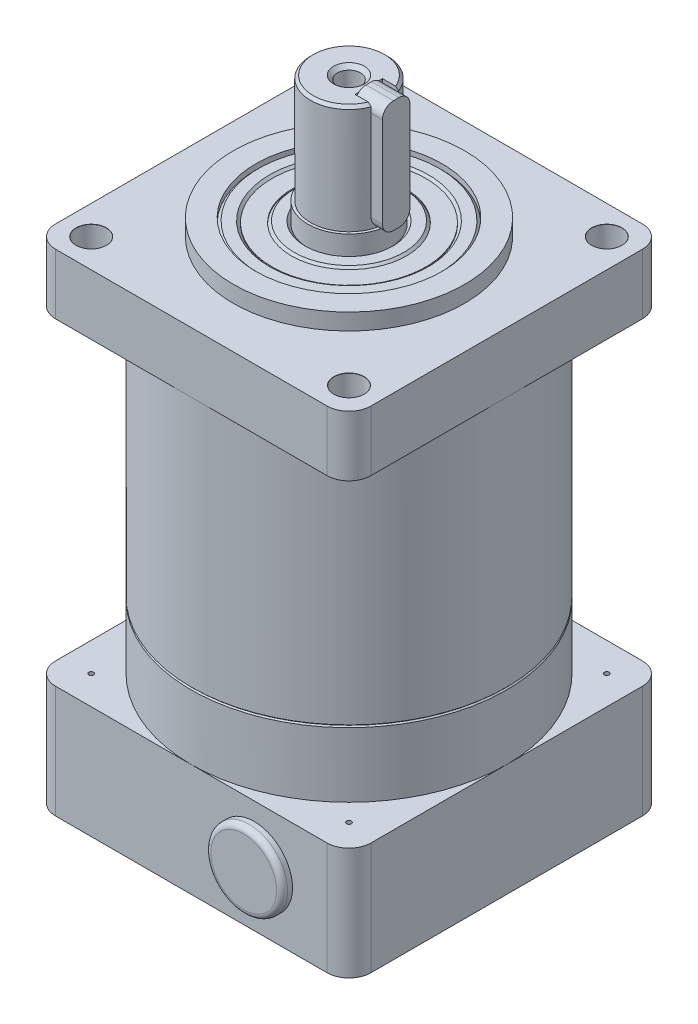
ISO-10303-21;
HEADER;
FILE_DESCRIPTION(('STEP AP214'),'2;1');
FILE_NAME('part.step','',(''),(''),'','','');
FILE_SCHEMA(('AUTOMOTIVE_DESIGN { 1 0 10303 214 1 1 1 1 }'));
ENDSEC;
DATA;
#1=APPLICATION_CONTEXT('core data for automotive mechanical design processes');
#2=APPLICATION_PROTOCOL_DEFINITION('international standard','automotive_design',2000,#1);
#3=PRODUCT_CONTEXT('',#1,'mechanical');
#4=PRODUCT('Part','Part','',(#3));
#5=PRODUCT_RELATED_PRODUCT_CATEGORY('part','',(#4));
#6=PRODUCT_DEFINITION_FORMATION('','',#4);
#7=PRODUCT_DEFINITION_CONTEXT('part definition',#1,'design');
#8=PRODUCT_DEFINITION('design','',#6,#7);
#9=PRODUCT_DEFINITION_SHAPE('','',#8);
#10=(LENGTH_UNIT() NAMED_UNIT(*) SI_UNIT(.MILLI.,.METRE.));
#11=(NAMED_UNIT(*) PLANE_ANGLE_UNIT() SI_UNIT($,.RADIAN.));
#12=(NAMED_UNIT(*) SI_UNIT($,.STERADIAN.) SOLID_ANGLE_UNIT());
#13=UNCERTAINTY_MEASURE_WITH_UNIT(LENGTH_MEASURE(1.E-05),#10,'distance_accuracy_value','');
#14=(GEOMETRIC_REPRESENTATION_CONTEXT(3) GLOBAL_UNCERTAINTY_ASSIGNED_CONTEXT((#13)) GLOBAL_UNIT_ASSIGNED_CONTEXT((#10,
#11,#12)) REPRESENTATION_CONTEXT('',''));
#15=CARTESIAN_POINT('',(0.,0.,0.));
#16=DIRECTION('',(0.,0.,1.));
#17=DIRECTION('',(1.,0.,0.));
#18=AXIS2_PLACEMENT_3D('',#15,#16,#17);
#19=CARTESIAN_POINT('',(0.,0.,0.));
#20=DIRECTION('',(0.,1.,0.));
#21=DIRECTION('',(0.,0.,1.));
#22=AXIS2_PLACEMENT_3D('',#19,#20,#21);
#23=PLANE('',#22);
#24=CARTESIAN_POINT('',(0.,0.,0.));
#25=DIRECTION('',(0.,-1.,0.));
#26=DIRECTION('',(0.,0.,-1.));
#27=AXIS2_PLACEMENT_3D('',#24,#25,#26);
#28=CIRCLE('',#27,19.);
#29=CARTESIAN_POINT('',(0.,0.,-19.));
#30=VERTEX_POINT('',#29);
#31=EDGE_CURVE('E2382',#30,#30,#28,.T.);
#32=ORIENTED_EDGE('',*,*,#31,.F.);
#33=EDGE_LOOP('',(#32));
#34=FACE_BOUND('',#33,.T.);
#35=DIRECTION('',(0.,0.,-1.));
#36=VECTOR('',#35,1.);
#37=CARTESIAN_POINT('',(28.75,0.,-28.75));
#38=LINE('',#37,#36);
#39=CARTESIAN_POINT('',(28.75,0.,24.75));
#40=VERTEX_POINT('',#39);
#41=CARTESIAN_POINT('',(28.75,0.,-24.75));
#42=VERTEX_POINT('',#41);
#43=EDGE_CURVE('E2199',#40,#42,#38,.T.);
#44=ORIENTED_EDGE('',*,*,#43,.F.);
#45=CARTESIAN_POINT('',(24.75,0.,24.75));
#46=DIRECTION('',(0.,1.,0.));
#47=DIRECTION('',(0.,0.,1.));
#48=AXIS2_PLACEMENT_3D('',#45,#46,#47);
#49=CIRCLE('',#48,4.);
#50=CARTESIAN_POINT('',(24.75,0.,28.75));
#51=VERTEX_POINT('',#50);
#52=EDGE_CURVE('E2258',#40,#51,#49,.F.);
#53=ORIENTED_EDGE('',*,*,#52,.T.);
#54=DIRECTION('',(1.,0.,0.));
#55=VECTOR('',#54,1.);
#56=CARTESIAN_POINT('',(-28.75,0.,28.75));
#57=LINE('',#56,#55);
#58=CARTESIAN_POINT('',(-24.75,0.,28.75));
#59=VERTEX_POINT('',#58);
#60=EDGE_CURVE('E2226',#59,#51,#57,.T.);
#61=ORIENTED_EDGE('',*,*,#60,.F.);
#62=CARTESIAN_POINT('',(-24.75,0.,24.75));
#63=DIRECTION('',(0.,1.,0.));
#64=DIRECTION('',(0.,0.,1.));
#65=AXIS2_PLACEMENT_3D('',#62,#63,#64);
#66=CIRCLE('',#65,4.);
#67=CARTESIAN_POINT('',(-28.75,0.,24.75));
#68=VERTEX_POINT('',#67);
#69=EDGE_CURVE('E2254',#59,#68,#66,.F.);
#70=ORIENTED_EDGE('',*,*,#69,.T.);
#71=DIRECTION('',(0.,0.,1.));
#72=VECTOR('',#71,1.);
#73=CARTESIAN_POINT('',(-28.75,0.,-28.75));
#74=LINE('',#73,#72);
#75=CARTESIAN_POINT('',(-28.75,0.,-24.75));
#76=VERTEX_POINT('',#75);
#77=EDGE_CURVE('E2223',#76,#68,#74,.T.);
#78=ORIENTED_EDGE('',*,*,#77,.F.);
#79=CARTESIAN_POINT('',(-24.75,0.,-24.75));
#80=DIRECTION('',(0.,1.,0.));
#81=DIRECTION('',(0.,0.,1.));
#82=AXIS2_PLACEMENT_3D('',#79,#80,#81);
#83=CIRCLE('',#82,4.);
#84=CARTESIAN_POINT('',(-24.75,0.,-28.75));
#85=VERTEX_POINT('',#84);
#86=EDGE_CURVE('E2252',#76,#85,#83,.F.);
#87=ORIENTED_EDGE('',*,*,#86,.T.);
#88=DIRECTION('',(-1.,0.,0.));
#89=VECTOR('',#88,1.);
#90=CARTESIAN_POINT('',(-28.75,0.,-28.75));
#91=LINE('',#90,#89);
#92=CARTESIAN_POINT('',(24.75,0.,-28.75));
#93=VERTEX_POINT('',#92);
#94=EDGE_CURVE('E2220',#93,#85,#91,.T.);
#95=ORIENTED_EDGE('',*,*,#94,.F.);
#96=CARTESIAN_POINT('',(24.75,0.,-24.75));
#97=DIRECTION('',(0.,1.,0.));
#98=DIRECTION('',(0.,0.,1.));
#99=AXIS2_PLACEMENT_3D('',#96,#97,#98);
#100=CIRCLE('',#99,4.);
#101=EDGE_CURVE('E2256',#93,#42,#100,.F.);
#102=ORIENTED_EDGE('',*,*,#101,.T.);
#103=EDGE_LOOP('',(#44,#53,#61,#70,#78,#87,#95,#102));
#104=FACE_BOUND('',#103,.T.);
#105=CARTESIAN_POINT('',(-23.5,0.,-23.5));
#106=DIRECTION('',(0.,-1.,0.));
#107=DIRECTION('',(0.,0.,-1.));
#108=AXIS2_PLACEMENT_3D('',#105,#106,#107);
#109=CIRCLE('',#108,2.8);
#110=CARTESIAN_POINT('',(-23.5,0.,-26.3));
#111=VERTEX_POINT('',#110);
#112=EDGE_CURVE('E598',#111,#111,#109,.T.);
#113=ORIENTED_EDGE('',*,*,#112,.F.);
#114=EDGE_LOOP('',(#113));
#115=FACE_BOUND('',#114,.T.);
#116=CARTESIAN_POINT('',(23.5,0.,-23.5));
#117=DIRECTION('',(0.,-1.,0.));
#118=DIRECTION('',(0.,0.,-1.));
#119=AXIS2_PLACEMENT_3D('',#116,#117,#118);
#120=CIRCLE('',#119,2.8);
#121=CARTESIAN_POINT('',(23.5,0.,-26.3));
#122=VERTEX_POINT('',#121);
#123=EDGE_CURVE('E602',#122,#122,#120,.T.);
#124=ORIENTED_EDGE('',*,*,#123,.F.);
#125=EDGE_LOOP('',(#124));
#126=FACE_BOUND('',#125,.T.);
#127=CARTESIAN_POINT('',(23.5,0.,23.5));
#128=DIRECTION('',(0.,-1.,0.));
#129=DIRECTION('',(0.,0.,-1.));
#130=AXIS2_PLACEMENT_3D('',#127,#128,#129);
#131=CIRCLE('',#130,2.8);
#132=CARTESIAN_POINT('',(23.5,0.,20.7));
#133=VERTEX_POINT('',#132);
#134=EDGE_CURVE('E615',#133,#133,#131,.T.);
#135=ORIENTED_EDGE('',*,*,#134,.F.);
#136=EDGE_LOOP('',(#135));
#137=FACE_BOUND('',#136,.T.);
#138=CARTESIAN_POINT('',(-23.5,0.,23.5));
#139=DIRECTION('',(0.,-1.,0.));
#140=DIRECTION('',(0.,0.,-1.));
#141=AXIS2_PLACEMENT_3D('',#138,#139,#140);
#142=CIRCLE('',#141,2.8);
#143=CARTESIAN_POINT('',(-23.5,0.,20.7));
#144=VERTEX_POINT('',#143);
#145=EDGE_CURVE('E2124',#144,#144,#142,.T.);
#146=ORIENTED_EDGE('',*,*,#145,.F.);
#147=EDGE_LOOP('',(#146));
#148=FACE_BOUND('',#147,.T.);
#149=ADVANCED_FACE('F48',(#34,#104,#115,#126,#137,#148),#23,.F.);
#150=CARTESIAN_POINT('',(11.45,10.25,-28.751));
#151=DIRECTION('',(0.,0.,1.));
#152=DIRECTION('',(1.,0.,0.));
#153=AXIS2_PLACEMENT_3D('',#150,#151,#152);
#154=CYLINDRICAL_SURFACE('',#153,4.);
#155=CARTESIAN_POINT('',(15.45,10.25,11.0588200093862));
#156=CARTESIAN_POINT('',(15.4500000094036,10.1799846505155,11.0588200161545));
#157=CARTESIAN_POINT('',(15.4481567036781,10.1099679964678,11.0613968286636));
#158=CARTESIAN_POINT('',(15.4408345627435,9.97048635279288,11.0716151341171));
#159=CARTESIAN_POINT('',(15.4353543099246,9.90102158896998,11.0792586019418));
#160=CARTESIAN_POINT('',(15.4136019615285,9.69407053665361,11.1095244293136));
#161=CARTESIAN_POINT('',(15.3920185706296,9.55814520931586,11.1394816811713));
#162=CARTESIAN_POINT('',(15.329517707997,9.2611653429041,11.2253862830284));
#163=CARTESIAN_POINT('',(15.2851372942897,9.10221698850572,11.2859309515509));
#164=CARTESIAN_POINT('',(15.1807782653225,8.79837498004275,11.4259159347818));
#165=CARTESIAN_POINT('',(15.1207698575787,8.65350890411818,11.5053923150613));
#166=CARTESIAN_POINT('',(15.0042865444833,8.41139039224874,11.65668093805));
#167=CARTESIAN_POINT('',(14.9504416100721,8.31107371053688,11.7257287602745));
#168=CARTESIAN_POINT('',(14.8365192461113,8.11832803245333,11.8695454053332));
#169=CARTESIAN_POINT('',(14.7764386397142,8.02590310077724,11.9443171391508));
#170=CARTESIAN_POINT('',(14.6507062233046,7.84847478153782,12.0982107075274));
#171=CARTESIAN_POINT('',(14.5850448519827,7.76348465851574,12.1773399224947));
#172=CARTESIAN_POINT('',(14.4487943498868,7.60075671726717,12.3386993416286));
#173=CARTESIAN_POINT('',(14.3782054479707,7.52301856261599,12.4209294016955));
#174=CARTESIAN_POINT('',(14.2016580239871,7.34305769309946,12.6229037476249));
#175=CARTESIAN_POINT('',(14.0933725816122,7.24439444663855,12.7437979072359));
#176=CARTESIAN_POINT('',(13.8684845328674,7.06063964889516,12.9881772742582));
#177=CARTESIAN_POINT('',(13.7518787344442,6.97555334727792,13.1116634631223));
#178=CARTESIAN_POINT('',(13.5109418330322,6.81879256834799,13.3598044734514));
#179=CARTESIAN_POINT('',(13.3866054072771,6.74712747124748,13.4844600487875));
#180=CARTESIAN_POINT('',(13.1308764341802,6.61748009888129,13.733606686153));
#181=CARTESIAN_POINT('',(12.9994848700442,6.55949592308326,13.8580977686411));
#182=CARTESIAN_POINT('',(12.7287154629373,6.45710342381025,14.1072327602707));
#183=CARTESIAN_POINT('',(12.5892651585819,6.41285294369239,14.2318630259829));
#184=CARTESIAN_POINT('',(12.3044214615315,6.33955299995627,14.4788382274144));
#185=CARTESIAN_POINT('',(12.1590273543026,6.31050536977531,14.6011828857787));
#186=CARTESIAN_POINT('',(11.863440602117,6.26863193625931,14.8423398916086));
#187=CARTESIAN_POINT('',(11.7132568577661,6.25577765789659,14.9611580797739));
#188=CARTESIAN_POINT('',(11.4091361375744,6.24731410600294,15.1943545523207));
#189=CARTESIAN_POINT('',(11.2552005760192,6.25169843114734,15.3087344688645));
#190=CARTESIAN_POINT('',(10.8720990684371,6.28537640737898,15.5844739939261));
#191=CARTESIAN_POINT('',(10.6414483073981,6.32536959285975,15.7427616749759));
#192=CARTESIAN_POINT('',(10.2968727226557,6.41796488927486,15.9685157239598));
#193=CARTESIAN_POINT('',(10.1822036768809,6.45428454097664,16.0418468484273));
#194=CARTESIAN_POINT('',(9.95434741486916,6.53816258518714,16.1842188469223));
#195=CARTESIAN_POINT('',(9.84115947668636,6.58571526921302,16.2532618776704));
#196=CARTESIAN_POINT('',(9.61644068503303,6.6927970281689,16.3872313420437));
#197=CARTESIAN_POINT('',(9.5049336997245,6.7524293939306,16.4521154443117));
#198=CARTESIAN_POINT('',(9.28605061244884,6.88346177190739,16.576643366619));
#199=CARTESIAN_POINT('',(9.17867241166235,6.95485570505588,16.6362898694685));
#200=CARTESIAN_POINT('',(8.9695136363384,7.10928660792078,16.749984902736));
#201=CARTESIAN_POINT('',(8.86773119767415,7.19231966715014,16.804035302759));
#202=CARTESIAN_POINT('',(8.67129164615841,7.36967360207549,16.9062402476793));
#203=CARTESIAN_POINT('',(8.57663316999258,7.46399230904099,16.9543959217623));
#204=CARTESIAN_POINT('',(8.40875269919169,7.64919994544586,17.0382042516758));
#205=CARTESIAN_POINT('',(8.33439067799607,7.73869462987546,17.0746623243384));
#206=CARTESIAN_POINT('',(8.19302732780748,7.92496390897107,17.1429421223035));
#207=CARTESIAN_POINT('',(8.12602492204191,8.02173743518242,17.1747645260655));
#208=CARTESIAN_POINT('',(8.00030364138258,8.2218115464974,17.2336868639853));
#209=CARTESIAN_POINT('',(7.94158071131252,8.3251089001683,17.2607891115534));
#210=CARTESIAN_POINT('',(7.83319000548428,8.53743214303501,17.3102480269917));
#211=CARTESIAN_POINT('',(7.78352150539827,8.64645757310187,17.3326050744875));
#212=CARTESIAN_POINT('',(7.69865690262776,8.85753143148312,17.3704521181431));
#213=CARTESIAN_POINT('',(7.66248736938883,8.95910479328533,17.3864174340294));
#214=CARTESIAN_POINT('',(7.59834739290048,9.16536274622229,17.4145440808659));
#215=CARTESIAN_POINT('',(7.5703795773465,9.27004832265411,17.4267041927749));
#216=CARTESIAN_POINT('',(7.52299643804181,9.4816319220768,17.4472115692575));
#217=CARTESIAN_POINT('',(7.50357560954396,9.58852847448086,17.4555612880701));
#218=CARTESIAN_POINT('',(7.47347708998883,9.80381360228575,17.4684690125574));
#219=CARTESIAN_POINT('',(7.46280255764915,9.91220270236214,17.4730256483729));
#220=CARTESIAN_POINT('',(7.45059599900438,10.124959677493,17.4782338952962));
#221=CARTESIAN_POINT('',(7.44869476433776,10.229302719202,17.4790432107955));
#222=CARTESIAN_POINT('',(7.45305117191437,10.4378257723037,17.4771861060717));
#223=CARTESIAN_POINT('',(7.45931171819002,10.5420057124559,17.4745184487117));
#224=CARTESIAN_POINT('',(7.47992601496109,10.7493628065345,17.4657044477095));
#225=CARTESIAN_POINT('',(7.49427595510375,10.8525404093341,17.4595597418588));
#226=CARTESIAN_POINT('',(7.53092180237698,11.0572431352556,17.4437844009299));
#227=CARTESIAN_POINT('',(7.55322064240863,11.1587676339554,17.4341524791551));
#228=CARTESIAN_POINT('',(7.60535387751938,11.3587387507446,17.4114730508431));
#229=CARTESIAN_POINT('',(7.63513697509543,11.4572013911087,17.3984487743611));
#230=CARTESIAN_POINT('',(7.70201493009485,11.6511177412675,17.3689464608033));
#231=CARTESIAN_POINT('',(7.73911242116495,11.7465703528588,17.3524671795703));
#232=CARTESIAN_POINT('',(7.82021644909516,11.9337672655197,17.3160673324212));
#233=CARTESIAN_POINT('',(7.86422034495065,12.025512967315,17.2961480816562));
#234=CARTESIAN_POINT('',(7.95871704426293,12.2047932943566,17.2528700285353));
#235=CARTESIAN_POINT('',(8.00921226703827,12.2923263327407,17.2295099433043));
#236=CARTESIAN_POINT('',(8.11730252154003,12.4644215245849,17.1788541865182));
#237=CARTESIAN_POINT('',(8.17502410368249,12.5488830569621,17.1514863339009));
#238=CARTESIAN_POINT('',(8.29611377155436,12.7123911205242,17.0932448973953));
#239=CARTESIAN_POINT('',(8.35948389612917,12.7914356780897,17.0623700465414));
#240=CARTESIAN_POINT('',(8.5571151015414,13.0197733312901,16.9645898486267));
#241=CARTESIAN_POINT('',(8.69898926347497,13.1604155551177,16.8924863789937));
#242=CARTESIAN_POINT('',(9.00634476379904,13.4236279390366,16.7307383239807));
#243=CARTESIAN_POINT('',(9.17272188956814,13.5446581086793,16.6403139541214));
#244=CARTESIAN_POINT('',(9.51620175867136,13.7573148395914,16.4463016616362));
#245=CARTESIAN_POINT('',(9.69330844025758,13.8489305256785,16.3427088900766));
#246=CARTESIAN_POINT('',(10.0727824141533,14.0117137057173,16.1119082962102));
#247=CARTESIAN_POINT('',(10.2757761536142,14.0794961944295,15.9833557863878));
#248=CARTESIAN_POINT('',(10.6823822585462,14.1812544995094,15.7145242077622));
#249=CARTESIAN_POINT('',(10.8859948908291,14.2152127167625,15.5742390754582));
#250=CARTESIAN_POINT('',(11.3228287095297,14.2549443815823,15.2603163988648));
#251=CARTESIAN_POINT('',(11.5553546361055,14.2551038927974,15.0850078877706));
#252=CARTESIAN_POINT('',(12.0101184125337,14.2171696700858,14.7255352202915));
#253=CARTESIAN_POINT('',(12.2323491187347,14.1790497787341,14.5413650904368));
#254=CARTESIAN_POINT('',(12.7051426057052,14.0572605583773,14.1313475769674));
#255=CARTESIAN_POINT('',(12.9528407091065,13.9661907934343,13.9043448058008));
#256=CARTESIAN_POINT('',(13.3067913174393,13.795350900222,13.5630545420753));
#257=CARTESIAN_POINT('',(13.4219360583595,13.7326277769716,13.4490590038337));
#258=CARTESIAN_POINT('',(13.6459817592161,13.5958757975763,13.2216707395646));
#259=CARTESIAN_POINT('',(13.7548836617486,13.5218486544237,13.1082779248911));
#260=CARTESIAN_POINT('',(13.9541496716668,13.371383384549,12.8957556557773));
#261=CARTESIAN_POINT('',(14.0452259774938,13.2961372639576,12.7964472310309));
#262=CARTESIAN_POINT('',(14.2216733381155,13.1365174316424,12.6000565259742));
#263=CARTESIAN_POINT('',(14.3070435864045,13.0521424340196,12.5029745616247));
#264=CARTESIAN_POINT('',(14.4713916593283,12.8740900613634,12.3123768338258));
#265=CARTESIAN_POINT('',(14.5503803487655,12.7804291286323,12.2188551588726));
#266=CARTESIAN_POINT('',(14.7013599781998,12.5832520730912,12.0367769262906));
#267=CARTESIAN_POINT('',(14.7733547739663,12.4797414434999,11.9482176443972));
#268=CARTESIAN_POINT('',(14.9241103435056,12.2386998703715,11.7596101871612));
#269=CARTESIAN_POINT('',(15.0009737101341,12.0986498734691,11.6612120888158));
#270=CARTESIAN_POINT('',(15.1401957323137,11.8021537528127,11.4798748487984));
#271=CARTESIAN_POINT('',(15.2025720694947,11.6457279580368,11.3969168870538));
#272=CARTESIAN_POINT('',(15.2978200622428,11.3513395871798,11.2686165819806));
#273=CARTESIAN_POINT('',(15.3341347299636,11.2163674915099,11.2190352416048));
#274=CARTESIAN_POINT('',(15.3928858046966,10.9382473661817,11.1382948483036));
#275=CARTESIAN_POINT('',(15.4153604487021,10.7951230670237,11.1070850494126));
#276=CARTESIAN_POINT('',(15.4366024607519,10.5838238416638,11.0775182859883));
#277=CARTESIAN_POINT('',(15.4416141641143,10.5173732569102,11.0705274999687));
#278=CARTESIAN_POINT('',(15.4483132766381,10.3839489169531,11.0611778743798));
#279=CARTESIAN_POINT('',(15.4499999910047,10.3169750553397,11.0588200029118));
#280=CARTESIAN_POINT('',(15.45,10.25,11.0588200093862));
#281=B_SPLINE_CURVE_WITH_KNOTS('',3,(#155,#156,#157,#158,#159,#160,#161,#162,#163,#164,#165,
#166,#167,#168,#169,#170,#171,#172,#173,#174,#175,#176,#177,#178,#179,#180,#181,#182,#183,#184,
#185,#186,#187,#188,#189,#190,#191,#192,#193,#194,#195,#196,#197,#198,#199,#200,#201,#202,#203,
#204,#205,#206,#207,#208,#209,#210,#211,#212,#213,#214,#215,#216,#217,#218,#219,#220,#221,#222,
#223,#224,#225,#226,#227,#228,#229,#230,#231,#232,#233,#234,#235,#236,#237,#238,#239,#240,#241,
#242,#243,#244,#245,#246,#247,#248,#249,#250,#251,#252,#253,#254,#255,#256,#257,#258,#259,#260,
#261,#262,#263,#264,#265,#266,#267,#268,#269,#270,#271,#272,#273,#274,#275,#276,#277,#278,#279,
#280),.UNSPECIFIED.,.T.,.F.,(4,2,2,2,2,2,2,2,2,2,2,2,2,2,2,2,2,2,2,2,2,2,2,2,2,2,2,2,2,2,2,2,2,
2,2,2,2,2,2,2,2,2,2,2,2,2,2,2,2,2,2,2,2,2,2,2,2,2,2,2,2,2,4),(0.,0.209972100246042,
0.420026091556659,0.840482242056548,1.36499519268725,1.89051546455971,2.28946409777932,
2.68861698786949,3.08846807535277,3.48830060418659,4.05732839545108,4.62657567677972,
5.19621933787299,5.76578381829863,6.34167073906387,6.91762709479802,7.49256924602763,
8.06729792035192,8.91106155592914,9.33326908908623,9.75526252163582,10.1810294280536,
10.6065769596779,11.0319818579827,11.4573051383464,11.8226084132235,12.1878581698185,
12.5529284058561,12.9179694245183,13.2445519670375,13.5712390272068,13.8977153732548,
14.2243095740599,14.5370261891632,14.8498541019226,15.1625347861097,15.4753309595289,
15.7860390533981,16.0968592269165,16.4075608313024,16.7183785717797,17.0357061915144,
17.353148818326,17.9875087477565,18.6590055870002,19.330750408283,20.0768357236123,
20.8233090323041,21.6936876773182,22.564661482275,23.6045624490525,24.125434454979,
24.6462276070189,25.1088737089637,25.5715850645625,26.0334912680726,26.4951413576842,
27.0565053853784,27.6171806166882,28.0604782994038,28.5025456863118,28.7033581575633,
28.9042125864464),.UNSPECIFIED.);
#282=CARTESIAN_POINT('',(15.45,10.25,11.0588200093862));
#283=VERTEX_POINT('',#282);
#284=EDGE_CURVE('E833',#283,#283,#281,.T.);
#285=ORIENTED_EDGE('',*,*,#284,.T.);
#286=EDGE_LOOP('',(#285));
#287=FACE_BOUND('',#286,.T.);
#288=CARTESIAN_POINT('',(11.45,10.25,26.25));
#289=DIRECTION('',(0.,0.,1.));
#290=DIRECTION('',(1.,0.,0.));
#291=AXIS2_PLACEMENT_3D('',#288,#289,#290);
#292=CIRCLE('',#291,4.);
#293=CARTESIAN_POINT('',(15.45,10.25,26.25));
#294=VERTEX_POINT('',#293);
#295=EDGE_CURVE('E587',#294,#294,#292,.F.);
#296=ORIENTED_EDGE('',*,*,#295,.F.);
#297=EDGE_LOOP('',(#296));
#298=FACE_BOUND('',#297,.T.);
#299=ADVANCED_FACE('F460',(#287,#298),#154,.F.);
#300=CARTESIAN_POINT('',(28.751,97.,-2.5));
#301=DIRECTION('',(0.,0.,1.));
#302=DIRECTION('',(0.,-1.,0.));
#303=AXIS2_PLACEMENT_3D('',#300,#301,#302);
#304=PLANE('',#303);
#305=DIRECTION('',(0.,1.,0.));
#306=VECTOR('',#305,1.);
#307=CARTESIAN_POINT('',(3.6,97.,-2.5));
#308=LINE('',#307,#306);
#309=CARTESIAN_POINT('',(3.6,113.5,-2.50000000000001));
#310=VERTEX_POINT('',#309);
#311=CARTESIAN_POINT('',(3.6,115.,-2.5));
#312=VERTEX_POINT('',#311);
#313=EDGE_CURVE('E2780',#310,#312,#308,.T.);
#314=ORIENTED_EDGE('',*,*,#313,.F.);
#315=DIRECTION('',(-1.,0.,0.));
#316=VECTOR('',#315,1.);
#317=CARTESIAN_POINT('',(8.6,113.5,-2.50000000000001));
#318=LINE('',#317,#316);
#319=CARTESIAN_POINT('',(6.53834841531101,113.5,-2.50000000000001));
#320=VERTEX_POINT('',#319);
#321=EDGE_CURVE('E680',#320,#310,#318,.T.);
#322=ORIENTED_EDGE('',*,*,#321,.F.);
#323=DIRECTION('',(0.,-1.,0.));
#324=VECTOR('',#323,1.);
#325=CARTESIAN_POINT('',(6.53834841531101,115.,-2.5));
#326=LINE('',#325,#324);
#327=CARTESIAN_POINT('',(6.53834841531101,114.5,-2.5));
#328=VERTEX_POINT('',#327);
#329=EDGE_CURVE('E74',#328,#320,#326,.T.);
#330=ORIENTED_EDGE('',*,*,#329,.F.);
#331=CARTESIAN_POINT('',(10.5348078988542,110.672619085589,-2.5));
#332=CARTESIAN_POINT('',(10.3464345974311,110.85589954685,-2.5));
#333=CARTESIAN_POINT('',(10.1579331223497,111.03904836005,-2.5));
#334=CARTESIAN_POINT('',(9.78062182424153,111.405028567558,-2.5));
#335=CARTESIAN_POINT('',(9.59181200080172,111.587859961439,-2.5));
#336=CARTESIAN_POINT('',(9.02492388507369,112.135717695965,-2.5));
#337=CARTESIAN_POINT('',(8.6463061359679,112.500186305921,-2.5));
#338=CARTESIAN_POINT('',(7.88760789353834,113.226414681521,-2.5));
#339=CARTESIAN_POINT('',(7.50753060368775,113.588177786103,-2.5));
#340=CARTESIAN_POINT('',(6.93502815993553,114.128386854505,-2.5));
#341=CARTESIAN_POINT('',(6.74377292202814,114.308072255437,-2.5));
#342=CARTESIAN_POINT('',(6.36027073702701,114.666381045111,-2.5));
#343=CARTESIAN_POINT('',(6.16802379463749,114.845004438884,-2.5));
#344=CARTESIAN_POINT('',(5.81555234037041,115.170160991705,-2.5));
#345=CARTESIAN_POINT('',(5.65552828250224,115.316911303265,-2.5));
#346=CARTESIAN_POINT('',(5.3343968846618,115.609213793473,-2.5));
#347=CARTESIAN_POINT('',(5.17328957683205,115.754766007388,-2.5));
#348=CARTESIAN_POINT('',(4.84978676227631,116.044249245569,-2.5));
#349=CARTESIAN_POINT('',(4.68739203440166,116.188181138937,-2.5));
#350=CARTESIAN_POINT('',(4.36080389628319,116.474031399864,-2.5));
#351=CARTESIAN_POINT('',(4.19661029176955,116.615949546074,-2.5));
#352=CARTESIAN_POINT('',(3.86554197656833,116.897307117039,-2.5));
#353=CARTESIAN_POINT('',(3.69866256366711,117.03674102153,-2.5));
#354=CARTESIAN_POINT('',(3.36176456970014,117.3116908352,-2.5));
#355=CARTESIAN_POINT('',(3.19174695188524,117.447207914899,-2.5));
#356=CARTESIAN_POINT('',(2.9332378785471,117.646315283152,-2.5));
#357=CARTESIAN_POINT('',(2.84640104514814,117.71205198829,-2.5));
#358=CARTESIAN_POINT('',(2.67140576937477,117.841728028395,-2.5));
#359=CARTESIAN_POINT('',(2.5832474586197,117.905667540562,-2.5));
#360=CARTESIAN_POINT('',(2.40525942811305,118.031386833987,-2.5));
#361=CARTESIAN_POINT('',(2.31542809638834,118.093164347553,-2.5));
#362=CARTESIAN_POINT('',(2.13382708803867,118.213863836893,-2.5));
#363=CARTESIAN_POINT('',(2.04205675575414,118.272784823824,-2.5));
#364=CARTESIAN_POINT('',(1.94917044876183,118.329942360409,-2.5));
#365=B_SPLINE_CURVE_WITH_KNOTS('',3,(#331,#332,#333,#334,#335,#336,#337,#338,#339,#340,#341,
#342,#343,#344,#345,#346,#347,#348,#349,#350,#351,#352,#353,#354,#355,#356,#357,#358,#359,#360,
#361,#362,#363,#364),.UNSPECIFIED.,.F.,.F.,(4,2,2,2,2,2,2,2,2,2,2,2,2,2,2,2,4),(0.,
0.788470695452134,1.57694244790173,3.15354751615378,4.72769296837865,5.51495666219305,
6.30221662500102,6.95358765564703,7.6049394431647,8.25592339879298,8.90697836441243,
9.55933440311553,10.2114934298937,10.5382131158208,10.8649004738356,11.1919208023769,
11.51905353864),.UNSPECIFIED.);
#366=CARTESIAN_POINT('',(6.00000000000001,115.,-2.5));
#367=VERTEX_POINT('',#366);
#368=EDGE_CURVE('E724',#328,#367,#365,.T.);
#369=ORIENTED_EDGE('',*,*,#368,.T.);
#370=DIRECTION('',(-1.,0.,0.));
#371=VECTOR('',#370,1.);
#372=CARTESIAN_POINT('',(28.751,115.,-2.5));
#373=LINE('',#372,#371);
#374=EDGE_CURVE('E2781',#367,#312,#373,.T.);
#375=ORIENTED_EDGE('',*,*,#374,.T.);
#376=EDGE_LOOP('',(#314,#322,#330,#369,#375));
#377=FACE_BOUND('',#376,.T.);
#378=ADVANCED_FACE('F466',(#377),#304,.T.);
#379=CARTESIAN_POINT('',(3.6,97.,0.499999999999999));
#380=DIRECTION('',(1.,0.,0.));
#381=DIRECTION('',(0.,0.,-1.));
#382=AXIS2_PLACEMENT_3D('',#379,#380,#381);
#383=PLANE('',#382);
#384=DIRECTION('',(0.,0.,1.));
#385=VECTOR('',#384,1.);
#386=CARTESIAN_POINT('',(3.6,115.,-2.5));
#387=LINE('',#386,#385);
#388=CARTESIAN_POINT('',(3.6,115.,-1.82287565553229));
#389=VERTEX_POINT('',#388);
#390=EDGE_CURVE('E2773',#312,#389,#387,.T.);
#391=ORIENTED_EDGE('',*,*,#390,.T.);
#392=CARTESIAN_POINT('',(3.6,113.5,-0.500000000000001));
#393=DIRECTION('',(1.,0.,0.));
#394=DIRECTION('',(0.,0.,1.));
#395=AXIS2_PLACEMENT_3D('',#392,#393,#394);
#396=CIRCLE('',#395,2.00000000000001);
#397=EDGE_CURVE('E663',#310,#389,#396,.T.);
#398=ORIENTED_EDGE('',*,*,#397,.F.);
#399=ORIENTED_EDGE('',*,*,#313,.T.);
#400=EDGE_LOOP('',(#391,#398,#399));
#401=FACE_BOUND('',#400,.T.);
#402=ADVANCED_FACE('F720',(#401),#383,.T.);
#403=DIRECTION('',(0.,-1.,0.));
#404=VECTOR('',#403,1.);
#405=CARTESIAN_POINT('',(3.6,115.,2.5));
#406=LINE('',#405,#404);
#407=CARTESIAN_POINT('',(3.6,115.,2.5));
#408=VERTEX_POINT('',#407);
#409=CARTESIAN_POINT('',(3.6,113.5,2.5));
#410=VERTEX_POINT('',#409);
#411=EDGE_CURVE('E2776',#408,#410,#406,.T.);
#412=ORIENTED_EDGE('',*,*,#411,.T.);
#413=CARTESIAN_POINT('',(3.6,113.5,0.499999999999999));
#414=DIRECTION('',(1.,0.,0.));
#415=DIRECTION('',(0.,0.,-1.));
#416=AXIS2_PLACEMENT_3D('',#413,#414,#415);
#417=CIRCLE('',#416,2.);
#418=CARTESIAN_POINT('',(3.6,115.,1.82287565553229));
#419=VERTEX_POINT('',#418);
#420=EDGE_CURVE('E584',#410,#419,#417,.F.);
#421=ORIENTED_EDGE('',*,*,#420,.T.);
#422=EDGE_CURVE('E2772',#419,#408,#387,.T.);
#423=ORIENTED_EDGE('',*,*,#422,.T.);
#424=EDGE_LOOP('',(#412,#421,#423));
#425=FACE_BOUND('',#424,.T.);
#426=ADVANCED_FACE('F994',(#425),#383,.T.);
#427=CARTESIAN_POINT('',(0.,115.,0.));
#428=DIRECTION('',(0.,1.,0.));
#429=DIRECTION('',(0.,0.,1.));
#430=AXIS2_PLACEMENT_3D('',#427,#428,#429);
#431=PLANE('',#430);
#432=CARTESIAN_POINT('',(0.,115.,0.));
#433=DIRECTION('',(0.,1.,0.));
#434=DIRECTION('',(0.,0.,1.));
#435=AXIS2_PLACEMENT_3D('',#432,#433,#434);
#436=CIRCLE('',#435,2.8);
#437=CARTESIAN_POINT('',(0.,115.,2.8));
#438=VERTEX_POINT('',#437);
#439=EDGE_CURVE('E748',#438,#438,#436,.T.);
#440=ORIENTED_EDGE('',*,*,#439,.F.);
#441=EDGE_LOOP('',(#440));
#442=FACE_BOUND('',#441,.T.);
#443=CARTESIAN_POINT('',(0.,115.,0.));
#444=DIRECTION('',(0.,1.,0.));
#445=DIRECTION('',(0.,0.,1.));
#446=AXIS2_PLACEMENT_3D('',#443,#444,#445);
#447=CIRCLE('',#446,6.50000000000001);
#448=CARTESIAN_POINT('',(6.00000000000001,115.,2.5));
#449=VERTEX_POINT('',#448);
#450=EDGE_CURVE('E572',#367,#449,#447,.T.);
#451=ORIENTED_EDGE('',*,*,#450,.T.);
#452=DIRECTION('',(-1.,0.,0.));
#453=VECTOR('',#452,1.);
#454=CARTESIAN_POINT('',(28.751,115.,2.5));
#455=LINE('',#454,#453);
#456=EDGE_CURVE('E731',#449,#408,#455,.T.);
#457=ORIENTED_EDGE('',*,*,#456,.T.);
#458=ORIENTED_EDGE('',*,*,#422,.F.);
#459=EDGE_CURVE('E2777',#389,#419,#387,.T.);
#460=ORIENTED_EDGE('',*,*,#459,.F.);
#461=ORIENTED_EDGE('',*,*,#390,.F.);
#462=ORIENTED_EDGE('',*,*,#374,.F.);
#463=EDGE_LOOP('',(#451,#457,#458,#460,#461,#462));
#464=FACE_BOUND('',#463,.T.);
#465=ADVANCED_FACE('F990',(#442,#464),#431,.T.);
#466=CARTESIAN_POINT('',(0.,115.,0.));
#467=DIRECTION('',(0.,-1.,0.));
#468=DIRECTION('',(0.,0.,-1.));
#469=AXIS2_PLACEMENT_3D('',#466,#467,#468);
#470=CYLINDRICAL_SURFACE('',#469,7.);
#471=DIRECTION('',(0.,-1.,0.));
#472=VECTOR('',#471,1.);
#473=CARTESIAN_POINT('',(6.53834841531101,115.,2.5));
#474=LINE('',#473,#472);
#475=CARTESIAN_POINT('',(6.53834841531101,97.,2.5));
#476=VERTEX_POINT('',#475);
#477=CARTESIAN_POINT('',(6.53834841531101,113.5,2.5));
#478=VERTEX_POINT('',#477);
#479=EDGE_CURVE('E2757',#476,#478,#474,.F.);
#480=ORIENTED_EDGE('',*,*,#479,.T.);
#481=CARTESIAN_POINT('',(6.53834841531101,114.5,2.5));
#482=VERTEX_POINT('',#481);
#483=EDGE_CURVE('E2756',#478,#482,#474,.F.);
#484=ORIENTED_EDGE('',*,*,#483,.T.);
#485=CARTESIAN_POINT('',(0.,114.5,0.));
#486=DIRECTION('',(0.,1.,0.));
#487=DIRECTION('',(0.,0.,1.));
#488=AXIS2_PLACEMENT_3D('',#485,#486,#487);
#489=CIRCLE('',#488,7.);
#490=EDGE_CURVE('E581',#482,#328,#489,.F.);
#491=ORIENTED_EDGE('',*,*,#490,.T.);
#492=ORIENTED_EDGE('',*,*,#329,.T.);
#493=DIRECTION('',(0.,-1.,0.));
#494=VECTOR('',#493,1.);
#495=CARTESIAN_POINT('',(6.53834841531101,115.,-2.5));
#496=LINE('',#495,#494);
#497=CARTESIAN_POINT('',(6.53834841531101,97.,-2.5));
#498=VERTEX_POINT('',#497);
#499=EDGE_CURVE('E693',#498,#320,#496,.F.);
#500=ORIENTED_EDGE('',*,*,#499,.F.);
#501=CARTESIAN_POINT('',(6.53834841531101,97.,-2.5));
#502=CARTESIAN_POINT('',(6.538340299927,96.9458167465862,-2.50000742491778));
#503=CARTESIAN_POINT('',(6.53919012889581,96.8916384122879,-2.49779830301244));
#504=CARTESIAN_POINT('',(6.54254509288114,96.7837043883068,-2.48900464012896));
#505=CARTESIAN_POINT('',(6.54504976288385,96.729948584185,-2.48242132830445));
#506=CARTESIAN_POINT('',(6.55164270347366,96.6234222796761,-2.46496651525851));
#507=CARTESIAN_POINT('',(6.55572558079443,96.5706490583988,-2.45410961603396));
#508=CARTESIAN_POINT('',(6.5653577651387,96.4662863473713,-2.42822300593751));
#509=CARTESIAN_POINT('',(6.57090712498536,96.414696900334,-2.41319314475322));
#510=CARTESIAN_POINT('',(6.58953838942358,96.2623063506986,-2.36205741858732));
#511=CARTESIAN_POINT('',(6.6046148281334,96.1637109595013,-2.31987683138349));
#512=CARTESIAN_POINT('',(6.63862200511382,95.9749883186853,-2.22068240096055));
#513=CARTESIAN_POINT('',(6.65755661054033,95.8848696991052,-2.16365365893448));
#514=CARTESIAN_POINT('',(6.69838778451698,95.7117572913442,-2.03381652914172));
#515=CARTESIAN_POINT('',(6.72037168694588,95.6291843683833,-1.96047475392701));
#516=CARTESIAN_POINT('',(6.76475722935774,95.4773153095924,-1.80134637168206));
#517=CARTESIAN_POINT('',(6.78715837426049,95.4080044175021,-1.71557378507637));
#518=CARTESIAN_POINT('',(6.81846215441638,95.3187880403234,-1.58439206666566));
#519=CARTESIAN_POINT('',(6.82793482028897,95.2928642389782,-1.54310511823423));
#520=CARTESIAN_POINT('',(6.84645224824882,95.2441062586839,-1.45875069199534));
#521=CARTESIAN_POINT('',(6.85549770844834,95.221266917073,-1.41568635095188));
#522=CARTESIAN_POINT('',(6.86427128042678,95.2,-1.37177978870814));
#523=B_SPLINE_CURVE_WITH_KNOTS('',3,(#501,#502,#503,#504,#505,#506,#507,#508,#509,#510,#511,
#512,#513,#514,#515,#516,#517,#518,#519,#520,#521,#522),.UNSPECIFIED.,.F.,.F.,(4,2,2,2,2,2,2,2,
2,2,4),(0.,0.162489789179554,0.32493393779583,0.486827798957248,0.648727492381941,
0.972009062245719,1.29561627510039,1.63197930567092,1.96796587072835,2.11684586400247,
2.26547349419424),.UNSPECIFIED.);
#524=CARTESIAN_POINT('',(6.86427128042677,95.2,-1.37177978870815));
#525=VERTEX_POINT('',#524);
#526=EDGE_CURVE('E704',#498,#525,#523,.T.);
#527=ORIENTED_EDGE('',*,*,#526,.T.);
#528=CARTESIAN_POINT('',(0.,95.2,0.));
#529=DIRECTION('',(0.,1.,0.));
#530=DIRECTION('',(0.,0.,1.));
#531=AXIS2_PLACEMENT_3D('',#528,#529,#530);
#532=CIRCLE('',#531,7.);
#533=CARTESIAN_POINT('',(6.86427128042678,95.2,1.37177978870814));
#534=VERTEX_POINT('',#533);
#535=EDGE_CURVE('E769',#525,#534,#532,.T.);
#536=ORIENTED_EDGE('',*,*,#535,.T.);
#537=CARTESIAN_POINT('',(6.86427128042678,95.2,1.37177978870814));
#538=CARTESIAN_POINT('',(6.85396503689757,95.2249848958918,1.4233628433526));
#539=CARTESIAN_POINT('',(6.84328149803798,95.2521412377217,1.47378303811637));
#540=CARTESIAN_POINT('',(6.82138327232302,95.3106104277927,1.57202337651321));
#541=CARTESIAN_POINT('',(6.81016865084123,95.3419227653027,1.61984383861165));
#542=CARTESIAN_POINT('',(6.77607402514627,95.441781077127,1.75895264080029));
#543=CARTESIAN_POINT('',(6.75272930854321,95.5162812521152,1.84595602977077));
#544=CARTESIAN_POINT('',(6.70690394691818,95.6791112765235,2.00609181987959));
#545=CARTESIAN_POINT('',(6.68442341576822,95.7674429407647,2.0792223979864));
#546=CARTESIAN_POINT('',(6.64246018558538,95.9558242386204,2.20962050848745));
#547=CARTESIAN_POINT('',(6.62297754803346,96.0558741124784,2.26688771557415));
#548=CARTESIAN_POINT('',(6.58928102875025,96.263759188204,2.36303920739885));
#549=CARTESIAN_POINT('',(6.5750059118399,96.371484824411,2.40213873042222));
#550=CARTESIAN_POINT('',(6.55306161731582,96.5925611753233,2.46138291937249));
#551=CARTESIAN_POINT('',(6.54537813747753,96.7058991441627,2.48156863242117));
#552=CARTESIAN_POINT('',(6.5404124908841,96.849991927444,2.4945948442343));
#553=CARTESIAN_POINT('',(6.53963880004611,96.8799747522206,2.49662238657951));
#554=CARTESIAN_POINT('',(6.538607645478,96.9399675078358,2.49932296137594));
#555=CARTESIAN_POINT('',(6.53834944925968,96.9699773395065,2.49999791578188));
#556=CARTESIAN_POINT('',(6.53834841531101,97.,2.5));
#557=B_SPLINE_CURVE_WITH_KNOTS('',3,(#537,#538,#539,#540,#541,#542,#543,#544,#545,#546,#547,
#548,#549,#550,#551,#552,#553,#554,#555,#556),.UNSPECIFIED.,.F.,.F.,(4,2,2,2,2,2,2,2,2,4),(0.,
0.174589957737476,0.349158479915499,0.698068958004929,1.04702525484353,1.3959887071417,
1.74070527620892,2.08467198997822,2.1748338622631,2.26486752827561),.UNSPECIFIED.);
#558=EDGE_CURVE('E2749',#534,#476,#557,.T.);
#559=ORIENTED_EDGE('',*,*,#558,.T.);
#560=EDGE_LOOP('',(#480,#484,#491,#492,#500,#527,#536,#559));
#561=FACE_BOUND('',#560,.T.);
#562=ADVANCED_FACE('F993',(#561),#470,.T.);
#563=CARTESIAN_POINT('',(0.,95.2,0.));
#564=DIRECTION('',(0.,1.,0.));
#565=DIRECTION('',(0.,0.,1.));
#566=AXIS2_PLACEMENT_3D('',#563,#564,#565);
#567=PLANE('',#566);
#568=CARTESIAN_POINT('',(0.,95.2,0.));
#569=DIRECTION('',(0.,1.,0.));
#570=DIRECTION('',(0.,0.,1.));
#571=AXIS2_PLACEMENT_3D('',#568,#569,#570);
#572=CIRCLE('',#571,7.5);
#573=CARTESIAN_POINT('',(7.37348087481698,95.2,-1.37177978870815));
#574=VERTEX_POINT('',#573);
#575=CARTESIAN_POINT('',(7.37348087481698,95.2,1.37177978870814));
#576=VERTEX_POINT('',#575);
#577=EDGE_CURVE('E772',#574,#576,#572,.T.);
#578=ORIENTED_EDGE('',*,*,#577,.T.);
#579=DIRECTION('',(-1.,0.,0.));
#580=VECTOR('',#579,1.);
#581=CARTESIAN_POINT('',(28.751,95.2,1.37177978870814));
#582=LINE('',#581,#580);
#583=EDGE_CURVE('E2770',#534,#576,#582,.F.);
#584=ORIENTED_EDGE('',*,*,#583,.F.);
#585=ORIENTED_EDGE('',*,*,#535,.F.);
#586=DIRECTION('',(-1.,0.,0.));
#587=VECTOR('',#586,1.);
#588=CARTESIAN_POINT('',(28.751,95.2,-1.37177978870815));
#589=LINE('',#588,#587);
#590=EDGE_CURVE('E746',#574,#525,#589,.T.);
#591=ORIENTED_EDGE('',*,*,#590,.F.);
#592=EDGE_LOOP('',(#578,#584,#585,#591));
#593=FACE_BOUND('',#592,.T.);
#594=ADVANCED_FACE('F998',(#593),#567,.T.);
#595=CARTESIAN_POINT('',(0.,95.2,0.));
#596=DIRECTION('',(0.,-1.,0.));
#597=DIRECTION('',(0.,0.,-1.));
#598=AXIS2_PLACEMENT_3D('',#595,#596,#597);
#599=CYLINDRICAL_SURFACE('',#598,7.5);
#600=CARTESIAN_POINT('',(0.,91.5,0.));
#601=DIRECTION('',(0.,1.,0.));
#602=DIRECTION('',(0.,0.,1.));
#603=AXIS2_PLACEMENT_3D('',#600,#601,#602);
#604=CIRCLE('',#603,7.5);
#605=CARTESIAN_POINT('',(0.,91.5,7.5));
#606=VERTEX_POINT('',#605);
#607=EDGE_CURVE('E566',#606,#606,#604,.T.);
#608=ORIENTED_EDGE('',*,*,#607,.T.);
#609=EDGE_LOOP('',(#608));
#610=FACE_BOUND('',#609,.T.);
#611=CARTESIAN_POINT('',(7.48331477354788,95.,0.499999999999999));
#612=CARTESIAN_POINT('',(7.47957084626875,94.9999927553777,0.55612931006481));
#613=CARTESIAN_POINT('',(7.47518320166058,95.0023624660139,0.612212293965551));
#614=CARTESIAN_POINT('',(7.46519268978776,95.011783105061,0.723889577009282));
#615=CARTESIAN_POINT('',(7.45958951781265,95.0188352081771,0.7794837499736));
#616=CARTESIAN_POINT('',(7.4473577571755,95.0373726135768,0.88872599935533));
#617=CARTESIAN_POINT('',(7.44075034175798,95.0487724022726,0.942391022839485));
#618=CARTESIAN_POINT('',(7.42654671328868,95.0758929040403,1.04845761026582));
#619=CARTESIAN_POINT('',(7.41895100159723,95.0916114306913,1.100859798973));
#620=CARTESIAN_POINT('',(7.40511943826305,95.1223071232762,1.18980458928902));
#621=CARTESIAN_POINT('',(7.39908814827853,95.1362879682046,1.22672677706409));
#622=CARTESIAN_POINT('',(7.38658998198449,95.1664855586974,1.29987614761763));
#623=CARTESIAN_POINT('',(7.38012038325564,95.1827170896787,1.33609676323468));
#624=CARTESIAN_POINT('',(7.37348087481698,95.2,1.37177978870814));
#625=B_SPLINE_CURVE_WITH_KNOTS('',3,(#611,#612,#613,#614,#615,#616,#617,#618,#619,#620,#621,
#622,#623,#624),.UNSPECIFIED.,.F.,.F.,(4,2,2,2,2,2,4),(0.,0.168704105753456,0.33745055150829,
0.503036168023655,0.668538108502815,0.788287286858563,0.908864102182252),.UNSPECIFIED.);
#626=CARTESIAN_POINT('',(7.48331477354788,95.,0.499999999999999));
#627=VERTEX_POINT('',#626);
#628=EDGE_CURVE('E2763',#627,#576,#625,.T.);
#629=ORIENTED_EDGE('',*,*,#628,.T.);
#630=ORIENTED_EDGE('',*,*,#577,.F.);
#631=CARTESIAN_POINT('',(7.37348087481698,95.2,-1.37177978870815));
#632=CARTESIAN_POINT('',(7.38277353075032,95.175814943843,-1.32185643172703));
#633=CARTESIAN_POINT('',(7.39173047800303,95.1536901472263,-1.27086755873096));
#634=CARTESIAN_POINT('',(7.40882525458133,95.113706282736,-1.16707214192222));
#635=CARTESIAN_POINT('',(7.41696254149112,95.0958500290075,-1.11426442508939));
#636=CARTESIAN_POINT('',(7.43211160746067,95.0648792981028,-1.00823358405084));
#637=CARTESIAN_POINT('',(7.43914191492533,95.0516807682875,-0.955037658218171));
#638=CARTESIAN_POINT('',(7.45214174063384,95.0296845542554,-0.847646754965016));
#639=CARTESIAN_POINT('',(7.45811193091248,95.0208840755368,-0.793452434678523));
#640=CARTESIAN_POINT('',(7.46741430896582,95.00957794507,-0.69949616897));
#641=CARTESIAN_POINT('',(7.47101949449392,95.0060046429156,-0.659886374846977));
#642=CARTESIAN_POINT('',(7.47763263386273,95.0012066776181,-0.58019414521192));
#643=CARTESIAN_POINT('',(7.48063621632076,94.9999986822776,-0.540110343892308));
#644=CARTESIAN_POINT('',(7.48331477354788,95.,-0.500000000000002));
#645=B_SPLINE_CURVE_WITH_KNOTS('',3,(#631,#632,#633,#634,#635,#636,#637,#638,#639,#640,#641,
#642,#643,#644),.UNSPECIFIED.,.F.,.F.,(4,2,2,2,2,2,4),(0.,0.16869691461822,0.337504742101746,
0.503088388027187,0.668566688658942,0.78829636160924,0.908866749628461),.UNSPECIFIED.);
#646=CARTESIAN_POINT('',(7.48331477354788,95.,-0.500000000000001));
#647=VERTEX_POINT('',#646);
#648=EDGE_CURVE('E739',#574,#647,#645,.T.);
#649=ORIENTED_EDGE('',*,*,#648,.T.);
#650=CARTESIAN_POINT('',(0.,95.,0.));
#651=DIRECTION('',(0.,1.,0.));
#652=DIRECTION('',(0.,0.,1.));
#653=AXIS2_PLACEMENT_3D('',#650,#651,#652);
#654=CIRCLE('',#653,7.5);
#655=EDGE_CURVE('E2760',#647,#627,#654,.F.);
#656=ORIENTED_EDGE('',*,*,#655,.T.);
#657=EDGE_LOOP('',(#629,#630,#649,#656));
#658=FACE_BOUND('',#657,.T.);
#659=ADVANCED_FACE('F939',(#610,#658),#599,.T.);
#660=CARTESIAN_POINT('',(0.,115.,0.));
#661=DIRECTION('',(0.,-1.,0.));
#662=DIRECTION('',(0.,0.,-1.));
#663=AXIS2_PLACEMENT_3D('',#660,#661,#662);
#664=CONICAL_SURFACE('',#663,6.50000000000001,0.785398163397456);
#665=ORIENTED_EDGE('',*,*,#490,.F.);
#666=CARTESIAN_POINT('',(1.94917043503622,118.329942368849,2.5));
#667=CARTESIAN_POINT('',(2.01578897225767,118.288970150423,2.5));
#668=CARTESIAN_POINT('',(2.08182663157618,118.247071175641,2.5));
#669=CARTESIAN_POINT('',(2.21286048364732,118.161696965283,2.5));
#670=CARTESIAN_POINT('',(2.27785685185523,118.118221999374,2.5));
#671=CARTESIAN_POINT('',(2.47141458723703,117.985884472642,2.5));
#672=CARTESIAN_POINT('',(2.59863041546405,117.895055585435,2.5));
#673=CARTESIAN_POINT('',(2.85008980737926,117.709773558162,2.5));
#674=CARTESIAN_POINT('',(2.97433735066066,117.615325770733,2.5));
#675=CARTESIAN_POINT('',(3.22068205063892,117.423627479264,2.5));
#676=CARTESIAN_POINT('',(3.34277879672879,117.326376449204,2.5));
#677=CARTESIAN_POINT('',(3.58499897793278,117.129964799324,2.5));
#678=CARTESIAN_POINT('',(3.70512599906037,117.030808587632,2.5));
#679=CARTESIAN_POINT('',(3.94399570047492,116.830862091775,2.5));
#680=CARTESIAN_POINT('',(4.06273847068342,116.730071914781,2.5));
#681=CARTESIAN_POINT('',(4.41739363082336,116.425698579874,2.5));
#682=CARTESIAN_POINT('',(4.65164734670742,116.220182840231,2.5));
#683=CARTESIAN_POINT('',(4.97606983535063,115.931376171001,2.5));
#684=CARTESIAN_POINT('',(5.06751256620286,115.849503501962,2.5));
#685=CARTESIAN_POINT('',(5.24997665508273,115.685306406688,2.5));
#686=CARTESIAN_POINT('',(5.34099805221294,115.602982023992,2.5));
#687=CARTESIAN_POINT('',(5.61360381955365,115.35534656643,2.5));
#688=CARTESIAN_POINT('',(5.79465056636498,115.189443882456,2.5));
#689=CARTESIAN_POINT('',(6.16830882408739,114.844740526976,2.5));
#690=CARTESIAN_POINT('',(6.36083949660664,114.665852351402,2.5));
#691=CARTESIAN_POINT('',(6.74490616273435,114.307010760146,2.5));
#692=CARTESIAN_POINT('',(6.93644215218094,114.127057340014,2.5));
#693=CARTESIAN_POINT('',(7.50988235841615,113.585949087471,2.5));
#694=CARTESIAN_POINT('',(7.89061330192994,113.223551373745,2.5));
#695=CARTESIAN_POINT('',(8.64939899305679,112.49721234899,2.5));
#696=CARTESIAN_POINT('',(9.02745710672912,112.133274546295,2.5));
#697=CARTESIAN_POINT('',(9.5934575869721,111.586267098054,2.5));
#698=CARTESIAN_POINT('',(9.78193763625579,111.403753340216,2.5));
#699=CARTESIAN_POINT('',(10.1585903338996,111.038409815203,2.5));
#700=CARTESIAN_POINT('',(10.3467629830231,110.855580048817,2.5));
#701=CARTESIAN_POINT('',(10.5348078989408,110.672619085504,2.5));
#702=B_SPLINE_CURVE_WITH_KNOTS('',3,(#666,#667,#668,#669,#670,#671,#672,#673,#674,#675,#676,
#677,#678,#679,#680,#681,#682,#683,#684,#685,#686,#687,#688,#689,#690,#691,#692,#693,#694,#695,
#696,#697,#698,#699,#700,#701),.UNSPECIFIED.,.F.,.F.,(4,2,2,2,2,2,2,2,2,2,2,2,2,2,2,2,2,4),(0.,
0.234607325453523,0.469174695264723,0.938005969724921,1.40616872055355,1.87441989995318,
2.3416939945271,2.80893756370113,3.7437565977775,4.11197423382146,4.48015698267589,
5.21684096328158,6.00526562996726,6.79369359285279,8.3705720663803,9.9448632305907,
10.7319613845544,11.5190575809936),.UNSPECIFIED.);
#703=EDGE_CURVE('E695',#449,#482,#702,.T.);
#704=ORIENTED_EDGE('',*,*,#703,.F.);
#705=ORIENTED_EDGE('',*,*,#450,.F.);
#706=ORIENTED_EDGE('',*,*,#368,.F.);
#707=EDGE_LOOP('',(#665,#704,#705,#706));
#708=FACE_BOUND('',#707,.T.);
#709=ADVANCED_FACE('F50',(#708),#664,.T.);
#710=CARTESIAN_POINT('',(0.,78.5,0.));
#711=DIRECTION('',(0.,-1.,0.));
#712=DIRECTION('',(0.,0.,-1.));
#713=AXIS2_PLACEMENT_3D('',#710,#711,#712);
#714=CYLINDRICAL_SURFACE('',#713,28.75);
#715=CARTESIAN_POINT('',(0.,20.5,0.));
#716=DIRECTION('',(0.,1.,0.));
#717=DIRECTION('',(0.,0.,1.));
#718=AXIS2_PLACEMENT_3D('',#715,#716,#717);
#719=CIRCLE('',#718,28.75);
#720=CARTESIAN_POINT('',(0.,20.5,28.75));
#721=VERTEX_POINT('',#720);
#722=CARTESIAN_POINT('',(28.75,20.5,0.));
#723=VERTEX_POINT('',#722);
#724=EDGE_CURVE('E946',#721,#723,#719,.T.);
#725=ORIENTED_EDGE('',*,*,#724,.T.);
#726=CARTESIAN_POINT('',(0.,20.5,-28.75));
#727=VERTEX_POINT('',#726);
#728=EDGE_CURVE('E2204',#723,#727,#719,.T.);
#729=ORIENTED_EDGE('',*,*,#728,.T.);
#730=CARTESIAN_POINT('',(-28.75,20.5,0.));
#731=VERTEX_POINT('',#730);
#732=EDGE_CURVE('E2620',#727,#731,#719,.T.);
#733=ORIENTED_EDGE('',*,*,#732,.T.);
#734=EDGE_CURVE('E2205',#731,#721,#719,.T.);
#735=ORIENTED_EDGE('',*,*,#734,.T.);
#736=EDGE_LOOP('',(#725,#729,#733,#735));
#737=FACE_BOUND('',#736,.T.);
#738=CARTESIAN_POINT('',(0.,32.2781397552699,0.));
#739=DIRECTION('',(0.,-1.,0.));
#740=DIRECTION('',(0.,0.,-1.));
#741=AXIS2_PLACEMENT_3D('',#738,#739,#740);
#742=CIRCLE('',#741,28.75);
#743=CARTESIAN_POINT('',(0.,32.2781397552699,-28.75));
#744=VERTEX_POINT('',#743);
#745=EDGE_CURVE('E778',#744,#744,#742,.F.);
#746=ORIENTED_EDGE('',*,*,#745,.F.);
#747=EDGE_LOOP('',(#746));
#748=FACE_BOUND('',#747,.T.);
#749=ADVANCED_FACE('F920',(#737,#748),#714,.T.);
#750=CARTESIAN_POINT('',(11.45,10.25,4.25));
#751=DIRECTION('',(0.,0.,1.));
#752=DIRECTION('',(1.,0.,0.));
#753=AXIS2_PLACEMENT_3D('',#750,#751,#752);
#754=PLANE('',#753);
#755=CARTESIAN_POINT('',(11.45,10.25,4.25));
#756=DIRECTION('',(0.,0.,1.));
#757=DIRECTION('',(1.,0.,0.));
#758=AXIS2_PLACEMENT_3D('',#755,#756,#757);
#759=CIRCLE('',#758,3.25);
#760=CARTESIAN_POINT('',(14.7,10.25,4.25));
#761=VERTEX_POINT('',#760);
#762=EDGE_CURVE('E827',#761,#761,#759,.T.);
#763=ORIENTED_EDGE('',*,*,#762,.T.);
#764=EDGE_LOOP('',(#763));
#765=FACE_BOUND('',#764,.T.);
#766=CARTESIAN_POINT('',(11.45,10.25,4.25));
#767=DIRECTION('',(0.,0.,1.));
#768=DIRECTION('',(1.,0.,0.));
#769=AXIS2_PLACEMENT_3D('',#766,#767,#768);
#770=CIRCLE('',#769,3.);
#771=CARTESIAN_POINT('',(14.45,10.25,4.25));
#772=VERTEX_POINT('',#771);
#773=EDGE_CURVE('E823',#772,#772,#770,.T.);
#774=ORIENTED_EDGE('',*,*,#773,.F.);
#775=EDGE_LOOP('',(#774));
#776=FACE_BOUND('',#775,.T.);
#777=ADVANCED_FACE('F931',(#765,#776),#754,.T.);
#778=CARTESIAN_POINT('',(0.,5.2,0.));
#779=DIRECTION('',(0.,-1.,0.));
#780=DIRECTION('',(0.,0.,-1.));
#781=AXIS2_PLACEMENT_3D('',#778,#779,#780);
#782=PLANE('',#781);
#783=CARTESIAN_POINT('',(0.,5.2,0.));
#784=DIRECTION('',(0.,-1.,0.));
#785=DIRECTION('',(1.,0.,0.));
#786=AXIS2_PLACEMENT_3D('',#783,#784,#785);
#787=CIRCLE('',#786,5.31733329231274);
#788=CARTESIAN_POINT('',(-5.23178108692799,5.2,-0.95));
#789=VERTEX_POINT('',#788);
#790=CARTESIAN_POINT('',(5.23178108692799,5.2,-0.95));
#791=VERTEX_POINT('',#790);
#792=EDGE_CURVE('E840',#789,#791,#787,.T.);
#793=ORIENTED_EDGE('',*,*,#792,.T.);
#794=DIRECTION('',(-1.,0.,0.));
#795=VECTOR('',#794,1.);
#796=CARTESIAN_POINT('',(0.,5.2,-0.95));
#797=LINE('',#796,#795);
#798=CARTESIAN_POINT('',(3.88555015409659,5.2,-0.95));
#799=VERTEX_POINT('',#798);
#800=EDGE_CURVE('E2330',#791,#799,#797,.T.);
#801=ORIENTED_EDGE('',*,*,#800,.T.);
#802=CARTESIAN_POINT('',(0.,5.2,0.));
#803=DIRECTION('',(0.,-1.,0.));
#804=DIRECTION('',(0.,0.,-1.));
#805=AXIS2_PLACEMENT_3D('',#802,#803,#804);
#806=CIRCLE('',#805,4.);
#807=CARTESIAN_POINT('',(-3.88555015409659,5.2,-0.95));
#808=VERTEX_POINT('',#807);
#809=EDGE_CURVE('E2327',#808,#799,#806,.T.);
#810=ORIENTED_EDGE('',*,*,#809,.F.);
#811=EDGE_CURVE('E2326',#808,#789,#797,.T.);
#812=ORIENTED_EDGE('',*,*,#811,.T.);
#813=EDGE_LOOP('',(#793,#801,#810,#812));
#814=FACE_BOUND('',#813,.T.);
#815=ADVANCED_FACE('F937',(#814),#782,.T.);
#816=CARTESIAN_POINT('',(5.23178108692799,5.2,0.95));
#817=VERTEX_POINT('',#816);
#818=CARTESIAN_POINT('',(-5.23178108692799,5.2,0.95));
#819=VERTEX_POINT('',#818);
#820=EDGE_CURVE('E841',#817,#819,#787,.T.);
#821=ORIENTED_EDGE('',*,*,#820,.T.);
#822=DIRECTION('',(-1.,0.,0.));
#823=VECTOR('',#822,1.);
#824=CARTESIAN_POINT('',(0.,5.2,0.95));
#825=LINE('',#824,#823);
#826=CARTESIAN_POINT('',(-3.88555015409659,5.2,0.95));
#827=VERTEX_POINT('',#826);
#828=EDGE_CURVE('E2299',#827,#819,#825,.T.);
#829=ORIENTED_EDGE('',*,*,#828,.F.);
#830=CARTESIAN_POINT('',(3.88555015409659,5.2,0.95));
#831=VERTEX_POINT('',#830);
#832=EDGE_CURVE('E2319',#831,#827,#806,.T.);
#833=ORIENTED_EDGE('',*,*,#832,.F.);
#834=EDGE_CURVE('E2301',#817,#831,#825,.T.);
#835=ORIENTED_EDGE('',*,*,#834,.F.);
#836=EDGE_LOOP('',(#821,#829,#833,#835));
#837=FACE_BOUND('',#836,.T.);
#838=ADVANCED_FACE('F1529',(#837),#782,.T.);
#839=CARTESIAN_POINT('',(0.,23.5,-0.95));
#840=DIRECTION('',(0.,0.,-1.));
#841=DIRECTION('',(-1.,0.,0.));
#842=AXIS2_PLACEMENT_3D('',#839,#840,#841);
#843=PLANE('',#842);
#844=DIRECTION('',(0.,-1.,0.));
#845=VECTOR('',#844,1.);
#846=CARTESIAN_POINT('',(5.43493023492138,0.,-0.95));
#847=LINE('',#846,#845);
#848=CARTESIAN_POINT('',(5.43493023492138,5.3,-0.95));
#849=VERTEX_POINT('',#848);
#850=CARTESIAN_POINT('',(5.43493023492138,4.6,-0.95));
#851=VERTEX_POINT('',#850);
#852=EDGE_CURVE('E2560',#849,#851,#847,.T.);
#853=ORIENTED_EDGE('',*,*,#852,.T.);
#854=CARTESIAN_POINT('',(3.20051602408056,6.77880025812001,-0.95));
#855=CARTESIAN_POINT('',(3.2947095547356,6.68849485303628,-0.95));
#856=CARTESIAN_POINT('',(3.38874785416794,6.59802793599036,-0.95));
#857=CARTESIAN_POINT('',(3.5765690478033,6.41682981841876,-0.95));
#858=CARTESIAN_POINT('',(3.67035194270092,6.32609861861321,-0.95));
#859=CARTESIAN_POINT('',(3.95139937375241,6.05359742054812,-0.95));
#860=CARTESIAN_POINT('',(4.13836416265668,5.87151837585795,-0.95));
#861=CARTESIAN_POINT('',(4.51175732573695,5.50681704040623,-0.95));
#862=CARTESIAN_POINT('',(4.69818570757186,5.32419475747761,-0.95));
#863=CARTESIAN_POINT('',(5.07066519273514,4.95856507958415,-0.95));
#864=CARTESIAN_POINT('',(5.25671629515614,4.77555768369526,-0.95));
#865=CARTESIAN_POINT('',(5.81445778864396,4.22612948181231,-0.95));
#866=CARTESIAN_POINT('',(6.18574234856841,3.8592968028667,-0.95));
#867=CARTESIAN_POINT('',(6.74220676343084,3.30857597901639,-0.95));
#868=CARTESIAN_POINT('',(6.92761911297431,3.12492246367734,-0.95));
#869=CARTESIAN_POINT('',(7.29831705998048,2.75748785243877,-0.95));
#870=CARTESIAN_POINT('',(7.48360265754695,2.57370675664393,-0.95));
#871=CARTESIAN_POINT('',(7.66883915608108,2.38987614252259,-0.95));
#872=B_SPLINE_CURVE_WITH_KNOTS('',3,(#854,#855,#856,#857,#858,#859,#860,#861,#862,#863,#864,
#865,#866,#867,#868,#869,#870,#871),.UNSPECIFIED.,.F.,.F.,(4,2,2,2,2,2,2,2,4),(0.,
0.391467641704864,0.78293421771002,1.56586110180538,2.34877675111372,3.1316942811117,
4.69750422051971,5.48042003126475,6.26333520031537),.UNSPECIFIED.);
#873=CARTESIAN_POINT('',(5.53641881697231,4.5,-0.95));
#874=VERTEX_POINT('',#873);
#875=EDGE_CURVE('E2462',#851,#874,#872,.T.);
#876=ORIENTED_EDGE('',*,*,#875,.T.);
#877=DIRECTION('',(1.,0.,0.));
#878=VECTOR('',#877,1.);
#879=CARTESIAN_POINT('',(0.,4.5,-0.95));
#880=LINE('',#879,#878);
#881=CARTESIAN_POINT('',(16.9734351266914,4.5,-0.95));
#882=VERTEX_POINT('',#881);
#883=EDGE_CURVE('E2376',#874,#882,#880,.T.);
#884=ORIENTED_EDGE('',*,*,#883,.T.);
#885=DIRECTION('',(0.,-1.,0.));
#886=VECTOR('',#885,1.);
#887=CARTESIAN_POINT('',(16.9734351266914,23.5,-0.95));
#888=LINE('',#887,#886);
#889=CARTESIAN_POINT('',(16.9734351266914,23.5,-0.95));
#890=VERTEX_POINT('',#889);
#891=EDGE_CURVE('E2379',#890,#882,#888,.T.);
#892=ORIENTED_EDGE('',*,*,#891,.F.);
#893=DIRECTION('',(1.,0.,0.));
#894=VECTOR('',#893,1.);
#895=CARTESIAN_POINT('',(0.,23.5,-0.95));
#896=LINE('',#895,#894);
#897=CARTESIAN_POINT('',(3.88555015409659,23.5,-0.95));
#898=VERTEX_POINT('',#897);
#899=EDGE_CURVE('E2352',#898,#890,#896,.T.);
#900=ORIENTED_EDGE('',*,*,#899,.F.);
#901=DIRECTION('',(0.,-1.,0.));
#902=VECTOR('',#901,1.);
#903=CARTESIAN_POINT('',(3.88555015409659,26.5,-0.95));
#904=LINE('',#903,#902);
#905=EDGE_CURVE('E2323',#898,#799,#904,.T.);
#906=ORIENTED_EDGE('',*,*,#905,.T.);
#907=ORIENTED_EDGE('',*,*,#800,.F.);
#908=CARTESIAN_POINT('',(3.26769715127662,3.28565725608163,-0.95));
#909=CARTESIAN_POINT('',(3.43438978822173,3.44576905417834,-0.95));
#910=CARTESIAN_POINT('',(3.60065293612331,3.60632588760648,-0.95));
#911=CARTESIAN_POINT('',(3.93253214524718,3.92810512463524,-0.95));
#912=CARTESIAN_POINT('',(4.09814821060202,4.08932752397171,-0.95));
#913=CARTESIAN_POINT('',(4.42894517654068,4.41221339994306,-0.95));
#914=CARTESIAN_POINT('',(4.59412608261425,4.57387687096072,-0.95));
#915=CARTESIAN_POINT('',(4.92416673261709,4.8975318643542,-0.95));
#916=CARTESIAN_POINT('',(5.08902647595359,5.05952338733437,-0.95));
#917=CARTESIAN_POINT('',(5.5832472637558,5.54585331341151,-0.95));
#918=CARTESIAN_POINT('',(5.91225428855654,5.87055140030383,-0.95));
#919=CARTESIAN_POINT('',(6.40534245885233,6.35802940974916,-0.95));
#920=CARTESIAN_POINT('',(6.56963582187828,6.52059491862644,-0.95));
#921=CARTESIAN_POINT('',(6.89810571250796,6.84584367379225,-0.95));
#922=CARTESIAN_POINT('',(7.06228224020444,7.0085269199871,-0.95));
#923=CARTESIAN_POINT('',(7.22641280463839,7.17125655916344,-0.95));
#924=B_SPLINE_CURVE_WITH_KNOTS('',3,(#908,#909,#910,#911,#912,#913,#914,#915,#916,#917,#918,
#919,#920,#921,#922,#923),.UNSPECIFIED.,.F.,.F.,(4,2,2,2,2,2,2,4),(0.,0.69339453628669,
1.38678463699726,2.08016594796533,2.77354853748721,4.16029515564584,4.85367720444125,
5.54705870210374),.UNSPECIFIED.);
#925=CARTESIAN_POINT('',(5.33338541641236,5.3,-0.95));
#926=VERTEX_POINT('',#925);
#927=EDGE_CURVE('E2483',#791,#926,#924,.T.);
#928=ORIENTED_EDGE('',*,*,#927,.T.);
#929=DIRECTION('',(1.,0.,0.));
#930=VECTOR('',#929,1.);
#931=CARTESIAN_POINT('',(0.,5.3,-0.95));
#932=LINE('',#931,#930);
#933=EDGE_CURVE('E2552',#926,#849,#932,.T.);
#934=ORIENTED_EDGE('',*,*,#933,.T.);
#935=EDGE_LOOP('',(#853,#876,#884,#892,#900,#906,#907,#928,#934));
#936=FACE_BOUND('',#935,.T.);
#937=ADVANCED_FACE('F1543',(#936),#843,.F.);
#938=CARTESIAN_POINT('',(0.,23.5,0.95));
#939=DIRECTION('',(0.,0.,-1.));
#940=DIRECTION('',(-1.,0.,0.));
#941=AXIS2_PLACEMENT_3D('',#938,#939,#940);
#942=PLANE('',#941);
#943=CARTESIAN_POINT('',(3.20051602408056,6.77880025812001,0.95));
#944=CARTESIAN_POINT('',(3.2947095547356,6.68849485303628,0.95));
#945=CARTESIAN_POINT('',(3.38874785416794,6.59802793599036,0.95));
#946=CARTESIAN_POINT('',(3.5765690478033,6.41682981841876,0.95));
#947=CARTESIAN_POINT('',(3.67035194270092,6.32609861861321,0.95));
#948=CARTESIAN_POINT('',(3.95139937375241,6.05359742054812,0.95));
#949=CARTESIAN_POINT('',(4.13836416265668,5.87151837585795,0.95));
#950=CARTESIAN_POINT('',(4.51175732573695,5.50681704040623,0.95));
#951=CARTESIAN_POINT('',(4.69818570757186,5.32419475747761,0.95));
#952=CARTESIAN_POINT('',(5.07066519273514,4.95856507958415,0.95));
#953=CARTESIAN_POINT('',(5.25671629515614,4.77555768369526,0.95));
#954=CARTESIAN_POINT('',(5.81445778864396,4.22612948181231,0.95));
#955=CARTESIAN_POINT('',(6.18574234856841,3.8592968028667,0.95));
#956=CARTESIAN_POINT('',(6.74220676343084,3.30857597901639,0.95));
#957=CARTESIAN_POINT('',(6.92761911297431,3.12492246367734,0.95));
#958=CARTESIAN_POINT('',(7.29831705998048,2.75748785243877,0.95));
#959=CARTESIAN_POINT('',(7.48360265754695,2.57370675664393,0.95));
#960=CARTESIAN_POINT('',(7.66883915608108,2.38987614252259,0.95));
#961=B_SPLINE_CURVE_WITH_KNOTS('',3,(#943,#944,#945,#946,#947,#948,#949,#950,#951,#952,#953,
#954,#955,#956,#957,#958,#959,#960),.UNSPECIFIED.,.F.,.F.,(4,2,2,2,2,2,2,2,4),(0.,
0.391467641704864,0.78293421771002,1.56586110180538,2.34877675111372,3.1316942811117,
4.69750422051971,5.48042003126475,6.26333520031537),.UNSPECIFIED.);
#962=CARTESIAN_POINT('',(5.43493023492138,4.6,0.95));
#963=VERTEX_POINT('',#962);
#964=CARTESIAN_POINT('',(5.53641881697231,4.5,0.95));
#965=VERTEX_POINT('',#964);
#966=EDGE_CURVE('E2485',#963,#965,#961,.T.);
#967=ORIENTED_EDGE('',*,*,#966,.F.);
#968=DIRECTION('',(0.,-1.,0.));
#969=VECTOR('',#968,1.);
#970=CARTESIAN_POINT('',(5.43493023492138,0.,0.95));
#971=LINE('',#970,#969);
#972=CARTESIAN_POINT('',(5.43493023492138,5.3,0.95));
#973=VERTEX_POINT('',#972);
#974=EDGE_CURVE('E2551',#973,#963,#971,.T.);
#975=ORIENTED_EDGE('',*,*,#974,.F.);
#976=DIRECTION('',(1.,0.,0.));
#977=VECTOR('',#976,1.);
#978=CARTESIAN_POINT('',(0.,5.3,0.95));
#979=LINE('',#978,#977);
#980=CARTESIAN_POINT('',(5.33338541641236,5.3,0.95));
#981=VERTEX_POINT('',#980);
#982=EDGE_CURVE('E2546',#981,#973,#979,.T.);
#983=ORIENTED_EDGE('',*,*,#982,.F.);
#984=CARTESIAN_POINT('',(3.26769715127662,3.28565725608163,0.95));
#985=CARTESIAN_POINT('',(3.43438978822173,3.44576905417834,0.95));
#986=CARTESIAN_POINT('',(3.60065293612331,3.60632588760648,0.95));
#987=CARTESIAN_POINT('',(3.93253214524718,3.92810512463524,0.95));
#988=CARTESIAN_POINT('',(4.09814821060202,4.08932752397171,0.95));
#989=CARTESIAN_POINT('',(4.42894517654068,4.41221339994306,0.95));
#990=CARTESIAN_POINT('',(4.59412608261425,4.57387687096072,0.95));
#991=CARTESIAN_POINT('',(4.92416673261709,4.8975318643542,0.95));
#992=CARTESIAN_POINT('',(5.08902647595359,5.05952338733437,0.95));
#993=CARTESIAN_POINT('',(5.5832472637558,5.54585331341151,0.95));
#994=CARTESIAN_POINT('',(5.91225428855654,5.87055140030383,0.95));
#995=CARTESIAN_POINT('',(6.40534245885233,6.35802940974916,0.95));
#996=CARTESIAN_POINT('',(6.56963582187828,6.52059491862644,0.95));
#997=CARTESIAN_POINT('',(6.89810571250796,6.84584367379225,0.95));
#998=CARTESIAN_POINT('',(7.06228224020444,7.0085269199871,0.95));
#999=CARTESIAN_POINT('',(7.22641280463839,7.17125655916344,0.95));
#1000=B_SPLINE_CURVE_WITH_KNOTS('',3,(#984,#985,#986,#987,#988,#989,#990,#991,#992,#993,#994,
#995,#996,#997,#998,#999),.UNSPECIFIED.,.F.,.F.,(4,2,2,2,2,2,2,4),(0.,0.69339453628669,
1.38678463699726,2.08016594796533,2.77354853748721,4.16029515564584,4.85367720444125,
5.54705870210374),.UNSPECIFIED.);
#1001=EDGE_CURVE('E2315',#817,#981,#1000,.T.);
#1002=ORIENTED_EDGE('',*,*,#1001,.F.);
#1003=ORIENTED_EDGE('',*,*,#834,.T.);
#1004=DIRECTION('',(0.,-1.,0.));
#1005=VECTOR('',#1004,1.);
#1006=CARTESIAN_POINT('',(3.88555015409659,26.5,0.95));
#1007=LINE('',#1006,#1005);
#1008=CARTESIAN_POINT('',(3.88555015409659,23.5,0.95));
#1009=VERTEX_POINT('',#1008);
#1010=EDGE_CURVE('E2312',#1009,#831,#1007,.T.);
#1011=ORIENTED_EDGE('',*,*,#1010,.F.);
#1012=DIRECTION('',(1.,0.,0.));
#1013=VECTOR('',#1012,1.);
#1014=CARTESIAN_POINT('',(0.,23.5,0.95));
#1015=LINE('',#1014,#1013);
#1016=CARTESIAN_POINT('',(16.9734351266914,23.5,0.95));
#1017=VERTEX_POINT('',#1016);
#1018=EDGE_CURVE('E2345',#1009,#1017,#1015,.T.);
#1019=ORIENTED_EDGE('',*,*,#1018,.T.);
#1020=DIRECTION('',(0.,-1.,0.));
#1021=VECTOR('',#1020,1.);
#1022=CARTESIAN_POINT('',(16.9734351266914,23.5,0.95));
#1023=LINE('',#1022,#1021);
#1024=CARTESIAN_POINT('',(16.9734351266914,4.5,0.95));
#1025=VERTEX_POINT('',#1024);
#1026=EDGE_CURVE('E2387',#1017,#1025,#1023,.T.);
#1027=ORIENTED_EDGE('',*,*,#1026,.T.);
#1028=DIRECTION('',(1.,0.,0.));
#1029=VECTOR('',#1028,1.);
#1030=CARTESIAN_POINT('',(0.,4.5,0.95));
#1031=LINE('',#1030,#1029);
#1032=EDGE_CURVE('E2369',#965,#1025,#1031,.T.);
#1033=ORIENTED_EDGE('',*,*,#1032,.F.);
#1034=EDGE_LOOP('',(#967,#975,#983,#1002,#1003,#1011,#1019,#1027,#1033));
#1035=FACE_BOUND('',#1034,.T.);
#1036=ADVANCED_FACE('F1479',(#1035),#942,.T.);
#1037=CARTESIAN_POINT('',(0.,23.5,0.));
#1038=DIRECTION('',(0.,-1.,0.));
#1039=DIRECTION('',(0.,0.,-1.));
#1040=AXIS2_PLACEMENT_3D('',#1037,#1038,#1039);
#1041=PLANE('',#1040);
#1042=CARTESIAN_POINT('',(0.,23.5,0.));
#1043=DIRECTION('',(0.,-1.,0.));
#1044=DIRECTION('',(0.,0.,-1.));
#1045=AXIS2_PLACEMENT_3D('',#1042,#1043,#1044);
#1046=CIRCLE('',#1045,4.);
#1047=EDGE_CURVE('E2322',#898,#1009,#1046,.T.);
#1048=ORIENTED_EDGE('',*,*,#1047,.F.);
#1049=ORIENTED_EDGE('',*,*,#899,.T.);
#1050=CARTESIAN_POINT('',(0.,23.5,0.));
#1051=DIRECTION('',(0.,-1.,0.));
#1052=DIRECTION('',(0.,0.,-1.));
#1053=AXIS2_PLACEMENT_3D('',#1050,#1051,#1052);
#1054=CIRCLE('',#1053,17.);
#1055=CARTESIAN_POINT('',(-7.55383270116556,23.5,-15.2295637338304));
#1056=VERTEX_POINT('',#1055);
#1057=EDGE_CURVE('E2336',#1056,#890,#1054,.T.);
#1058=ORIENTED_EDGE('',*,*,#1057,.F.);
#1059=CARTESIAN_POINT('',(-12.0208152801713,23.5,-12.0208152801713));
#1060=DIRECTION('',(0.,-1.,0.));
#1061=DIRECTION('',(0.,0.,-1.));
#1062=AXIS2_PLACEMENT_3D('',#1059,#1060,#1061);
#1063=CIRCLE('',#1062,5.5);
#1064=CARTESIAN_POINT('',(-15.2295637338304,23.5,-7.55383270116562));
#1065=VERTEX_POINT('',#1064);
#1066=EDGE_CURVE('E2339',#1056,#1065,#1063,.T.);
#1067=ORIENTED_EDGE('',*,*,#1066,.T.);
#1068=CARTESIAN_POINT('',(0.,23.5,0.));
#1069=DIRECTION('',(0.,-1.,0.));
#1070=DIRECTION('',(0.,0.,-1.));
#1071=AXIS2_PLACEMENT_3D('',#1068,#1069,#1070);
#1072=CIRCLE('',#1071,17.);
#1073=EDGE_CURVE('E2343',#1017,#1065,#1072,.T.);
#1074=ORIENTED_EDGE('',*,*,#1073,.F.);
#1075=ORIENTED_EDGE('',*,*,#1018,.F.);
#1076=EDGE_LOOP('',(#1048,#1049,#1058,#1067,#1074,#1075));
#1077=FACE_BOUND('',#1076,.T.);
#1078=CARTESIAN_POINT('',(0.,23.5,0.));
#1079=DIRECTION('',(0.,-1.,0.));
#1080=DIRECTION('',(0.,0.,-1.));
#1081=AXIS2_PLACEMENT_3D('',#1078,#1079,#1080);
#1082=CIRCLE('',#1081,19.);
#1083=CARTESIAN_POINT('',(0.,23.5,-19.));
#1084=VERTEX_POINT('',#1083);
#1085=EDGE_CURVE('E2356',#1084,#1084,#1082,.T.);
#1086=ORIENTED_EDGE('',*,*,#1085,.T.);
#1087=EDGE_LOOP('',(#1086));
#1088=FACE_BOUND('',#1087,.T.);
#1089=ADVANCED_FACE('F1473',(#1077,#1088),#1041,.T.);
#1090=CARTESIAN_POINT('',(-9.18753378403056,4.5,-0.95));
#1091=VERTEX_POINT('',#1090);
#1092=CARTESIAN_POINT('',(-5.53641881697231,4.5,-0.95));
#1093=VERTEX_POINT('',#1092);
#1094=EDGE_CURVE('E2340',#1091,#1093,#880,.T.);
#1095=ORIENTED_EDGE('',*,*,#1094,.T.);
#1096=CARTESIAN_POINT('',(-7.66883915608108,2.38987614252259,-0.95));
#1097=CARTESIAN_POINT('',(-7.48360265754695,2.57370675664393,-0.95));
#1098=CARTESIAN_POINT('',(-7.29831705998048,2.75748785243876,-0.95));
#1099=CARTESIAN_POINT('',(-6.92761911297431,3.12492246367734,-0.95));
#1100=CARTESIAN_POINT('',(-6.74220676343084,3.30857597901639,-0.95));
#1101=CARTESIAN_POINT('',(-6.1857423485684,3.8592968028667,-0.95));
#1102=CARTESIAN_POINT('',(-5.81445778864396,4.22612948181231,-0.95));
#1103=CARTESIAN_POINT('',(-5.25671629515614,4.77555768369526,-0.95));
#1104=CARTESIAN_POINT('',(-5.07066519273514,4.95856507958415,-0.95));
#1105=CARTESIAN_POINT('',(-4.69818570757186,5.32419475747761,-0.95));
#1106=CARTESIAN_POINT('',(-4.51175732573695,5.50681704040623,-0.95));
#1107=CARTESIAN_POINT('',(-4.13836416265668,5.87151837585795,-0.95));
#1108=CARTESIAN_POINT('',(-3.95139937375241,6.05359742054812,-0.95));
#1109=CARTESIAN_POINT('',(-3.67035194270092,6.32609861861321,-0.95));
#1110=CARTESIAN_POINT('',(-3.5765690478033,6.41682981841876,-0.95));
#1111=CARTESIAN_POINT('',(-3.38874785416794,6.59802793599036,-0.95));
#1112=CARTESIAN_POINT('',(-3.2947095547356,6.68849485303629,-0.95));
#1113=CARTESIAN_POINT('',(-3.20051602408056,6.77880025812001,-0.95));
#1114=B_SPLINE_CURVE_WITH_KNOTS('',3,(#1096,#1097,#1098,#1099,#1100,#1101,#1102,#1103,#1104,
#1105,#1106,#1107,#1108,#1109,#1110,#1111,#1112,#1113),.UNSPECIFIED.,.F.,.F.,(4,2,2,2,2,2,2,2,
4),(0.,0.782915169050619,1.56583097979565,3.13164091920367,3.91455844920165,4.69747409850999,
5.48040098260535,5.8718675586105,6.26333520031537),.UNSPECIFIED.);
#1115=CARTESIAN_POINT('',(-5.43493023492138,4.6,-0.95));
#1116=VERTEX_POINT('',#1115);
#1117=EDGE_CURVE('E2472',#1093,#1116,#1114,.T.);
#1118=ORIENTED_EDGE('',*,*,#1117,.T.);
#1119=DIRECTION('',(0.,-1.,0.));
#1120=VECTOR('',#1119,1.);
#1121=CARTESIAN_POINT('',(-5.43493023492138,0.,-0.95));
#1122=LINE('',#1121,#1120);
#1123=CARTESIAN_POINT('',(-5.43493023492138,5.3,-0.95));
#1124=VERTEX_POINT('',#1123);
#1125=EDGE_CURVE('E2554',#1116,#1124,#1122,.F.);
#1126=ORIENTED_EDGE('',*,*,#1125,.T.);
#1127=DIRECTION('',(1.,0.,0.));
#1128=VECTOR('',#1127,1.);
#1129=CARTESIAN_POINT('',(0.,5.3,-0.95));
#1130=LINE('',#1129,#1128);
#1131=CARTESIAN_POINT('',(-5.33338541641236,5.3,-0.95));
#1132=VERTEX_POINT('',#1131);
#1133=EDGE_CURVE('E2517',#1124,#1132,#1130,.T.);
#1134=ORIENTED_EDGE('',*,*,#1133,.T.);
#1135=CARTESIAN_POINT('',(-7.22641280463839,7.17125655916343,-0.95));
#1136=CARTESIAN_POINT('',(-7.06228224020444,7.00852691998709,-0.95));
#1137=CARTESIAN_POINT('',(-6.89810571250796,6.84584367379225,-0.95));
#1138=CARTESIAN_POINT('',(-6.56963582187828,6.52059491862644,-0.95));
#1139=CARTESIAN_POINT('',(-6.40534245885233,6.35802940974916,-0.95));
#1140=CARTESIAN_POINT('',(-5.91225428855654,5.87055140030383,-0.95));
#1141=CARTESIAN_POINT('',(-5.5832472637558,5.54585331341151,-0.95));
#1142=CARTESIAN_POINT('',(-5.08902647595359,5.05952338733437,-0.95));
#1143=CARTESIAN_POINT('',(-4.92416673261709,4.8975318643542,-0.95));
#1144=CARTESIAN_POINT('',(-4.59412608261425,4.57387687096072,-0.95));
#1145=CARTESIAN_POINT('',(-4.42894517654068,4.41221339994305,-0.95));
#1146=CARTESIAN_POINT('',(-4.09814821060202,4.08932752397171,-0.95));
#1147=CARTESIAN_POINT('',(-3.93253214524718,3.92810512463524,-0.95));
#1148=CARTESIAN_POINT('',(-3.60065293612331,3.60632588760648,-0.95));
#1149=CARTESIAN_POINT('',(-3.43438978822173,3.44576905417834,-0.95));
#1150=CARTESIAN_POINT('',(-3.26769715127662,3.28565725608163,-0.95));
#1151=B_SPLINE_CURVE_WITH_KNOTS('',3,(#1135,#1136,#1137,#1138,#1139,#1140,#1141,#1142,#1143,
#1144,#1145,#1146,#1147,#1148,#1149,#1150),.UNSPECIFIED.,.F.,.F.,(4,2,2,2,2,2,2,4),(0.,
0.69338149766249,1.3867635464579,2.77351016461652,3.46689275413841,4.16027406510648,
4.85366416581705,5.54705870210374),.UNSPECIFIED.);
#1152=EDGE_CURVE('E2523',#1132,#789,#1151,.T.);
#1153=ORIENTED_EDGE('',*,*,#1152,.T.);
#1154=ORIENTED_EDGE('',*,*,#811,.F.);
#1155=DIRECTION('',(0.,-1.,0.));
#1156=VECTOR('',#1155,1.);
#1157=CARTESIAN_POINT('',(-3.88555015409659,26.5,-0.95));
#1158=LINE('',#1157,#1156);
#1159=CARTESIAN_POINT('',(-3.88555015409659,23.5,-0.95));
#1160=VERTEX_POINT('',#1159);
#1161=EDGE_CURVE('E2568',#808,#1160,#1158,.F.);
#1162=ORIENTED_EDGE('',*,*,#1161,.T.);
#1163=CARTESIAN_POINT('',(-9.18753378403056,23.5,-0.95));
#1164=VERTEX_POINT('',#1163);
#1165=EDGE_CURVE('E2353',#1164,#1160,#896,.T.);
#1166=ORIENTED_EDGE('',*,*,#1165,.F.);
#1167=DIRECTION('',(0.,-1.,0.));
#1168=VECTOR('',#1167,1.);
#1169=CARTESIAN_POINT('',(-9.18753378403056,23.5,-0.95));
#1170=LINE('',#1169,#1168);
#1171=EDGE_CURVE('E2383',#1164,#1091,#1170,.T.);
#1172=ORIENTED_EDGE('',*,*,#1171,.T.);
#1173=EDGE_LOOP('',(#1095,#1118,#1126,#1134,#1153,#1154,#1162,#1166,#1172));
#1174=FACE_BOUND('',#1173,.T.);
#1175=ADVANCED_FACE('F1478',(#1174),#843,.F.);
#1176=CARTESIAN_POINT('',(-7.66883915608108,2.38987614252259,0.95));
#1177=CARTESIAN_POINT('',(-7.48360265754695,2.57370675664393,0.95));
#1178=CARTESIAN_POINT('',(-7.29831705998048,2.75748785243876,0.95));
#1179=CARTESIAN_POINT('',(-6.92761911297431,3.12492246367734,0.95));
#1180=CARTESIAN_POINT('',(-6.74220676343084,3.30857597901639,0.95));
#1181=CARTESIAN_POINT('',(-6.1857423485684,3.8592968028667,0.95));
#1182=CARTESIAN_POINT('',(-5.81445778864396,4.22612948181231,0.95));
#1183=CARTESIAN_POINT('',(-5.25671629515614,4.77555768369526,0.95));
#1184=CARTESIAN_POINT('',(-5.07066519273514,4.95856507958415,0.95));
#1185=CARTESIAN_POINT('',(-4.69818570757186,5.32419475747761,0.95));
#1186=CARTESIAN_POINT('',(-4.51175732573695,5.50681704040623,0.95));
#1187=CARTESIAN_POINT('',(-4.13836416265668,5.87151837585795,0.95));
#1188=CARTESIAN_POINT('',(-3.95139937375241,6.05359742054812,0.95));
#1189=CARTESIAN_POINT('',(-3.67035194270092,6.32609861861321,0.95));
#1190=CARTESIAN_POINT('',(-3.5765690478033,6.41682981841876,0.95));
#1191=CARTESIAN_POINT('',(-3.38874785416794,6.59802793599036,0.95));
#1192=CARTESIAN_POINT('',(-3.2947095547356,6.68849485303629,0.95));
#1193=CARTESIAN_POINT('',(-3.20051602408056,6.77880025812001,0.95));
#1194=B_SPLINE_CURVE_WITH_KNOTS('',3,(#1176,#1177,#1178,#1179,#1180,#1181,#1182,#1183,#1184,
#1185,#1186,#1187,#1188,#1189,#1190,#1191,#1192,#1193),.UNSPECIFIED.,.F.,.F.,(4,2,2,2,2,2,2,2,
4),(0.,0.782915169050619,1.56583097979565,3.13164091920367,3.91455844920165,4.69747409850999,
5.48040098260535,5.8718675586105,6.26333520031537),.UNSPECIFIED.);
#1195=CARTESIAN_POINT('',(-5.53641881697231,4.5,0.95));
#1196=VERTEX_POINT('',#1195);
#1197=CARTESIAN_POINT('',(-5.43493023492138,4.6,0.95));
#1198=VERTEX_POINT('',#1197);
#1199=EDGE_CURVE('E2480',#1196,#1198,#1194,.T.);
#1200=ORIENTED_EDGE('',*,*,#1199,.F.);
#1201=CARTESIAN_POINT('',(-9.18753378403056,4.5,0.95));
#1202=VERTEX_POINT('',#1201);
#1203=EDGE_CURVE('E2370',#1202,#1196,#1031,.T.);
#1204=ORIENTED_EDGE('',*,*,#1203,.F.);
#1205=DIRECTION('',(0.,-1.,0.));
#1206=VECTOR('',#1205,1.);
#1207=CARTESIAN_POINT('',(-9.18753378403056,23.5,0.95));
#1208=LINE('',#1207,#1206);
#1209=CARTESIAN_POINT('',(-9.18753378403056,23.5,0.95));
#1210=VERTEX_POINT('',#1209);
#1211=EDGE_CURVE('E2385',#1210,#1202,#1208,.T.);
#1212=ORIENTED_EDGE('',*,*,#1211,.F.);
#1213=CARTESIAN_POINT('',(-3.88555015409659,23.5,0.95));
#1214=VERTEX_POINT('',#1213);
#1215=EDGE_CURVE('E2346',#1210,#1214,#1015,.T.);
#1216=ORIENTED_EDGE('',*,*,#1215,.T.);
#1217=DIRECTION('',(0.,-1.,0.));
#1218=VECTOR('',#1217,1.);
#1219=CARTESIAN_POINT('',(-3.88555015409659,26.5,0.95));
#1220=LINE('',#1219,#1218);
#1221=EDGE_CURVE('E2565',#827,#1214,#1220,.F.);
#1222=ORIENTED_EDGE('',*,*,#1221,.F.);
#1223=ORIENTED_EDGE('',*,*,#828,.T.);
#1224=CARTESIAN_POINT('',(-7.22641280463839,7.17125655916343,0.95));
#1225=CARTESIAN_POINT('',(-7.06228224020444,7.00852691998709,0.95));
#1226=CARTESIAN_POINT('',(-6.89810571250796,6.84584367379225,0.95));
#1227=CARTESIAN_POINT('',(-6.56963582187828,6.52059491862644,0.95));
#1228=CARTESIAN_POINT('',(-6.40534245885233,6.35802940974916,0.95));
#1229=CARTESIAN_POINT('',(-5.91225428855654,5.87055140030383,0.95));
#1230=CARTESIAN_POINT('',(-5.5832472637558,5.54585331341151,0.95));
#1231=CARTESIAN_POINT('',(-5.08902647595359,5.05952338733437,0.95));
#1232=CARTESIAN_POINT('',(-4.92416673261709,4.8975318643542,0.95));
#1233=CARTESIAN_POINT('',(-4.59412608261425,4.57387687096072,0.95));
#1234=CARTESIAN_POINT('',(-4.42894517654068,4.41221339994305,0.95));
#1235=CARTESIAN_POINT('',(-4.09814821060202,4.08932752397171,0.95));
#1236=CARTESIAN_POINT('',(-3.93253214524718,3.92810512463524,0.95));
#1237=CARTESIAN_POINT('',(-3.60065293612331,3.60632588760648,0.95));
#1238=CARTESIAN_POINT('',(-3.43438978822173,3.44576905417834,0.95));
#1239=CARTESIAN_POINT('',(-3.26769715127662,3.28565725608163,0.95));
#1240=B_SPLINE_CURVE_WITH_KNOTS('',3,(#1224,#1225,#1226,#1227,#1228,#1229,#1230,#1231,#1232,
#1233,#1234,#1235,#1236,#1237,#1238,#1239),.UNSPECIFIED.,.F.,.F.,(4,2,2,2,2,2,2,4),(0.,
0.69338149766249,1.3867635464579,2.77351016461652,3.46689275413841,4.16027406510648,
4.85366416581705,5.54705870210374),.UNSPECIFIED.);
#1241=CARTESIAN_POINT('',(-5.33338541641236,5.3,0.95));
#1242=VERTEX_POINT('',#1241);
#1243=EDGE_CURVE('E2531',#1242,#819,#1240,.T.);
#1244=ORIENTED_EDGE('',*,*,#1243,.F.);
#1245=DIRECTION('',(1.,0.,0.));
#1246=VECTOR('',#1245,1.);
#1247=CARTESIAN_POINT('',(0.,5.3,0.95));
#1248=LINE('',#1247,#1246);
#1249=CARTESIAN_POINT('',(-5.43493023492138,5.3,0.95));
#1250=VERTEX_POINT('',#1249);
#1251=EDGE_CURVE('E2302',#1250,#1242,#1248,.T.);
#1252=ORIENTED_EDGE('',*,*,#1251,.F.);
#1253=DIRECTION('',(0.,-1.,0.));
#1254=VECTOR('',#1253,1.);
#1255=CARTESIAN_POINT('',(-5.43493023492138,0.,0.95));
#1256=LINE('',#1255,#1254);
#1257=EDGE_CURVE('E864',#1198,#1250,#1256,.F.);
#1258=ORIENTED_EDGE('',*,*,#1257,.F.);
#1259=EDGE_LOOP('',(#1200,#1204,#1212,#1216,#1222,#1223,#1244,#1252,#1258));
#1260=FACE_BOUND('',#1259,.T.);
#1261=ADVANCED_FACE('F875',(#1260),#942,.T.);
#1262=CARTESIAN_POINT('',(0.,20.5,0.));
#1263=DIRECTION('',(0.,1.,0.));
#1264=DIRECTION('',(0.,0.,1.));
#1265=AXIS2_PLACEMENT_3D('',#1262,#1263,#1264);
#1266=PLANE('',#1265);
#1267=CARTESIAN_POINT('',(23.5,20.5,23.5));
#1268=DIRECTION('',(0.,1.,0.));
#1269=DIRECTION('',(0.,0.,1.));
#1270=AXIS2_PLACEMENT_3D('',#1267,#1268,#1269);
#1271=CIRCLE('',#1270,0.435720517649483);
#1272=CARTESIAN_POINT('',(23.5,20.5,23.0642794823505));
#1273=VERTEX_POINT('',#1272);
#1274=EDGE_CURVE('E600',#1273,#1273,#1271,.T.);
#1275=ORIENTED_EDGE('',*,*,#1274,.F.);
#1276=EDGE_LOOP('',(#1275));
#1277=FACE_BOUND('',#1276,.T.);
#1278=DIRECTION('',(1.,0.,0.));
#1279=VECTOR('',#1278,1.);
#1280=CARTESIAN_POINT('',(-28.75,20.5,28.75));
#1281=LINE('',#1280,#1279);
#1282=CARTESIAN_POINT('',(24.75,20.5,28.75));
#1283=VERTEX_POINT('',#1282);
#1284=EDGE_CURVE('E2215',#721,#1283,#1281,.T.);
#1285=ORIENTED_EDGE('',*,*,#1284,.T.);
#1286=CARTESIAN_POINT('',(24.75,20.5,24.75));
#1287=DIRECTION('',(0.,1.,0.));
#1288=DIRECTION('',(0.,0.,1.));
#1289=AXIS2_PLACEMENT_3D('',#1286,#1287,#1288);
#1290=CIRCLE('',#1289,4.);
#1291=CARTESIAN_POINT('',(28.75,20.5,24.75));
#1292=VERTEX_POINT('',#1291);
#1293=EDGE_CURVE('E2265',#1283,#1292,#1290,.T.);
#1294=ORIENTED_EDGE('',*,*,#1293,.T.);
#1295=DIRECTION('',(0.,0.,-1.));
#1296=VECTOR('',#1295,1.);
#1297=CARTESIAN_POINT('',(28.75,20.5,-28.75));
#1298=LINE('',#1297,#1296);
#1299=EDGE_CURVE('E2206',#1292,#723,#1298,.T.);
#1300=ORIENTED_EDGE('',*,*,#1299,.T.);
#1301=ORIENTED_EDGE('',*,*,#724,.F.);
#1302=EDGE_LOOP('',(#1285,#1294,#1300,#1301));
#1303=FACE_BOUND('',#1302,.T.);
#1304=ADVANCED_FACE('F1580',(#1277,#1303),#1266,.T.);
#1305=CARTESIAN_POINT('',(23.5,20.5,-23.5));
#1306=DIRECTION('',(0.,1.,0.));
#1307=DIRECTION('',(0.,0.,1.));
#1308=AXIS2_PLACEMENT_3D('',#1305,#1306,#1307);
#1309=CIRCLE('',#1308,0.435720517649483);
#1310=CARTESIAN_POINT('',(23.5,20.5,-23.9357205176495));
#1311=VERTEX_POINT('',#1310);
#1312=EDGE_CURVE('E596',#1311,#1311,#1309,.T.);
#1313=ORIENTED_EDGE('',*,*,#1312,.F.);
#1314=EDGE_LOOP('',(#1313));
#1315=FACE_BOUND('',#1314,.T.);
#1316=CARTESIAN_POINT('',(28.75,20.5,-24.75));
#1317=VERTEX_POINT('',#1316);
#1318=EDGE_CURVE('E2209',#723,#1317,#1298,.T.);
#1319=ORIENTED_EDGE('',*,*,#1318,.T.);
#1320=CARTESIAN_POINT('',(24.75,20.5,-24.75));
#1321=DIRECTION('',(0.,1.,0.));
#1322=DIRECTION('',(0.,0.,1.));
#1323=AXIS2_PLACEMENT_3D('',#1320,#1321,#1322);
#1324=CIRCLE('',#1323,4.);
#1325=CARTESIAN_POINT('',(24.75,20.5,-28.75));
#1326=VERTEX_POINT('',#1325);
#1327=EDGE_CURVE('E2272',#1317,#1326,#1324,.T.);
#1328=ORIENTED_EDGE('',*,*,#1327,.T.);
#1329=DIRECTION('',(-1.,0.,0.));
#1330=VECTOR('',#1329,1.);
#1331=CARTESIAN_POINT('',(-28.75,20.5,-28.75));
#1332=LINE('',#1331,#1330);
#1333=EDGE_CURVE('E2210',#1326,#727,#1332,.T.);
#1334=ORIENTED_EDGE('',*,*,#1333,.T.);
#1335=ORIENTED_EDGE('',*,*,#728,.F.);
#1336=EDGE_LOOP('',(#1319,#1328,#1334,#1335));
#1337=FACE_BOUND('',#1336,.T.);
#1338=ADVANCED_FACE('F2623',(#1315,#1337),#1266,.T.);
#1339=CARTESIAN_POINT('',(-23.5,20.5,-23.5));
#1340=DIRECTION('',(0.,1.,0.));
#1341=DIRECTION('',(0.,0.,1.));
#1342=AXIS2_PLACEMENT_3D('',#1339,#1340,#1341);
#1343=CIRCLE('',#1342,0.435720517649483);
#1344=CARTESIAN_POINT('',(-23.5,20.5,-23.9357205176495));
#1345=VERTEX_POINT('',#1344);
#1346=EDGE_CURVE('E591',#1345,#1345,#1343,.T.);
#1347=ORIENTED_EDGE('',*,*,#1346,.F.);
#1348=EDGE_LOOP('',(#1347));
#1349=FACE_BOUND('',#1348,.T.);
#1350=CARTESIAN_POINT('',(-24.75,20.5,-28.75));
#1351=VERTEX_POINT('',#1350);
#1352=EDGE_CURVE('E2208',#727,#1351,#1332,.T.);
#1353=ORIENTED_EDGE('',*,*,#1352,.T.);
#1354=CARTESIAN_POINT('',(-24.75,20.5,-24.75));
#1355=DIRECTION('',(0.,1.,0.));
#1356=DIRECTION('',(0.,0.,1.));
#1357=AXIS2_PLACEMENT_3D('',#1354,#1355,#1356);
#1358=CIRCLE('',#1357,4.);
#1359=CARTESIAN_POINT('',(-28.75,20.5,-24.75));
#1360=VERTEX_POINT('',#1359);
#1361=EDGE_CURVE('E2297',#1351,#1360,#1358,.T.);
#1362=ORIENTED_EDGE('',*,*,#1361,.T.);
#1363=DIRECTION('',(0.,0.,1.));
#1364=VECTOR('',#1363,1.);
#1365=CARTESIAN_POINT('',(-28.75,20.5,-28.75));
#1366=LINE('',#1365,#1364);
#1367=EDGE_CURVE('E2213',#1360,#731,#1366,.T.);
#1368=ORIENTED_EDGE('',*,*,#1367,.T.);
#1369=ORIENTED_EDGE('',*,*,#732,.F.);
#1370=EDGE_LOOP('',(#1353,#1362,#1368,#1369));
#1371=FACE_BOUND('',#1370,.T.);
#1372=ADVANCED_FACE('F491',(#1349,#1371),#1266,.T.);
#1373=CARTESIAN_POINT('',(28.75,20.5,-28.75));
#1374=DIRECTION('',(-1.,0.,0.));
#1375=DIRECTION('',(0.,0.,1.));
#1376=AXIS2_PLACEMENT_3D('',#1373,#1374,#1375);
#1377=PLANE('',#1376);
#1378=ORIENTED_EDGE('',*,*,#1299,.F.);
#1379=DIRECTION('',(0.,-1.,0.));
#1380=VECTOR('',#1379,1.);
#1381=CARTESIAN_POINT('',(28.75,20.5,24.75));
#1382=LINE('',#1381,#1380);
#1383=EDGE_CURVE('E2249',#1292,#40,#1382,.T.);
#1384=ORIENTED_EDGE('',*,*,#1383,.T.);
#1385=ORIENTED_EDGE('',*,*,#43,.T.);
#1386=DIRECTION('',(0.,-1.,0.));
#1387=VECTOR('',#1386,1.);
#1388=CARTESIAN_POINT('',(28.75,20.5,-24.75));
#1389=LINE('',#1388,#1387);
#1390=EDGE_CURVE('E2247',#42,#1317,#1389,.F.);
#1391=ORIENTED_EDGE('',*,*,#1390,.T.);
#1392=ORIENTED_EDGE('',*,*,#1318,.F.);
#1393=EDGE_LOOP('',(#1378,#1384,#1385,#1391,#1392));
#1394=FACE_BOUND('',#1393,.T.);
#1395=ADVANCED_FACE('F487',(#1394),#1377,.F.);
#1396=CARTESIAN_POINT('',(-28.75,20.5,-28.75));
#1397=DIRECTION('',(0.,0.,1.));
#1398=DIRECTION('',(1.,0.,0.));
#1399=AXIS2_PLACEMENT_3D('',#1396,#1397,#1398);
#1400=PLANE('',#1399);
#1401=ORIENTED_EDGE('',*,*,#1333,.F.);
#1402=DIRECTION('',(0.,-1.,0.));
#1403=VECTOR('',#1402,1.);
#1404=CARTESIAN_POINT('',(24.75,20.5,-28.75));
#1405=LINE('',#1404,#1403);
#1406=EDGE_CURVE('E2269',#1326,#93,#1405,.T.);
#1407=ORIENTED_EDGE('',*,*,#1406,.T.);
#1408=ORIENTED_EDGE('',*,*,#94,.T.);
#1409=DIRECTION('',(0.,-1.,0.));
#1410=VECTOR('',#1409,1.);
#1411=CARTESIAN_POINT('',(-24.75,20.5,-28.75));
#1412=LINE('',#1411,#1410);
#1413=EDGE_CURVE('E2267',#85,#1351,#1412,.F.);
#1414=ORIENTED_EDGE('',*,*,#1413,.T.);
#1415=ORIENTED_EDGE('',*,*,#1352,.F.);
#1416=EDGE_LOOP('',(#1401,#1407,#1408,#1414,#1415));
#1417=FACE_BOUND('',#1416,.T.);
#1418=ADVANCED_FACE('F483',(#1417),#1400,.F.);
#1419=CARTESIAN_POINT('',(-28.75,20.5,-28.75));
#1420=DIRECTION('',(1.,0.,0.));
#1421=DIRECTION('',(0.,0.,-1.));
#1422=AXIS2_PLACEMENT_3D('',#1419,#1420,#1421);
#1423=PLANE('',#1422);
#1424=ORIENTED_EDGE('',*,*,#77,.T.);
#1425=DIRECTION('',(0.,-1.,0.));
#1426=VECTOR('',#1425,1.);
#1427=CARTESIAN_POINT('',(-28.75,20.5,24.75));
#1428=LINE('',#1427,#1426);
#1429=CARTESIAN_POINT('',(-28.75,20.5,24.75));
#1430=VERTEX_POINT('',#1429);
#1431=EDGE_CURVE('E2291',#68,#1430,#1428,.F.);
#1432=ORIENTED_EDGE('',*,*,#1431,.T.);
#1433=EDGE_CURVE('E2212',#731,#1430,#1366,.T.);
#1434=ORIENTED_EDGE('',*,*,#1433,.F.);
#1435=ORIENTED_EDGE('',*,*,#1367,.F.);
#1436=DIRECTION('',(0.,-1.,0.));
#1437=VECTOR('',#1436,1.);
#1438=CARTESIAN_POINT('',(-28.75,20.5,-24.75));
#1439=LINE('',#1438,#1437);
#1440=EDGE_CURVE('E2288',#1360,#76,#1439,.T.);
#1441=ORIENTED_EDGE('',*,*,#1440,.T.);
#1442=EDGE_LOOP('',(#1424,#1432,#1434,#1435,#1441));
#1443=FACE_BOUND('',#1442,.T.);
#1444=ADVANCED_FACE('F479',(#1443),#1423,.F.);
#1445=CARTESIAN_POINT('',(-28.75,20.5,28.75));
#1446=DIRECTION('',(0.,0.,-1.));
#1447=DIRECTION('',(-1.,0.,0.));
#1448=AXIS2_PLACEMENT_3D('',#1445,#1446,#1447);
#1449=PLANE('',#1448);
#1450=CARTESIAN_POINT('',(11.45,10.25,28.75));
#1451=DIRECTION('',(0.,0.,-1.));
#1452=DIRECTION('',(-1.,0.,0.));
#1453=AXIS2_PLACEMENT_3D('',#1450,#1451,#1452);
#1454=CIRCLE('',#1453,7.);
#1455=CARTESIAN_POINT('',(4.44999999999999,10.25,28.75));
#1456=VERTEX_POINT('',#1455);
#1457=EDGE_CURVE('E12',#1456,#1456,#1454,.F.);
#1458=ORIENTED_EDGE('',*,*,#1457,.F.);
#1459=EDGE_LOOP('',(#1458));
#1460=FACE_BOUND('',#1459,.T.);
#1461=ORIENTED_EDGE('',*,*,#60,.T.);
#1462=DIRECTION('',(0.,-1.,0.));
#1463=VECTOR('',#1462,1.);
#1464=CARTESIAN_POINT('',(24.75,20.5,28.75));
#1465=LINE('',#1464,#1463);
#1466=EDGE_CURVE('E2263',#51,#1283,#1465,.F.);
#1467=ORIENTED_EDGE('',*,*,#1466,.T.);
#1468=ORIENTED_EDGE('',*,*,#1284,.F.);
#1469=CARTESIAN_POINT('',(-24.75,20.5,28.75));
#1470=VERTEX_POINT('',#1469);
#1471=EDGE_CURVE('E2216',#1470,#721,#1281,.T.);
#1472=ORIENTED_EDGE('',*,*,#1471,.F.);
#1473=DIRECTION('',(0.,-1.,0.));
#1474=VECTOR('',#1473,1.);
#1475=CARTESIAN_POINT('',(-24.75,20.5,28.75));
#1476=LINE('',#1475,#1474);
#1477=EDGE_CURVE('E2260',#1470,#59,#1476,.T.);
#1478=ORIENTED_EDGE('',*,*,#1477,.T.);
#1479=EDGE_LOOP('',(#1461,#1467,#1468,#1472,#1478));
#1480=FACE_BOUND('',#1479,.T.);
#1481=ADVANCED_FACE('F476',(#1460,#1480),#1449,.F.);
#1482=CARTESIAN_POINT('',(-23.5,20.5,23.5));
#1483=DIRECTION('',(0.,1.,0.));
#1484=DIRECTION('',(0.,0.,1.));
#1485=AXIS2_PLACEMENT_3D('',#1482,#1483,#1484);
#1486=CIRCLE('',#1485,0.435720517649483);
#1487=CARTESIAN_POINT('',(-23.5,20.5,23.0642794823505));
#1488=VERTEX_POINT('',#1487);
#1489=EDGE_CURVE('E52',#1488,#1488,#1486,.T.);
#1490=ORIENTED_EDGE('',*,*,#1489,.F.);
#1491=EDGE_LOOP('',(#1490));
#1492=FACE_BOUND('',#1491,.T.);
#1493=ORIENTED_EDGE('',*,*,#1433,.T.);
#1494=CARTESIAN_POINT('',(-24.75,20.5,24.75));
#1495=DIRECTION('',(0.,1.,0.));
#1496=DIRECTION('',(0.,0.,1.));
#1497=AXIS2_PLACEMENT_3D('',#1494,#1495,#1496);
#1498=CIRCLE('',#1497,4.);
#1499=EDGE_CURVE('E2293',#1430,#1470,#1498,.T.);
#1500=ORIENTED_EDGE('',*,*,#1499,.T.);
#1501=ORIENTED_EDGE('',*,*,#1471,.T.);
#1502=ORIENTED_EDGE('',*,*,#734,.F.);
#1503=EDGE_LOOP('',(#1493,#1500,#1501,#1502));
#1504=FACE_BOUND('',#1503,.T.);
#1505=ADVANCED_FACE('F474',(#1492,#1504),#1266,.T.);
#1506=CARTESIAN_POINT('',(24.75,20.5,24.75));
#1507=DIRECTION('',(0.,-1.,0.));
#1508=DIRECTION('',(0.,0.,-1.));
#1509=AXIS2_PLACEMENT_3D('',#1506,#1507,#1508);
#1510=CYLINDRICAL_SURFACE('',#1509,4.);
#1511=ORIENTED_EDGE('',*,*,#1293,.F.);
#1512=ORIENTED_EDGE('',*,*,#1466,.F.);
#1513=ORIENTED_EDGE('',*,*,#52,.F.);
#1514=ORIENTED_EDGE('',*,*,#1383,.F.);
#1515=EDGE_LOOP('',(#1511,#1512,#1513,#1514));
#1516=FACE_BOUND('',#1515,.T.);
#1517=ADVANCED_FACE('F499',(#1516),#1510,.T.);
#1518=CARTESIAN_POINT('',(24.75,20.5,-24.75));
#1519=DIRECTION('',(0.,-1.,0.));
#1520=DIRECTION('',(0.,0.,-1.));
#1521=AXIS2_PLACEMENT_3D('',#1518,#1519,#1520);
#1522=CYLINDRICAL_SURFACE('',#1521,4.);
#1523=ORIENTED_EDGE('',*,*,#1327,.F.);
#1524=ORIENTED_EDGE('',*,*,#1390,.F.);
#1525=ORIENTED_EDGE('',*,*,#101,.F.);
#1526=ORIENTED_EDGE('',*,*,#1406,.F.);
#1527=EDGE_LOOP('',(#1523,#1524,#1525,#1526));
#1528=FACE_BOUND('',#1527,.T.);
#1529=ADVANCED_FACE('F502',(#1528),#1522,.T.);
#1530=CARTESIAN_POINT('',(-24.75,20.5,24.75));
#1531=DIRECTION('',(0.,-1.,0.));
#1532=DIRECTION('',(0.,0.,-1.));
#1533=AXIS2_PLACEMENT_3D('',#1530,#1531,#1532);
#1534=CYLINDRICAL_SURFACE('',#1533,4.);
#1535=ORIENTED_EDGE('',*,*,#1499,.F.);
#1536=ORIENTED_EDGE('',*,*,#1431,.F.);
#1537=ORIENTED_EDGE('',*,*,#69,.F.);
#1538=ORIENTED_EDGE('',*,*,#1477,.F.);
#1539=EDGE_LOOP('',(#1535,#1536,#1537,#1538));
#1540=FACE_BOUND('',#1539,.T.);
#1541=ADVANCED_FACE('F506',(#1540),#1534,.T.);
#1542=CARTESIAN_POINT('',(-24.75,20.5,-24.75));
#1543=DIRECTION('',(0.,-1.,0.));
#1544=DIRECTION('',(0.,0.,-1.));
#1545=AXIS2_PLACEMENT_3D('',#1542,#1543,#1544);
#1546=CYLINDRICAL_SURFACE('',#1545,4.);
#1547=ORIENTED_EDGE('',*,*,#1361,.F.);
#1548=ORIENTED_EDGE('',*,*,#1413,.F.);
#1549=ORIENTED_EDGE('',*,*,#86,.F.);
#1550=ORIENTED_EDGE('',*,*,#1440,.F.);
#1551=EDGE_LOOP('',(#1547,#1548,#1549,#1550));
#1552=FACE_BOUND('',#1551,.T.);
#1553=ADVANCED_FACE('F521',(#1552),#1546,.T.);
#1554=CARTESIAN_POINT('',(0.,4.5,0.));
#1555=DIRECTION('',(0.,-1.,0.));
#1556=DIRECTION('',(0.,0.,-1.));
#1557=AXIS2_PLACEMENT_3D('',#1554,#1555,#1556);
#1558=CYLINDRICAL_SURFACE('',#1557,19.);
#1559=ORIENTED_EDGE('',*,*,#284,.F.);
#1560=EDGE_LOOP('',(#1559));
#1561=FACE_BOUND('',#1560,.T.);
#1562=ORIENTED_EDGE('',*,*,#31,.T.);
#1563=EDGE_LOOP('',(#1562));
#1564=FACE_BOUND('',#1563,.T.);
#1565=ORIENTED_EDGE('',*,*,#1085,.F.);
#1566=EDGE_LOOP('',(#1565));
#1567=FACE_BOUND('',#1566,.T.);
#1568=ADVANCED_FACE('F529',(#1561,#1564,#1567),#1558,.F.);
#1569=CARTESIAN_POINT('',(0.,23.5,0.));
#1570=DIRECTION('',(0.,-1.,0.));
#1571=DIRECTION('',(0.,0.,-1.));
#1572=AXIS2_PLACEMENT_3D('',#1569,#1570,#1571);
#1573=CYLINDRICAL_SURFACE('',#1572,17.);
#1574=CARTESIAN_POINT('',(0.,4.5,0.));
#1575=DIRECTION('',(0.,-1.,0.));
#1576=DIRECTION('',(0.,0.,-1.));
#1577=AXIS2_PLACEMENT_3D('',#1574,#1575,#1576);
#1578=CIRCLE('',#1577,17.);
#1579=CARTESIAN_POINT('',(-7.55383270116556,4.5,-15.2295637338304));
#1580=VERTEX_POINT('',#1579);
#1581=EDGE_CURVE('E2360',#1580,#882,#1578,.T.);
#1582=ORIENTED_EDGE('',*,*,#1581,.F.);
#1583=DIRECTION('',(0.,-1.,0.));
#1584=VECTOR('',#1583,1.);
#1585=CARTESIAN_POINT('',(-7.55383270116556,23.5,-15.2295637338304));
#1586=LINE('',#1585,#1584);
#1587=EDGE_CURVE('E2359',#1056,#1580,#1586,.T.);
#1588=ORIENTED_EDGE('',*,*,#1587,.F.);
#1589=ORIENTED_EDGE('',*,*,#1057,.T.);
#1590=ORIENTED_EDGE('',*,*,#891,.T.);
#1591=EDGE_LOOP('',(#1582,#1588,#1589,#1590));
#1592=FACE_BOUND('',#1591,.T.);
#1593=ADVANCED_FACE('F882',(#1592),#1573,.T.);
#1594=CARTESIAN_POINT('',(-11.5,23.5,0.));
#1595=DIRECTION('',(0.,-1.,0.));
#1596=DIRECTION('',(0.,0.,-1.));
#1597=AXIS2_PLACEMENT_3D('',#1594,#1595,#1596);
#1598=CYLINDRICAL_SURFACE('',#1597,2.5);
#1599=CARTESIAN_POINT('',(-11.5,4.5,0.));
#1600=DIRECTION('',(0.,-1.,0.));
#1601=DIRECTION('',(0.,0.,-1.));
#1602=AXIS2_PLACEMENT_3D('',#1599,#1600,#1601);
#1603=CIRCLE('',#1602,2.5);
#1604=EDGE_CURVE('E2373',#1202,#1091,#1603,.T.);
#1605=ORIENTED_EDGE('',*,*,#1604,.T.);
#1606=ORIENTED_EDGE('',*,*,#1171,.F.);
#1607=CARTESIAN_POINT('',(-11.5,23.5,0.));
#1608=DIRECTION('',(0.,-1.,0.));
#1609=DIRECTION('',(0.,0.,-1.));
#1610=AXIS2_PLACEMENT_3D('',#1607,#1608,#1609);
#1611=CIRCLE('',#1610,2.5);
#1612=EDGE_CURVE('E2349',#1210,#1164,#1611,.T.);
#1613=ORIENTED_EDGE('',*,*,#1612,.F.);
#1614=ORIENTED_EDGE('',*,*,#1211,.T.);
#1615=EDGE_LOOP('',(#1605,#1606,#1613,#1614));
#1616=FACE_BOUND('',#1615,.T.);
#1617=ADVANCED_FACE('F873',(#1616),#1598,.F.);
#1618=CARTESIAN_POINT('',(0.,23.5,0.));
#1619=DIRECTION('',(0.,-1.,0.));
#1620=DIRECTION('',(0.,0.,-1.));
#1621=AXIS2_PLACEMENT_3D('',#1618,#1619,#1620);
#1622=CYLINDRICAL_SURFACE('',#1621,17.);
#1623=CARTESIAN_POINT('',(14.7,10.25,8.53873526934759));
#1624=CARTESIAN_POINT('',(14.6999954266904,10.350071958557,8.53874439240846));
#1625=CARTESIAN_POINT('',(14.6953295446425,10.4501816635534,8.54679115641));
#1626=CARTESIAN_POINT('',(14.6771598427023,10.647213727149,8.57795313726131));
#1627=CARTESIAN_POINT('',(14.6636439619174,10.7441315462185,8.60108891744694));
#1628=CARTESIAN_POINT('',(14.6242481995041,10.9581635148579,8.66794258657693));
#1629=CARTESIAN_POINT('',(14.5960059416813,11.0736050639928,8.71554605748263));
#1630=CARTESIAN_POINT('',(14.5298321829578,11.2942653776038,8.82542180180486));
#1631=CARTESIAN_POINT('',(14.4918786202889,11.3994601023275,8.88772744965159));
#1632=CARTESIAN_POINT('',(14.4160029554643,11.5816183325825,9.01016569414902));
#1633=CARTESIAN_POINT('',(14.3793202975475,11.6602441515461,9.0686478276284));
#1634=CARTESIAN_POINT('',(14.3016726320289,11.8113077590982,9.19061405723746));
#1635=CARTESIAN_POINT('',(14.2607048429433,11.8837414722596,9.25410139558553));
#1636=CARTESIAN_POINT('',(14.1750070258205,12.0230009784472,9.38484413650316));
#1637=CARTESIAN_POINT('',(14.1302702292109,12.0898162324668,9.45210624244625));
#1638=CARTESIAN_POINT('',(14.0374905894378,12.2181617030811,9.58935511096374));
#1639=CARTESIAN_POINT('',(13.9894466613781,12.2796901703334,9.65934276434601));
#1640=CARTESIAN_POINT('',(13.8578828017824,12.4365284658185,9.84782063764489));
#1641=CARTESIAN_POINT('',(13.7717395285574,12.5275654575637,9.96805139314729));
#1642=CARTESIAN_POINT('',(13.5920635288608,12.697311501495,10.2116979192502));
#1643=CARTESIAN_POINT('',(13.4985264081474,12.7760131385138,10.3351155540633));
#1644=CARTESIAN_POINT('',(13.3045396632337,12.9216858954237,10.5836714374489));
#1645=CARTESIAN_POINT('',(13.2040829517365,12.9886447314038,10.7088113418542));
#1646=CARTESIAN_POINT('',(12.9967895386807,13.1108410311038,10.9594668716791));
#1647=CARTESIAN_POINT('',(12.8899541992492,13.1660809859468,11.084982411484));
#1648=CARTESIAN_POINT('',(12.6667752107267,13.2661869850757,11.3394152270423));
#1649=CARTESIAN_POINT('',(12.5502374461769,13.3106683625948,11.4683141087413));
#1650=CARTESIAN_POINT('',(12.3112059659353,13.3863260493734,11.7245432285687));
#1651=CARTESIAN_POINT('',(12.1887112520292,13.4175001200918,11.8518731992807));
#1652=CARTESIAN_POINT('',(11.9385967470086,13.4655802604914,12.1037735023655));
#1653=CARTESIAN_POINT('',(11.8109862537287,13.4825110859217,12.2283482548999));
#1654=CARTESIAN_POINT('',(11.5513631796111,13.5010244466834,12.473891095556));
#1655=CARTESIAN_POINT('',(11.4193524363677,13.5026133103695,12.5948606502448));
#1656=CARTESIAN_POINT('',(11.0940399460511,13.4861375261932,12.8836208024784));
#1657=CARTESIAN_POINT('',(10.8989336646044,13.4592713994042,13.0490220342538));
#1658=CARTESIAN_POINT('',(10.5071827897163,13.3667314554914,13.3664692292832));
#1659=CARTESIAN_POINT('',(10.310540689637,13.3011112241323,13.5185333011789));
#1660=CARTESIAN_POINT('',(9.95869466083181,13.1428445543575,13.7790859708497));
#1661=CARTESIAN_POINT('',(9.80248118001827,13.057321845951,13.8904610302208));
#1662=CARTESIAN_POINT('',(9.57574655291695,12.9066779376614,14.0468356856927));
#1663=CARTESIAN_POINT('',(9.50139889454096,12.8527055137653,14.097200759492));
#1664=CARTESIAN_POINT('',(9.35608215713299,12.7372886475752,14.1940595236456));
#1665=CARTESIAN_POINT('',(9.28511156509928,12.6758475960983,14.2405549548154));
#1666=CARTESIAN_POINT('',(9.14685091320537,12.5450253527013,14.3297576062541));
#1667=CARTESIAN_POINT('',(9.0795979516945,12.4755801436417,14.3724286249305));
#1668=CARTESIAN_POINT('',(8.95045309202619,12.3294863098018,14.4532068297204));
#1669=CARTESIAN_POINT('',(8.88855841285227,12.2528414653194,14.4913163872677));
#1670=CARTESIAN_POINT('',(8.77110070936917,12.0927829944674,14.5627098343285));
#1671=CARTESIAN_POINT('',(8.71553570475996,12.0093714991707,14.5959952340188));
#1672=CARTESIAN_POINT('',(8.61168097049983,11.8363849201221,14.6575098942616));
#1673=CARTESIAN_POINT('',(8.56338991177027,11.7468109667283,14.6857400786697));
#1674=CARTESIAN_POINT('',(8.48116036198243,11.5752295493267,14.733358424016));
#1675=CARTESIAN_POINT('',(8.44615897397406,11.4939193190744,14.7534312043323));
#1676=CARTESIAN_POINT('',(8.38268219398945,11.3279399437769,14.7895900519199));
#1677=CARTESIAN_POINT('',(8.35420594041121,11.2432712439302,14.8056766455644));
#1678=CARTESIAN_POINT('',(8.30420830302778,11.0712830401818,14.8337773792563));
#1679=CARTESIAN_POINT('',(8.28268359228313,10.9839648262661,14.8457934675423));
#1680=CARTESIAN_POINT('',(8.24689088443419,10.8074215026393,14.8657054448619));
#1681=CARTESIAN_POINT('',(8.23262244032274,10.7181965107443,14.873601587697));
#1682=CARTESIAN_POINT('',(8.20302709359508,10.4655426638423,14.8899599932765));
#1683=CARTESIAN_POINT('',(8.19624878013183,10.3006910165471,14.8936755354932));
#1684=CARTESIAN_POINT('',(8.20771823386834,9.97225078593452,14.8873564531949));
#1685=CARTESIAN_POINT('',(8.22595950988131,9.80866188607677,14.8773253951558));
#1686=CARTESIAN_POINT('',(8.2857678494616,9.49134284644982,14.8440955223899));
#1687=CARTESIAN_POINT('',(8.32676036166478,9.3374699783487,14.8212208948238));
#1688=CARTESIAN_POINT('',(8.4297340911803,9.03948042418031,14.7628946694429));
#1689=CARTESIAN_POINT('',(8.49171615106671,8.89536413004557,14.7274425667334));
#1690=CARTESIAN_POINT('',(8.63599530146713,8.61620729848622,14.6433167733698));
#1691=CARTESIAN_POINT('',(8.71883242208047,8.48155431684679,14.5942874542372));
#1692=CARTESIAN_POINT('',(8.90023888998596,8.22875015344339,14.4843701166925));
#1693=CARTESIAN_POINT('',(8.99881242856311,8.11060338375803,14.4234789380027));
#1694=CARTESIAN_POINT('',(9.2165600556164,7.88335390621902,14.2854099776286));
#1695=CARTESIAN_POINT('',(9.33676382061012,7.77580840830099,14.2073014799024));
#1696=CARTESIAN_POINT('',(9.58655309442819,7.58259731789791,14.0399652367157));
#1697=CARTESIAN_POINT('',(9.71614213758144,7.49694002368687,13.9507332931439));
#1698=CARTESIAN_POINT('',(9.99953306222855,7.33644315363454,13.7493149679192));
#1699=CARTESIAN_POINT('',(10.1541510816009,7.26489201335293,13.6356700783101));
#1700=CARTESIAN_POINT('',(10.4655421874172,7.14822033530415,13.3981651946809));
#1701=CARTESIAN_POINT('',(10.6223169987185,7.103122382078,13.2742965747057));
#1702=CARTESIAN_POINT('',(10.8954006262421,7.04543168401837,13.050412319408));
#1703=CARTESIAN_POINT('',(11.0120699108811,7.02754249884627,12.9521326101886));
#1704=CARTESIAN_POINT('',(11.2434624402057,7.00448552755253,12.751783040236));
#1705=CARTESIAN_POINT('',(11.358184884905,6.99932285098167,12.6497116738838));
#1706=CARTESIAN_POINT('',(11.5849041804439,7.00081996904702,12.4424118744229));
#1707=CARTESIAN_POINT('',(11.6968974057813,7.00749470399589,12.3371796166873));
#1708=CARTESIAN_POINT('',(11.917325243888,7.03186399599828,12.1243920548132));
#1709=CARTESIAN_POINT('',(12.0257602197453,7.04955742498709,12.0168369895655));
#1710=CARTESIAN_POINT('',(12.348599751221,7.1188590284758,11.6879057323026));
#1711=CARTESIAN_POINT('',(12.5568691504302,7.18662307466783,11.4636239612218));
#1712=CARTESIAN_POINT('',(12.8545066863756,7.31715141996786,11.1258438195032));
#1713=CARTESIAN_POINT('',(12.9513120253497,7.36551247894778,11.0129556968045));
#1714=CARTESIAN_POINT('',(13.1398170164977,7.4717412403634,10.78734212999));
#1715=CARTESIAN_POINT('',(13.2315172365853,7.52960788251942,10.6746166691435));
#1716=CARTESIAN_POINT('',(13.4023831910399,7.649859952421,10.4591353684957));
#1717=CARTESIAN_POINT('',(13.4819652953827,7.71151673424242,10.3563015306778));
#1718=CARTESIAN_POINT('',(13.6362781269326,7.84313975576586,10.1522545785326));
#1719=CARTESIAN_POINT('',(13.7110077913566,7.91310780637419,10.0510418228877));
#1720=CARTESIAN_POINT('',(13.8550588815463,8.06164945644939,9.8515200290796));
#1721=CARTESIAN_POINT('',(13.9243913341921,8.14020467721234,9.75320533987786));
#1722=CARTESIAN_POINT('',(14.0572126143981,8.30673458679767,9.56077510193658));
#1723=CARTESIAN_POINT('',(14.120705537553,8.39470257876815,9.4666566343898));
#1724=CARTESIAN_POINT('',(14.2425062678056,8.58346196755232,9.28242927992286));
#1725=CARTESIAN_POINT('',(14.3006476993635,8.6845159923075,9.19247639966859));
#1726=CARTESIAN_POINT('',(14.4083730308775,8.89910300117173,9.02268565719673));
#1727=CARTESIAN_POINT('',(14.457962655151,9.01262755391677,8.94284103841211));
#1728=CARTESIAN_POINT('',(14.5373098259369,9.22943019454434,8.8131281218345));
#1729=CARTESIAN_POINT('',(14.5690500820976,9.33027256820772,8.76045541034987));
#1730=CARTESIAN_POINT('',(14.6234490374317,9.54047754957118,8.66934651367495));
#1731=CARTESIAN_POINT('',(14.6461293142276,9.64981916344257,8.63087651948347));
#1732=CARTESIAN_POINT('',(14.6752080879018,9.84143241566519,8.58130725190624));
#1733=CARTESIAN_POINT('',(14.6844455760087,9.92204542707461,8.56546599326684));
#1734=CARTESIAN_POINT('',(14.6968422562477,10.0850975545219,8.54417822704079));
#1735=CARTESIAN_POINT('',(14.7000037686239,10.167535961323,8.53872775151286));
#1736=CARTESIAN_POINT('',(14.7,10.25,8.53873526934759));
#1737=B_SPLINE_CURVE_WITH_KNOTS('',3,(#1623,#1624,#1625,#1626,#1627,#1628,#1629,#1630,#1631,
#1632,#1633,#1634,#1635,#1636,#1637,#1638,#1639,#1640,#1641,#1642,#1643,#1644,#1645,#1646,#1647,
#1648,#1649,#1650,#1651,#1652,#1653,#1654,#1655,#1656,#1657,#1658,#1659,#1660,#1661,#1662,#1663,
#1664,#1665,#1666,#1667,#1668,#1669,#1670,#1671,#1672,#1673,#1674,#1675,#1676,#1677,#1678,#1679,
#1680,#1681,#1682,#1683,#1684,#1685,#1686,#1687,#1688,#1689,#1690,#1691,#1692,#1693,#1694,#1695,
#1696,#1697,#1698,#1699,#1700,#1701,#1702,#1703,#1704,#1705,#1706,#1707,#1708,#1709,#1710,#1711,
#1712,#1713,#1714,#1715,#1716,#1717,#1718,#1719,#1720,#1721,#1722,#1723,#1724,#1725,#1726,#1727,
#1728,#1729,#1730,#1731,#1732,#1733,#1734,#1735,#1736),.UNSPECIFIED.,.T.,.F.,(4,2,2,2,2,2,2,2,2,
2,2,2,2,2,2,2,2,2,2,2,2,2,2,2,2,2,2,2,2,2,2,2,2,2,2,2,2,2,2,2,2,2,2,2,2,2,2,2,2,2,2,2,2,2,2,2,
4),(0.,0.299878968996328,0.600167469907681,0.982094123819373,1.36489624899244,1.67836256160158,
1.99203362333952,2.30628051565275,2.62063099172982,3.14089698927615,3.66147454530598,
4.18259346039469,4.70360148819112,5.24113687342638,5.77876264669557,6.31545204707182,
6.85192006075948,7.62051581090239,8.38805129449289,9.01542298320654,9.32940908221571,
9.64325315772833,9.95980888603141,10.2761993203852,10.5924904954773,10.9087238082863,
11.1806683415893,11.4525769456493,11.7243552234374,11.9961167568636,12.4885516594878,
12.9808588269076,13.4612646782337,13.9416898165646,14.4361341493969,14.9307103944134,
15.4662093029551,16.0019109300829,16.6140645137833,17.2267399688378,17.6869347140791,
18.14731419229,18.6082751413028,19.0691889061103,20.0058044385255,20.4746781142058,
20.9434995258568,21.3749243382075,21.8064433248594,22.2370561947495,22.6673647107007,
23.1082794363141,23.5488978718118,23.9020976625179,24.2544511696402,24.5016600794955,
24.7487745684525),.UNSPECIFIED.);
#1738=CARTESIAN_POINT('',(14.7,10.25,8.53873526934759));
#1739=VERTEX_POINT('',#1738);
#1740=EDGE_CURVE('E832',#1739,#1739,#1737,.T.);
#1741=ORIENTED_EDGE('',*,*,#1740,.F.);
#1742=EDGE_LOOP('',(#1741));
#1743=FACE_BOUND('',#1742,.T.);
#1744=CARTESIAN_POINT('',(0.,4.5,0.));
#1745=DIRECTION('',(0.,-1.,0.));
#1746=DIRECTION('',(0.,0.,-1.));
#1747=AXIS2_PLACEMENT_3D('',#1744,#1745,#1746);
#1748=CIRCLE('',#1747,17.);
#1749=CARTESIAN_POINT('',(-15.2295637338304,4.5,-7.55383270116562));
#1750=VERTEX_POINT('',#1749);
#1751=EDGE_CURVE('E2366',#1025,#1750,#1748,.T.);
#1752=ORIENTED_EDGE('',*,*,#1751,.F.);
#1753=ORIENTED_EDGE('',*,*,#1026,.F.);
#1754=ORIENTED_EDGE('',*,*,#1073,.T.);
#1755=DIRECTION('',(0.,-1.,0.));
#1756=VECTOR('',#1755,1.);
#1757=CARTESIAN_POINT('',(-15.2295637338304,23.5,-7.55383270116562));
#1758=LINE('',#1757,#1756);
#1759=EDGE_CURVE('E2390',#1065,#1750,#1758,.T.);
#1760=ORIENTED_EDGE('',*,*,#1759,.T.);
#1761=EDGE_LOOP('',(#1752,#1753,#1754,#1760));
#1762=FACE_BOUND('',#1761,.T.);
#1763=ADVANCED_FACE('F867',(#1743,#1762),#1622,.T.);
#1764=CARTESIAN_POINT('',(-12.0208152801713,23.5,-12.0208152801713));
#1765=DIRECTION('',(0.,-1.,0.));
#1766=DIRECTION('',(0.,0.,-1.));
#1767=AXIS2_PLACEMENT_3D('',#1764,#1765,#1766);
#1768=CYLINDRICAL_SURFACE('',#1767,5.5);
#1769=CARTESIAN_POINT('',(-12.0208152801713,4.5,-12.0208152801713));
#1770=DIRECTION('',(0.,-1.,0.));
#1771=DIRECTION('',(0.,0.,-1.));
#1772=AXIS2_PLACEMENT_3D('',#1769,#1770,#1771);
#1773=CIRCLE('',#1772,5.5);
#1774=EDGE_CURVE('E2363',#1580,#1750,#1773,.T.);
#1775=ORIENTED_EDGE('',*,*,#1774,.T.);
#1776=ORIENTED_EDGE('',*,*,#1759,.F.);
#1777=ORIENTED_EDGE('',*,*,#1066,.F.);
#1778=ORIENTED_EDGE('',*,*,#1587,.T.);
#1779=EDGE_LOOP('',(#1775,#1776,#1777,#1778));
#1780=FACE_BOUND('',#1779,.T.);
#1781=ADVANCED_FACE('F872',(#1780),#1768,.F.);
#1782=EDGE_CURVE('E2566',#1214,#1160,#1046,.T.);
#1783=ORIENTED_EDGE('',*,*,#1782,.F.);
#1784=ORIENTED_EDGE('',*,*,#1215,.F.);
#1785=ORIENTED_EDGE('',*,*,#1612,.T.);
#1786=ORIENTED_EDGE('',*,*,#1165,.T.);
#1787=EDGE_LOOP('',(#1783,#1784,#1785,#1786));
#1788=FACE_BOUND('',#1787,.T.);
#1789=ADVANCED_FACE('F880',(#1788),#1041,.T.);
#1790=CARTESIAN_POINT('',(0.,4.5,0.));
#1791=DIRECTION('',(0.,-1.,0.));
#1792=DIRECTION('',(0.,0.,-1.));
#1793=AXIS2_PLACEMENT_3D('',#1790,#1791,#1792);
#1794=PLANE('',#1793);
#1795=CARTESIAN_POINT('',(0.,4.5,0.));
#1796=DIRECTION('',(0.,-1.,0.));
#1797=DIRECTION('',(1.,0.,0.));
#1798=AXIS2_PLACEMENT_3D('',#1795,#1796,#1797);
#1799=CIRCLE('',#1798,5.61733329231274);
#1800=EDGE_CURVE('E2467',#965,#1196,#1799,.T.);
#1801=ORIENTED_EDGE('',*,*,#1800,.F.);
#1802=ORIENTED_EDGE('',*,*,#1032,.T.);
#1803=ORIENTED_EDGE('',*,*,#1751,.T.);
#1804=ORIENTED_EDGE('',*,*,#1774,.F.);
#1805=ORIENTED_EDGE('',*,*,#1581,.T.);
#1806=ORIENTED_EDGE('',*,*,#883,.F.);
#1807=EDGE_CURVE('E2465',#1093,#874,#1799,.T.);
#1808=ORIENTED_EDGE('',*,*,#1807,.F.);
#1809=ORIENTED_EDGE('',*,*,#1094,.F.);
#1810=ORIENTED_EDGE('',*,*,#1604,.F.);
#1811=ORIENTED_EDGE('',*,*,#1203,.T.);
#1812=EDGE_LOOP('',(#1801,#1802,#1803,#1804,#1805,#1806,#1808,#1809,#1810,#1811));
#1813=FACE_BOUND('',#1812,.T.);
#1814=ADVANCED_FACE('F886',(#1813),#1794,.T.);
#1815=CARTESIAN_POINT('',(0.,26.5,0.));
#1816=DIRECTION('',(0.,-1.,0.));
#1817=DIRECTION('',(0.,0.,-1.));
#1818=AXIS2_PLACEMENT_3D('',#1815,#1816,#1817);
#1819=CYLINDRICAL_SURFACE('',#1818,4.);
#1820=CARTESIAN_POINT('',(0.,26.5,0.));
#1821=DIRECTION('',(0.,-1.,0.));
#1822=DIRECTION('',(0.,0.,-1.));
#1823=AXIS2_PLACEMENT_3D('',#1820,#1821,#1822);
#1824=CIRCLE('',#1823,4.);
#1825=CARTESIAN_POINT('',(0.,26.5,-4.));
#1826=VERTEX_POINT('',#1825);
#1827=EDGE_CURVE('E2562',#1826,#1826,#1824,.T.);
#1828=ORIENTED_EDGE('',*,*,#1827,.F.);
#1829=EDGE_LOOP('',(#1828));
#1830=FACE_BOUND('',#1829,.T.);
#1831=ORIENTED_EDGE('',*,*,#1047,.T.);
#1832=ORIENTED_EDGE('',*,*,#1010,.T.);
#1833=ORIENTED_EDGE('',*,*,#832,.T.);
#1834=ORIENTED_EDGE('',*,*,#1221,.T.);
#1835=ORIENTED_EDGE('',*,*,#1782,.T.);
#1836=ORIENTED_EDGE('',*,*,#1161,.F.);
#1837=ORIENTED_EDGE('',*,*,#809,.T.);
#1838=ORIENTED_EDGE('',*,*,#905,.F.);
#1839=EDGE_LOOP('',(#1831,#1832,#1833,#1834,#1835,#1836,#1837,#1838));
#1840=FACE_BOUND('',#1839,.T.);
#1841=ADVANCED_FACE('F889',(#1830,#1840),#1819,.F.);
#1842=CARTESIAN_POINT('',(0.,26.5,0.));
#1843=DIRECTION('',(0.,-1.,0.));
#1844=DIRECTION('',(0.,0.,-1.));
#1845=AXIS2_PLACEMENT_3D('',#1842,#1843,#1844);
#1846=PLANE('',#1845);
#1847=ORIENTED_EDGE('',*,*,#1827,.T.);
#1848=EDGE_LOOP('',(#1847));
#1849=FACE_BOUND('',#1848,.T.);
#1850=ADVANCED_FACE('F1503',(#1849),#1846,.T.);
#1851=CARTESIAN_POINT('',(0.,4.5,0.));
#1852=DIRECTION('',(0.,-1.,0.));
#1853=DIRECTION('',(1.,0.,0.));
#1854=AXIS2_PLACEMENT_3D('',#1851,#1852,#1853);
#1855=CONICAL_SURFACE('',#1854,5.61733329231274,0.78539816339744);
#1856=ORIENTED_EDGE('',*,*,#966,.T.);
#1857=ORIENTED_EDGE('',*,*,#1800,.T.);
#1858=ORIENTED_EDGE('',*,*,#1199,.T.);
#1859=CARTESIAN_POINT('',(0.,4.6,0.));
#1860=DIRECTION('',(0.,-1.,0.));
#1861=DIRECTION('',(1.,0.,0.));
#1862=AXIS2_PLACEMENT_3D('',#1859,#1860,#1861);
#1863=CIRCLE('',#1862,5.51733329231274);
#1864=EDGE_CURVE('E2468',#963,#1198,#1863,.T.);
#1865=ORIENTED_EDGE('',*,*,#1864,.F.);
#1866=EDGE_LOOP('',(#1856,#1857,#1858,#1865));
#1867=FACE_BOUND('',#1866,.T.);
#1868=ADVANCED_FACE('F1515',(#1867),#1855,.F.);
#1869=CARTESIAN_POINT('',(0.,5.3,0.));
#1870=DIRECTION('',(0.,1.,0.));
#1871=DIRECTION('',(-1.,0.,0.));
#1872=AXIS2_PLACEMENT_3D('',#1869,#1870,#1871);
#1873=CONICAL_SURFACE('',#1872,5.41733329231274,0.785398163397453);
#1874=ORIENTED_EDGE('',*,*,#1001,.T.);
#1875=CARTESIAN_POINT('',(0.,5.3,0.));
#1876=DIRECTION('',(0.,-1.,0.));
#1877=DIRECTION('',(1.,0.,0.));
#1878=AXIS2_PLACEMENT_3D('',#1875,#1876,#1877);
#1879=CIRCLE('',#1878,5.41733329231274);
#1880=EDGE_CURVE('E2544',#981,#1242,#1879,.T.);
#1881=ORIENTED_EDGE('',*,*,#1880,.T.);
#1882=ORIENTED_EDGE('',*,*,#1243,.T.);
#1883=ORIENTED_EDGE('',*,*,#820,.F.);
#1884=EDGE_LOOP('',(#1874,#1881,#1882,#1883));
#1885=FACE_BOUND('',#1884,.T.);
#1886=ADVANCED_FACE('F1596',(#1885),#1873,.T.);
#1887=CARTESIAN_POINT('',(-5.41733329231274,5.3,0.));
#1888=DIRECTION('',(0.,1.,0.));
#1889=DIRECTION('',(-1.,0.,0.));
#1890=AXIS2_PLACEMENT_3D('',#1887,#1888,#1889);
#1891=PLANE('',#1890);
#1892=ORIENTED_EDGE('',*,*,#982,.T.);
#1893=CARTESIAN_POINT('',(0.,5.3,0.));
#1894=DIRECTION('',(0.,-1.,0.));
#1895=DIRECTION('',(1.,0.,0.));
#1896=AXIS2_PLACEMENT_3D('',#1893,#1894,#1895);
#1897=CIRCLE('',#1896,5.51733329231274);
#1898=EDGE_CURVE('E2575',#973,#1250,#1897,.T.);
#1899=ORIENTED_EDGE('',*,*,#1898,.T.);
#1900=ORIENTED_EDGE('',*,*,#1251,.T.);
#1901=ORIENTED_EDGE('',*,*,#1880,.F.);
#1902=EDGE_LOOP('',(#1892,#1899,#1900,#1901));
#1903=FACE_BOUND('',#1902,.T.);
#1904=ADVANCED_FACE('F1609',(#1903),#1891,.F.);
#1905=CARTESIAN_POINT('',(0.,0.,0.));
#1906=DIRECTION('',(0.,-1.,0.));
#1907=DIRECTION('',(1.,0.,0.));
#1908=AXIS2_PLACEMENT_3D('',#1905,#1906,#1907);
#1909=CYLINDRICAL_SURFACE('',#1908,5.51733329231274);
#1910=ORIENTED_EDGE('',*,*,#974,.T.);
#1911=ORIENTED_EDGE('',*,*,#1864,.T.);
#1912=ORIENTED_EDGE('',*,*,#1257,.T.);
#1913=ORIENTED_EDGE('',*,*,#1898,.F.);
#1914=EDGE_LOOP('',(#1910,#1911,#1912,#1913));
#1915=FACE_BOUND('',#1914,.T.);
#1916=ADVANCED_FACE('F1619',(#1915),#1909,.F.);
#1917=EDGE_CURVE('E2548',#1124,#849,#1897,.T.);
#1918=ORIENTED_EDGE('',*,*,#1917,.F.);
#1919=ORIENTED_EDGE('',*,*,#1125,.F.);
#1920=EDGE_CURVE('E2574',#1116,#851,#1863,.T.);
#1921=ORIENTED_EDGE('',*,*,#1920,.T.);
#1922=ORIENTED_EDGE('',*,*,#852,.F.);
#1923=EDGE_LOOP('',(#1918,#1919,#1921,#1922));
#1924=FACE_BOUND('',#1923,.T.);
#1925=ADVANCED_FACE('F1630',(#1924),#1909,.F.);
#1926=EDGE_CURVE('E2549',#1132,#926,#1879,.T.);
#1927=ORIENTED_EDGE('',*,*,#1926,.F.);
#1928=ORIENTED_EDGE('',*,*,#1133,.F.);
#1929=ORIENTED_EDGE('',*,*,#1917,.T.);
#1930=ORIENTED_EDGE('',*,*,#933,.F.);
#1931=EDGE_LOOP('',(#1927,#1928,#1929,#1930));
#1932=FACE_BOUND('',#1931,.T.);
#1933=ADVANCED_FACE('F1622',(#1932),#1891,.F.);
#1934=ORIENTED_EDGE('',*,*,#1920,.F.);
#1935=ORIENTED_EDGE('',*,*,#1117,.F.);
#1936=ORIENTED_EDGE('',*,*,#1807,.T.);
#1937=ORIENTED_EDGE('',*,*,#875,.F.);
#1938=EDGE_LOOP('',(#1934,#1935,#1936,#1937));
#1939=FACE_BOUND('',#1938,.T.);
#1940=ADVANCED_FACE('F1599',(#1939),#1855,.F.);
#1941=ORIENTED_EDGE('',*,*,#792,.F.);
#1942=ORIENTED_EDGE('',*,*,#1152,.F.);
#1943=ORIENTED_EDGE('',*,*,#1926,.T.);
#1944=ORIENTED_EDGE('',*,*,#927,.F.);
#1945=EDGE_LOOP('',(#1941,#1942,#1943,#1944));
#1946=FACE_BOUND('',#1945,.T.);
#1947=ADVANCED_FACE('F852',(#1946),#1873,.T.);
#1948=CARTESIAN_POINT('',(11.45,10.25,4.25));
#1949=DIRECTION('',(0.,0.,1.));
#1950=DIRECTION('',(1.,0.,0.));
#1951=AXIS2_PLACEMENT_3D('',#1948,#1949,#1950);
#1952=CYLINDRICAL_SURFACE('',#1951,3.25);
#1953=ORIENTED_EDGE('',*,*,#1740,.T.);
#1954=EDGE_LOOP('',(#1953));
#1955=FACE_BOUND('',#1954,.T.);
#1956=ORIENTED_EDGE('',*,*,#762,.F.);
#1957=EDGE_LOOP('',(#1956));
#1958=FACE_BOUND('',#1957,.T.);
#1959=ADVANCED_FACE('F847',(#1955,#1958),#1952,.F.);
#1960=CARTESIAN_POINT('',(11.45,10.25,9.25));
#1961=DIRECTION('',(0.,0.,1.));
#1962=DIRECTION('',(1.,0.,0.));
#1963=AXIS2_PLACEMENT_3D('',#1960,#1961,#1962);
#1964=PLANE('',#1963);
#1965=CARTESIAN_POINT('',(11.45,10.25,9.25));
#1966=DIRECTION('',(0.,0.,1.));
#1967=DIRECTION('',(1.,0.,0.));
#1968=AXIS2_PLACEMENT_3D('',#1965,#1966,#1967);
#1969=CIRCLE('',#1968,3.);
#1970=CARTESIAN_POINT('',(14.45,10.25,9.25));
#1971=VERTEX_POINT('',#1970);
#1972=EDGE_CURVE('E824',#1971,#1971,#1969,.T.);
#1973=ORIENTED_EDGE('',*,*,#1972,.T.);
#1974=EDGE_LOOP('',(#1973));
#1975=FACE_BOUND('',#1974,.T.);
#1976=DIRECTION('',(0.866025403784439,0.5,0.));
#1977=VECTOR('',#1976,1.);
#1978=CARTESIAN_POINT('',(11.45,7.9405989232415,9.25));
#1979=LINE('',#1978,#1977);
#1980=CARTESIAN_POINT('',(11.45,7.9405989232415,9.25));
#1981=VERTEX_POINT('',#1980);
#1982=CARTESIAN_POINT('',(13.45,9.09529946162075,9.25));
#1983=VERTEX_POINT('',#1982);
#1984=EDGE_CURVE('E781',#1981,#1983,#1979,.T.);
#1985=ORIENTED_EDGE('',*,*,#1984,.F.);
#1986=DIRECTION('',(0.866025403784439,-0.499999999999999,0.));
#1987=VECTOR('',#1986,1.);
#1988=CARTESIAN_POINT('',(9.44999999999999,9.09529946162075,9.25));
#1989=LINE('',#1988,#1987);
#1990=CARTESIAN_POINT('',(9.44999999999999,9.09529946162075,9.25));
#1991=VERTEX_POINT('',#1990);
#1992=EDGE_CURVE('E779',#1991,#1981,#1989,.T.);
#1993=ORIENTED_EDGE('',*,*,#1992,.F.);
#1994=DIRECTION('',(0.,-1.,0.));
#1995=VECTOR('',#1994,1.);
#1996=CARTESIAN_POINT('',(9.44999999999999,11.4047005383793,9.25));
#1997=LINE('',#1996,#1995);
#1998=CARTESIAN_POINT('',(9.44999999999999,11.4047005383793,9.25));
#1999=VERTEX_POINT('',#1998);
#2000=EDGE_CURVE('E791',#1999,#1991,#1997,.T.);
#2001=ORIENTED_EDGE('',*,*,#2000,.F.);
#2002=DIRECTION('',(-0.866025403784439,-0.5,0.));
#2003=VECTOR('',#2002,1.);
#2004=CARTESIAN_POINT('',(11.45,12.5594010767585,9.25));
#2005=LINE('',#2004,#2003);
#2006=CARTESIAN_POINT('',(11.45,12.5594010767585,9.25));
#2007=VERTEX_POINT('',#2006);
#2008=EDGE_CURVE('E788',#2007,#1999,#2005,.T.);
#2009=ORIENTED_EDGE('',*,*,#2008,.F.);
#2010=DIRECTION('',(-0.866025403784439,0.5,0.));
#2011=VECTOR('',#2010,1.);
#2012=CARTESIAN_POINT('',(13.45,11.4047005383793,9.25));
#2013=LINE('',#2012,#2011);
#2014=CARTESIAN_POINT('',(13.45,11.4047005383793,9.25));
#2015=VERTEX_POINT('',#2014);
#2016=EDGE_CURVE('E786',#2015,#2007,#2013,.T.);
#2017=ORIENTED_EDGE('',*,*,#2016,.F.);
#2018=DIRECTION('',(0.,1.,0.));
#2019=VECTOR('',#2018,1.);
#2020=CARTESIAN_POINT('',(13.45,9.09529946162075,9.25));
#2021=LINE('',#2020,#2019);
#2022=EDGE_CURVE('E784',#1983,#2015,#2021,.T.);
#2023=ORIENTED_EDGE('',*,*,#2022,.F.);
#2024=EDGE_LOOP('',(#1985,#1993,#2001,#2009,#2017,#2023));
#2025=FACE_BOUND('',#2024,.T.);
#2026=ADVANCED_FACE('F851',(#1975,#2025),#1964,.T.);
#2027=CARTESIAN_POINT('',(11.45,10.25,9.25));
#2028=DIRECTION('',(0.,0.,-1.));
#2029=DIRECTION('',(-1.,0.,0.));
#2030=AXIS2_PLACEMENT_3D('',#2027,#2028,#2029);
#2031=CYLINDRICAL_SURFACE('',#2030,3.);
#2032=ORIENTED_EDGE('',*,*,#1972,.F.);
#2033=EDGE_LOOP('',(#2032));
#2034=FACE_BOUND('',#2033,.T.);
#2035=ORIENTED_EDGE('',*,*,#773,.T.);
#2036=EDGE_LOOP('',(#2035));
#2037=FACE_BOUND('',#2036,.T.);
#2038=ADVANCED_FACE('F1038',(#2034,#2037),#2031,.T.);
#2039=CARTESIAN_POINT('',(9.44999999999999,9.09529946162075,9.25));
#2040=DIRECTION('',(0.499999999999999,0.866025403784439,0.));
#2041=DIRECTION('',(-0.866025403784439,0.499999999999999,0.));
#2042=AXIS2_PLACEMENT_3D('',#2039,#2040,#2041);
#2043=PLANE('',#2042);
#2044=DIRECTION('',(0.866025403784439,-0.499999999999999,0.));
#2045=VECTOR('',#2044,1.);
#2046=CARTESIAN_POINT('',(9.44999999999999,9.09529946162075,4.25));
#2047=LINE('',#2046,#2045);
#2048=CARTESIAN_POINT('',(9.44999999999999,9.09529946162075,4.25));
#2049=VERTEX_POINT('',#2048);
#2050=CARTESIAN_POINT('',(11.45,7.9405989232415,4.25));
#2051=VERTEX_POINT('',#2050);
#2052=EDGE_CURVE('E794',#2049,#2051,#2047,.T.);
#2053=ORIENTED_EDGE('',*,*,#2052,.F.);
#2054=DIRECTION('',(0.,0.,-1.));
#2055=VECTOR('',#2054,1.);
#2056=CARTESIAN_POINT('',(9.44999999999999,9.09529946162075,9.25));
#2057=LINE('',#2056,#2055);
#2058=EDGE_CURVE('E793',#1991,#2049,#2057,.T.);
#2059=ORIENTED_EDGE('',*,*,#2058,.F.);
#2060=ORIENTED_EDGE('',*,*,#1992,.T.);
#2061=DIRECTION('',(0.,0.,-1.));
#2062=VECTOR('',#2061,1.);
#2063=CARTESIAN_POINT('',(11.45,7.9405989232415,9.25));
#2064=LINE('',#2063,#2062);
#2065=EDGE_CURVE('E820',#1981,#2051,#2064,.T.);
#2066=ORIENTED_EDGE('',*,*,#2065,.T.);
#2067=EDGE_LOOP('',(#2053,#2059,#2060,#2066));
#2068=FACE_BOUND('',#2067,.T.);
#2069=ADVANCED_FACE('F1034',(#2068),#2043,.T.);
#2070=CARTESIAN_POINT('',(11.45,7.9405989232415,9.25));
#2071=DIRECTION('',(-0.5,0.866025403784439,0.));
#2072=DIRECTION('',(-0.866025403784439,-0.5,0.));
#2073=AXIS2_PLACEMENT_3D('',#2070,#2071,#2072);
#2074=PLANE('',#2073);
#2075=DIRECTION('',(0.866025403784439,0.5,0.));
#2076=VECTOR('',#2075,1.);
#2077=CARTESIAN_POINT('',(11.45,7.9405989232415,4.25));
#2078=LINE('',#2077,#2076);
#2079=CARTESIAN_POINT('',(13.45,9.09529946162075,4.25));
#2080=VERTEX_POINT('',#2079);
#2081=EDGE_CURVE('E796',#2051,#2080,#2078,.T.);
#2082=ORIENTED_EDGE('',*,*,#2081,.F.);
#2083=ORIENTED_EDGE('',*,*,#2065,.F.);
#2084=ORIENTED_EDGE('',*,*,#1984,.T.);
#2085=DIRECTION('',(0.,0.,-1.));
#2086=VECTOR('',#2085,1.);
#2087=CARTESIAN_POINT('',(13.45,9.09529946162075,9.25));
#2088=LINE('',#2087,#2086);
#2089=EDGE_CURVE('E817',#1983,#2080,#2088,.T.);
#2090=ORIENTED_EDGE('',*,*,#2089,.T.);
#2091=EDGE_LOOP('',(#2082,#2083,#2084,#2090));
#2092=FACE_BOUND('',#2091,.T.);
#2093=ADVANCED_FACE('F1030',(#2092),#2074,.T.);
#2094=CARTESIAN_POINT('',(13.45,9.09529946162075,9.25));
#2095=DIRECTION('',(-1.,0.,0.));
#2096=DIRECTION('',(0.,0.,1.));
#2097=AXIS2_PLACEMENT_3D('',#2094,#2095,#2096);
#2098=PLANE('',#2097);
#2099=DIRECTION('',(0.,1.,0.));
#2100=VECTOR('',#2099,1.);
#2101=CARTESIAN_POINT('',(13.45,9.09529946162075,4.25));
#2102=LINE('',#2101,#2100);
#2103=CARTESIAN_POINT('',(13.45,11.4047005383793,4.25));
#2104=VERTEX_POINT('',#2103);
#2105=EDGE_CURVE('E799',#2080,#2104,#2102,.T.);
#2106=ORIENTED_EDGE('',*,*,#2105,.F.);
#2107=ORIENTED_EDGE('',*,*,#2089,.F.);
#2108=ORIENTED_EDGE('',*,*,#2022,.T.);
#2109=DIRECTION('',(0.,0.,-1.));
#2110=VECTOR('',#2109,1.);
#2111=CARTESIAN_POINT('',(13.45,11.4047005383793,9.25));
#2112=LINE('',#2111,#2110);
#2113=EDGE_CURVE('E814',#2015,#2104,#2112,.T.);
#2114=ORIENTED_EDGE('',*,*,#2113,.T.);
#2115=EDGE_LOOP('',(#2106,#2107,#2108,#2114));
#2116=FACE_BOUND('',#2115,.T.);
#2117=ADVANCED_FACE('F1026',(#2116),#2098,.T.);
#2118=CARTESIAN_POINT('',(13.45,11.4047005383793,9.25));
#2119=DIRECTION('',(-0.5,-0.866025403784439,0.));
#2120=DIRECTION('',(0.866025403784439,-0.5,0.));
#2121=AXIS2_PLACEMENT_3D('',#2118,#2119,#2120);
#2122=PLANE('',#2121);
#2123=DIRECTION('',(-0.866025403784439,0.5,0.));
#2124=VECTOR('',#2123,1.);
#2125=CARTESIAN_POINT('',(13.45,11.4047005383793,4.25));
#2126=LINE('',#2125,#2124);
#2127=CARTESIAN_POINT('',(11.45,12.5594010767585,4.25));
#2128=VERTEX_POINT('',#2127);
#2129=EDGE_CURVE('E801',#2104,#2128,#2126,.T.);
#2130=ORIENTED_EDGE('',*,*,#2129,.F.);
#2131=ORIENTED_EDGE('',*,*,#2113,.F.);
#2132=ORIENTED_EDGE('',*,*,#2016,.T.);
#2133=DIRECTION('',(0.,0.,-1.));
#2134=VECTOR('',#2133,1.);
#2135=CARTESIAN_POINT('',(11.45,12.5594010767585,9.25));
#2136=LINE('',#2135,#2134);
#2137=EDGE_CURVE('E811',#2007,#2128,#2136,.T.);
#2138=ORIENTED_EDGE('',*,*,#2137,.T.);
#2139=EDGE_LOOP('',(#2130,#2131,#2132,#2138));
#2140=FACE_BOUND('',#2139,.T.);
#2141=ADVANCED_FACE('F1022',(#2140),#2122,.T.);
#2142=CARTESIAN_POINT('',(11.45,12.5594010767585,9.25));
#2143=DIRECTION('',(0.5,-0.866025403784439,0.));
#2144=DIRECTION('',(0.866025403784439,0.5,0.));
#2145=AXIS2_PLACEMENT_3D('',#2142,#2143,#2144);
#2146=PLANE('',#2145);
#2147=DIRECTION('',(-0.866025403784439,-0.5,0.));
#2148=VECTOR('',#2147,1.);
#2149=CARTESIAN_POINT('',(11.45,12.5594010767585,4.25));
#2150=LINE('',#2149,#2148);
#2151=CARTESIAN_POINT('',(9.44999999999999,11.4047005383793,4.25));
#2152=VERTEX_POINT('',#2151);
#2153=EDGE_CURVE('E803',#2128,#2152,#2150,.T.);
#2154=ORIENTED_EDGE('',*,*,#2153,.F.);
#2155=ORIENTED_EDGE('',*,*,#2137,.F.);
#2156=ORIENTED_EDGE('',*,*,#2008,.T.);
#2157=DIRECTION('',(0.,0.,-1.));
#2158=VECTOR('',#2157,1.);
#2159=CARTESIAN_POINT('',(9.44999999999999,11.4047005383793,9.25));
#2160=LINE('',#2159,#2158);
#2161=EDGE_CURVE('E808',#1999,#2152,#2160,.T.);
#2162=ORIENTED_EDGE('',*,*,#2161,.T.);
#2163=EDGE_LOOP('',(#2154,#2155,#2156,#2162));
#2164=FACE_BOUND('',#2163,.T.);
#2165=ADVANCED_FACE('F1018',(#2164),#2146,.T.);
#2166=CARTESIAN_POINT('',(9.44999999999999,11.4047005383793,9.25));
#2167=DIRECTION('',(1.,0.,0.));
#2168=DIRECTION('',(0.,0.,-1.));
#2169=AXIS2_PLACEMENT_3D('',#2166,#2167,#2168);
#2170=PLANE('',#2169);
#2171=DIRECTION('',(0.,-1.,0.));
#2172=VECTOR('',#2171,1.);
#2173=CARTESIAN_POINT('',(9.44999999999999,11.4047005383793,4.25));
#2174=LINE('',#2173,#2172);
#2175=EDGE_CURVE('E782',#2152,#2049,#2174,.T.);
#2176=ORIENTED_EDGE('',*,*,#2175,.F.);
#2177=ORIENTED_EDGE('',*,*,#2161,.F.);
#2178=ORIENTED_EDGE('',*,*,#2000,.T.);
#2179=ORIENTED_EDGE('',*,*,#2058,.T.);
#2180=EDGE_LOOP('',(#2176,#2177,#2178,#2179));
#2181=FACE_BOUND('',#2180,.T.);
#2182=ADVANCED_FACE('F1015',(#2181),#2170,.T.);
#2183=ORIENTED_EDGE('',*,*,#2052,.T.);
#2184=ORIENTED_EDGE('',*,*,#2081,.T.);
#2185=ORIENTED_EDGE('',*,*,#2105,.T.);
#2186=ORIENTED_EDGE('',*,*,#2129,.T.);
#2187=ORIENTED_EDGE('',*,*,#2153,.T.);
#2188=ORIENTED_EDGE('',*,*,#2175,.T.);
#2189=EDGE_LOOP('',(#2183,#2184,#2185,#2186,#2187,#2188));
#2190=FACE_BOUND('',#2189,.T.);
#2191=ADVANCED_FACE('F854',(#2190),#754,.T.);
#2192=CARTESIAN_POINT('',(0.,32.5,0.));
#2193=DIRECTION('',(0.,1.,0.));
#2194=DIRECTION('',(0.,0.,1.));
#2195=AXIS2_PLACEMENT_3D('',#2192,#2193,#2194);
#2196=CONICAL_SURFACE('',#2195,28.5281397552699,0.785398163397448);
#2197=CARTESIAN_POINT('',(0.,32.5,0.));
#2198=DIRECTION('',(0.,-1.,0.));
#2199=DIRECTION('',(0.,0.,-1.));
#2200=AXIS2_PLACEMENT_3D('',#2197,#2198,#2199);
#2201=CIRCLE('',#2200,28.5281397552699);
#2202=CARTESIAN_POINT('',(0.,32.5,-28.5281397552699));
#2203=VERTEX_POINT('',#2202);
#2204=EDGE_CURVE('E775',#2203,#2203,#2201,.T.);
#2205=ORIENTED_EDGE('',*,*,#2204,.F.);
#2206=EDGE_LOOP('',(#2205));
#2207=FACE_BOUND('',#2206,.T.);
#2208=CARTESIAN_POINT('',(0.,32.7218602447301,0.));
#2209=DIRECTION('',(0.,1.,0.));
#2210=DIRECTION('',(0.,0.,1.));
#2211=AXIS2_PLACEMENT_3D('',#2208,#2209,#2210);
#2212=CIRCLE('',#2211,28.75);
#2213=CARTESIAN_POINT('',(0.,32.7218602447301,28.75));
#2214=VERTEX_POINT('',#2213);
#2215=EDGE_CURVE('E797',#2214,#2214,#2212,.F.);
#2216=ORIENTED_EDGE('',*,*,#2215,.T.);
#2217=EDGE_LOOP('',(#2216));
#2218=FACE_BOUND('',#2217,.T.);
#2219=ADVANCED_FACE('F1010',(#2207,#2218),#2196,.T.);
#2220=CARTESIAN_POINT('',(0.,32.25,0.));
#2221=DIRECTION('',(0.,-1.,0.));
#2222=DIRECTION('',(0.,0.,-1.));
#2223=AXIS2_PLACEMENT_3D('',#2220,#2221,#2222);
#2224=CONICAL_SURFACE('',#2223,28.7781397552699,0.785398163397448);
#2225=ORIENTED_EDGE('',*,*,#2204,.T.);
#2226=EDGE_LOOP('',(#2225));
#2227=FACE_BOUND('',#2226,.T.);
#2228=ORIENTED_EDGE('',*,*,#745,.T.);
#2229=EDGE_LOOP('',(#2228));
#2230=FACE_BOUND('',#2229,.T.);
#2231=ADVANCED_FACE('F896',(#2227,#2230),#2224,.T.);
#2232=CARTESIAN_POINT('',(0.,89.5,0.));
#2233=DIRECTION('',(0.,-1.,0.));
#2234=DIRECTION('',(0.,0.,-1.));
#2235=AXIS2_PLACEMENT_3D('',#2232,#2233,#2234);
#2236=PLANE('',#2235);
#2237=CARTESIAN_POINT('',(23.5,89.5,23.5));
#2238=DIRECTION('',(0.,-1.,0.));
#2239=DIRECTION('',(0.,0.,-1.));
#2240=AXIS2_PLACEMENT_3D('',#2237,#2238,#2239);
#2241=CIRCLE('',#2240,2.775);
#2242=CARTESIAN_POINT('',(23.5,89.5,20.725));
#2243=VERTEX_POINT('',#2242);
#2244=EDGE_CURVE('E2169',#2243,#2243,#2241,.T.);
#2245=ORIENTED_EDGE('',*,*,#2244,.T.);
#2246=EDGE_LOOP('',(#2245));
#2247=FACE_BOUND('',#2246,.T.);
#2248=CARTESIAN_POINT('',(-23.5,89.5,23.5));
#2249=DIRECTION('',(0.,-1.,0.));
#2250=DIRECTION('',(0.,0.,-1.));
#2251=AXIS2_PLACEMENT_3D('',#2248,#2249,#2250);
#2252=CIRCLE('',#2251,2.775);
#2253=CARTESIAN_POINT('',(-23.5,89.5,20.725));
#2254=VERTEX_POINT('',#2253);
#2255=EDGE_CURVE('E2160',#2254,#2254,#2252,.T.);
#2256=ORIENTED_EDGE('',*,*,#2255,.T.);
#2257=EDGE_LOOP('',(#2256));
#2258=FACE_BOUND('',#2257,.T.);
#2259=CARTESIAN_POINT('',(23.5,89.5,-23.5));
#2260=DIRECTION('',(0.,-1.,0.));
#2261=DIRECTION('',(0.,0.,-1.));
#2262=AXIS2_PLACEMENT_3D('',#2259,#2260,#2261);
#2263=CIRCLE('',#2262,2.775);
#2264=CARTESIAN_POINT('',(23.5,89.5,-26.275));
#2265=VERTEX_POINT('',#2264);
#2266=EDGE_CURVE('E2151',#2265,#2265,#2263,.T.);
#2267=ORIENTED_EDGE('',*,*,#2266,.T.);
#2268=EDGE_LOOP('',(#2267));
#2269=FACE_BOUND('',#2268,.T.);
#2270=CARTESIAN_POINT('',(-23.5,89.5,-23.5));
#2271=DIRECTION('',(0.,-1.,0.));
#2272=DIRECTION('',(0.,0.,-1.));
#2273=AXIS2_PLACEMENT_3D('',#2270,#2271,#2272);
#2274=CIRCLE('',#2273,2.775);
#2275=CARTESIAN_POINT('',(-23.5,89.5,-26.275));
#2276=VERTEX_POINT('',#2275);
#2277=EDGE_CURVE('E2142',#2276,#2276,#2274,.T.);
#2278=ORIENTED_EDGE('',*,*,#2277,.T.);
#2279=EDGE_LOOP('',(#2278));
#2280=FACE_BOUND('',#2279,.T.);
#2281=CARTESIAN_POINT('',(0.,89.5,0.));
#2282=DIRECTION('',(0.,-1.,0.));
#2283=DIRECTION('',(0.,0.,-1.));
#2284=AXIS2_PLACEMENT_3D('',#2281,#2282,#2283);
#2285=CIRCLE('',#2284,21.1);
#2286=CARTESIAN_POINT('',(0.,89.5,-21.1));
#2287=VERTEX_POINT('',#2286);
#2288=EDGE_CURVE('E568',#2287,#2287,#2285,.F.);
#2289=ORIENTED_EDGE('',*,*,#2288,.F.);
#2290=EDGE_LOOP('',(#2289));
#2291=FACE_BOUND('',#2290,.T.);
#2292=DIRECTION('',(-1.,0.,0.));
#2293=VECTOR('',#2292,1.);
#2294=CARTESIAN_POINT('',(0.,89.5,28.75));
#2295=LINE('',#2294,#2293);
#2296=CARTESIAN_POINT('',(24.75,89.5,28.75));
#2297=VERTEX_POINT('',#2296);
#2298=CARTESIAN_POINT('',(-24.75,89.5,28.75));
#2299=VERTEX_POINT('',#2298);
#2300=EDGE_CURVE('E2203',#2297,#2299,#2295,.T.);
#2301=ORIENTED_EDGE('',*,*,#2300,.F.);
#2302=CARTESIAN_POINT('',(24.75,89.5,24.75));
#2303=DIRECTION('',(0.,-1.,0.));
#2304=DIRECTION('',(0.,0.,-1.));
#2305=AXIS2_PLACEMENT_3D('',#2302,#2303,#2304);
#2306=CIRCLE('',#2305,4.);
#2307=CARTESIAN_POINT('',(28.75,89.5,24.75));
#2308=VERTEX_POINT('',#2307);
#2309=EDGE_CURVE('E2245',#2297,#2308,#2306,.F.);
#2310=ORIENTED_EDGE('',*,*,#2309,.T.);
#2311=DIRECTION('',(0.,0.,1.));
#2312=VECTOR('',#2311,1.);
#2313=CARTESIAN_POINT('',(28.75,89.5,0.));
#2314=LINE('',#2313,#2312);
#2315=CARTESIAN_POINT('',(28.75,89.5,-24.75));
#2316=VERTEX_POINT('',#2315);
#2317=EDGE_CURVE('E2402',#2316,#2308,#2314,.T.);
#2318=ORIENTED_EDGE('',*,*,#2317,.F.);
#2319=CARTESIAN_POINT('',(24.75,89.5,-24.75));
#2320=DIRECTION('',(0.,-1.,0.));
#2321=DIRECTION('',(0.,0.,-1.));
#2322=AXIS2_PLACEMENT_3D('',#2319,#2320,#2321);
#2323=CIRCLE('',#2322,4.);
#2324=CARTESIAN_POINT('',(24.75,89.5,-28.75));
#2325=VERTEX_POINT('',#2324);
#2326=EDGE_CURVE('E2243',#2316,#2325,#2323,.F.);
#2327=ORIENTED_EDGE('',*,*,#2326,.T.);
#2328=DIRECTION('',(1.,0.,0.));
#2329=VECTOR('',#2328,1.);
#2330=CARTESIAN_POINT('',(0.,89.5,-28.75));
#2331=LINE('',#2330,#2329);
#2332=CARTESIAN_POINT('',(-24.75,89.5,-28.75));
#2333=VERTEX_POINT('',#2332);
#2334=EDGE_CURVE('E2399',#2333,#2325,#2331,.T.);
#2335=ORIENTED_EDGE('',*,*,#2334,.F.);
#2336=CARTESIAN_POINT('',(-24.75,89.5,-24.75));
#2337=DIRECTION('',(0.,-1.,0.));
#2338=DIRECTION('',(0.,0.,-1.));
#2339=AXIS2_PLACEMENT_3D('',#2336,#2337,#2338);
#2340=CIRCLE('',#2339,4.);
#2341=CARTESIAN_POINT('',(-28.75,89.5,-24.75));
#2342=VERTEX_POINT('',#2341);
#2343=EDGE_CURVE('E2239',#2333,#2342,#2340,.F.);
#2344=ORIENTED_EDGE('',*,*,#2343,.T.);
#2345=DIRECTION('',(0.,0.,-1.));
#2346=VECTOR('',#2345,1.);
#2347=CARTESIAN_POINT('',(-28.75,89.5,0.));
#2348=LINE('',#2347,#2346);
#2349=CARTESIAN_POINT('',(-28.75,89.5,24.75));
#2350=VERTEX_POINT('',#2349);
#2351=EDGE_CURVE('E2197',#2350,#2342,#2348,.T.);
#2352=ORIENTED_EDGE('',*,*,#2351,.F.);
#2353=CARTESIAN_POINT('',(-24.75,89.5,24.75));
#2354=DIRECTION('',(0.,-1.,0.));
#2355=DIRECTION('',(0.,0.,-1.));
#2356=AXIS2_PLACEMENT_3D('',#2353,#2354,#2355);
#2357=CIRCLE('',#2356,4.);
#2358=EDGE_CURVE('E2241',#2350,#2299,#2357,.F.);
#2359=ORIENTED_EDGE('',*,*,#2358,.T.);
#2360=EDGE_LOOP('',(#2301,#2310,#2318,#2327,#2335,#2344,#2352,#2359));
#2361=FACE_BOUND('',#2360,.T.);
#2362=ADVANCED_FACE('F512',(#2247,#2258,#2269,#2280,#2291,#2361),#2236,.F.);
#2363=CARTESIAN_POINT('',(24.75,89.5,-24.75));
#2364=DIRECTION('',(0.,-1.,0.));
#2365=DIRECTION('',(0.,0.,-1.));
#2366=AXIS2_PLACEMENT_3D('',#2363,#2364,#2365);
#2367=CYLINDRICAL_SURFACE('',#2366,4.);
#2368=ORIENTED_EDGE('',*,*,#2326,.F.);
#2369=DIRECTION('',(0.,-1.,0.));
#2370=VECTOR('',#2369,1.);
#2371=CARTESIAN_POINT('',(28.75,89.5,-24.75));
#2372=LINE('',#2371,#2370);
#2373=CARTESIAN_POINT('',(28.75,78.5,-24.75));
#2374=VERTEX_POINT('',#2373);
#2375=EDGE_CURVE('E2229',#2374,#2316,#2372,.F.);
#2376=ORIENTED_EDGE('',*,*,#2375,.F.);
#2377=CARTESIAN_POINT('',(24.75,78.5,-24.75));
#2378=DIRECTION('',(0.,-1.,0.));
#2379=DIRECTION('',(0.,0.,-1.));
#2380=AXIS2_PLACEMENT_3D('',#2377,#2378,#2379);
#2381=CIRCLE('',#2380,4.);
#2382=CARTESIAN_POINT('',(24.75,78.5,-28.75));
#2383=VERTEX_POINT('',#2382);
#2384=EDGE_CURVE('E2279',#2383,#2374,#2381,.T.);
#2385=ORIENTED_EDGE('',*,*,#2384,.F.);
#2386=DIRECTION('',(0.,-1.,0.));
#2387=VECTOR('',#2386,1.);
#2388=CARTESIAN_POINT('',(24.75,89.5,-28.75));
#2389=LINE('',#2388,#2387);
#2390=EDGE_CURVE('E2276',#2325,#2383,#2389,.T.);
#2391=ORIENTED_EDGE('',*,*,#2390,.F.);
#2392=EDGE_LOOP('',(#2368,#2376,#2385,#2391));
#2393=FACE_BOUND('',#2392,.T.);
#2394=ADVANCED_FACE('F508',(#2393),#2367,.T.);
#2395=CARTESIAN_POINT('',(0.,89.5,-28.75));
#2396=DIRECTION('',(0.,0.,-1.));
#2397=DIRECTION('',(-1.,0.,0.));
#2398=AXIS2_PLACEMENT_3D('',#2395,#2396,#2397);
#2399=PLANE('',#2398);
#2400=ORIENTED_EDGE('',*,*,#2334,.T.);
#2401=ORIENTED_EDGE('',*,*,#2390,.T.);
#2402=DIRECTION('',(1.,0.,0.));
#2403=VECTOR('',#2402,1.);
#2404=CARTESIAN_POINT('',(0.,78.5,-28.75));
#2405=LINE('',#2404,#2403);
#2406=CARTESIAN_POINT('',(0.,78.5,-28.75));
#2407=VERTEX_POINT('',#2406);
#2408=EDGE_CURVE('E2191',#2407,#2383,#2405,.T.);
#2409=ORIENTED_EDGE('',*,*,#2408,.F.);
#2410=CARTESIAN_POINT('',(-24.75,78.5,-28.75));
#2411=VERTEX_POINT('',#2410);
#2412=EDGE_CURVE('E2188',#2411,#2407,#2405,.T.);
#2413=ORIENTED_EDGE('',*,*,#2412,.F.);
#2414=DIRECTION('',(0.,-1.,0.));
#2415=VECTOR('',#2414,1.);
#2416=CARTESIAN_POINT('',(-24.75,89.5,-28.75));
#2417=LINE('',#2416,#2415);
#2418=EDGE_CURVE('E2274',#2411,#2333,#2417,.F.);
#2419=ORIENTED_EDGE('',*,*,#2418,.T.);
#2420=EDGE_LOOP('',(#2400,#2401,#2409,#2413,#2419));
#2421=FACE_BOUND('',#2420,.T.);
#2422=ADVANCED_FACE('F511',(#2421),#2399,.T.);
#2423=CARTESIAN_POINT('',(-24.75,89.5,-24.75));
#2424=DIRECTION('',(0.,-1.,0.));
#2425=DIRECTION('',(0.,0.,-1.));
#2426=AXIS2_PLACEMENT_3D('',#2423,#2424,#2425);
#2427=CYLINDRICAL_SURFACE('',#2426,4.);
#2428=ORIENTED_EDGE('',*,*,#2343,.F.);
#2429=ORIENTED_EDGE('',*,*,#2418,.F.);
#2430=CARTESIAN_POINT('',(-24.75,78.5,-24.75));
#2431=DIRECTION('',(0.,-1.,0.));
#2432=DIRECTION('',(0.,0.,-1.));
#2433=AXIS2_PLACEMENT_3D('',#2430,#2431,#2432);
#2434=CIRCLE('',#2433,4.);
#2435=CARTESIAN_POINT('',(-28.75,78.5,-24.75));
#2436=VERTEX_POINT('',#2435);
#2437=EDGE_CURVE('E2295',#2436,#2411,#2434,.T.);
#2438=ORIENTED_EDGE('',*,*,#2437,.F.);
#2439=DIRECTION('',(0.,-1.,0.));
#2440=VECTOR('',#2439,1.);
#2441=CARTESIAN_POINT('',(-28.75,89.5,-24.75));
#2442=LINE('',#2441,#2440);
#2443=EDGE_CURVE('E2283',#2342,#2436,#2442,.T.);
#2444=ORIENTED_EDGE('',*,*,#2443,.F.);
#2445=EDGE_LOOP('',(#2428,#2429,#2438,#2444));
#2446=FACE_BOUND('',#2445,.T.);
#2447=ADVANCED_FACE('F523',(#2446),#2427,.T.);
#2448=CARTESIAN_POINT('',(-28.75,89.5,0.));
#2449=DIRECTION('',(-1.,0.,0.));
#2450=DIRECTION('',(0.,0.,1.));
#2451=AXIS2_PLACEMENT_3D('',#2448,#2449,#2450);
#2452=PLANE('',#2451);
#2453=DIRECTION('',(0.,0.,-1.));
#2454=VECTOR('',#2453,1.);
#2455=CARTESIAN_POINT('',(-28.75,78.5,0.));
#2456=LINE('',#2455,#2454);
#2457=CARTESIAN_POINT('',(-28.75,78.5,24.75));
#2458=VERTEX_POINT('',#2457);
#2459=CARTESIAN_POINT('',(-28.75,78.5,0.));
#2460=VERTEX_POINT('',#2459);
#2461=EDGE_CURVE('E2406',#2458,#2460,#2456,.T.);
#2462=ORIENTED_EDGE('',*,*,#2461,.F.);
#2463=DIRECTION('',(0.,-1.,0.));
#2464=VECTOR('',#2463,1.);
#2465=CARTESIAN_POINT('',(-28.75,89.5,24.75));
#2466=LINE('',#2465,#2464);
#2467=EDGE_CURVE('E2286',#2458,#2350,#2466,.F.);
#2468=ORIENTED_EDGE('',*,*,#2467,.T.);
#2469=ORIENTED_EDGE('',*,*,#2351,.T.);
#2470=ORIENTED_EDGE('',*,*,#2443,.T.);
#2471=EDGE_CURVE('E2396',#2460,#2436,#2456,.T.);
#2472=ORIENTED_EDGE('',*,*,#2471,.F.);
#2473=EDGE_LOOP('',(#2462,#2468,#2469,#2470,#2472));
#2474=FACE_BOUND('',#2473,.T.);
#2475=ADVANCED_FACE('F517',(#2474),#2452,.T.);
#2476=CARTESIAN_POINT('',(-24.75,89.5,24.75));
#2477=DIRECTION('',(0.,-1.,0.));
#2478=DIRECTION('',(0.,0.,-1.));
#2479=AXIS2_PLACEMENT_3D('',#2476,#2477,#2478);
#2480=CYLINDRICAL_SURFACE('',#2479,4.);
#2481=ORIENTED_EDGE('',*,*,#2358,.F.);
#2482=ORIENTED_EDGE('',*,*,#2467,.F.);
#2483=CARTESIAN_POINT('',(-24.75,78.5,24.75));
#2484=DIRECTION('',(0.,-1.,0.));
#2485=DIRECTION('',(0.,0.,-1.));
#2486=AXIS2_PLACEMENT_3D('',#2483,#2484,#2485);
#2487=CIRCLE('',#2486,4.);
#2488=CARTESIAN_POINT('',(-24.75,78.5,28.75));
#2489=VERTEX_POINT('',#2488);
#2490=EDGE_CURVE('E2281',#2489,#2458,#2487,.T.);
#2491=ORIENTED_EDGE('',*,*,#2490,.F.);
#2492=DIRECTION('',(0.,-1.,0.));
#2493=VECTOR('',#2492,1.);
#2494=CARTESIAN_POINT('',(-24.75,89.5,28.75));
#2495=LINE('',#2494,#2493);
#2496=EDGE_CURVE('E2234',#2299,#2489,#2495,.T.);
#2497=ORIENTED_EDGE('',*,*,#2496,.F.);
#2498=EDGE_LOOP('',(#2481,#2482,#2491,#2497));
#2499=FACE_BOUND('',#2498,.T.);
#2500=ADVANCED_FACE('F514',(#2499),#2480,.T.);
#2501=CARTESIAN_POINT('',(0.,89.5,28.75));
#2502=DIRECTION('',(0.,0.,1.));
#2503=DIRECTION('',(1.,0.,0.));
#2504=AXIS2_PLACEMENT_3D('',#2501,#2502,#2503);
#2505=PLANE('',#2504);
#2506=DIRECTION('',(-1.,0.,0.));
#2507=VECTOR('',#2506,1.);
#2508=CARTESIAN_POINT('',(0.,78.5,28.75));
#2509=LINE('',#2508,#2507);
#2510=CARTESIAN_POINT('',(24.75,78.5,28.75));
#2511=VERTEX_POINT('',#2510);
#2512=CARTESIAN_POINT('',(0.,78.5,28.75));
#2513=VERTEX_POINT('',#2512);
#2514=EDGE_CURVE('E2195',#2511,#2513,#2509,.T.);
#2515=ORIENTED_EDGE('',*,*,#2514,.F.);
#2516=DIRECTION('',(0.,-1.,0.));
#2517=VECTOR('',#2516,1.);
#2518=CARTESIAN_POINT('',(24.75,89.5,28.75));
#2519=LINE('',#2518,#2517);
#2520=EDGE_CURVE('E2237',#2511,#2297,#2519,.F.);
#2521=ORIENTED_EDGE('',*,*,#2520,.T.);
#2522=ORIENTED_EDGE('',*,*,#2300,.T.);
#2523=ORIENTED_EDGE('',*,*,#2496,.T.);
#2524=EDGE_CURVE('E2190',#2513,#2489,#2509,.T.);
#2525=ORIENTED_EDGE('',*,*,#2524,.F.);
#2526=EDGE_LOOP('',(#2515,#2521,#2522,#2523,#2525));
#2527=FACE_BOUND('',#2526,.T.);
#2528=ADVANCED_FACE('F497',(#2527),#2505,.T.);
#2529=CARTESIAN_POINT('',(24.75,89.5,24.75));
#2530=DIRECTION('',(0.,-1.,0.));
#2531=DIRECTION('',(0.,0.,-1.));
#2532=AXIS2_PLACEMENT_3D('',#2529,#2530,#2531);
#2533=CYLINDRICAL_SURFACE('',#2532,4.);
#2534=ORIENTED_EDGE('',*,*,#2309,.F.);
#2535=ORIENTED_EDGE('',*,*,#2520,.F.);
#2536=CARTESIAN_POINT('',(24.75,78.5,24.75));
#2537=DIRECTION('',(0.,-1.,0.));
#2538=DIRECTION('',(0.,0.,-1.));
#2539=AXIS2_PLACEMENT_3D('',#2536,#2537,#2538);
#2540=CIRCLE('',#2539,4.);
#2541=CARTESIAN_POINT('',(28.75,78.5,24.75));
#2542=VERTEX_POINT('',#2541);
#2543=EDGE_CURVE('E2182',#2542,#2511,#2540,.T.);
#2544=ORIENTED_EDGE('',*,*,#2543,.F.);
#2545=DIRECTION('',(0.,-1.,0.));
#2546=VECTOR('',#2545,1.);
#2547=CARTESIAN_POINT('',(28.75,89.5,24.75));
#2548=LINE('',#2547,#2546);
#2549=EDGE_CURVE('E2231',#2308,#2542,#2548,.T.);
#2550=ORIENTED_EDGE('',*,*,#2549,.F.);
#2551=EDGE_LOOP('',(#2534,#2535,#2544,#2550));
#2552=FACE_BOUND('',#2551,.T.);
#2553=ADVANCED_FACE('F493',(#2552),#2533,.T.);
#2554=CARTESIAN_POINT('',(28.75,89.5,0.));
#2555=DIRECTION('',(1.,0.,0.));
#2556=DIRECTION('',(0.,0.,-1.));
#2557=AXIS2_PLACEMENT_3D('',#2554,#2555,#2556);
#2558=PLANE('',#2557);
#2559=ORIENTED_EDGE('',*,*,#2317,.T.);
#2560=ORIENTED_EDGE('',*,*,#2549,.T.);
#2561=DIRECTION('',(0.,0.,1.));
#2562=VECTOR('',#2561,1.);
#2563=CARTESIAN_POINT('',(28.75,78.5,0.));
#2564=LINE('',#2563,#2562);
#2565=CARTESIAN_POINT('',(28.75,78.5,0.));
#2566=VERTEX_POINT('',#2565);
#2567=EDGE_CURVE('E2181',#2566,#2542,#2564,.T.);
#2568=ORIENTED_EDGE('',*,*,#2567,.F.);
#2569=EDGE_CURVE('E2187',#2374,#2566,#2564,.T.);
#2570=ORIENTED_EDGE('',*,*,#2569,.F.);
#2571=ORIENTED_EDGE('',*,*,#2375,.T.);
#2572=EDGE_LOOP('',(#2559,#2560,#2568,#2570,#2571));
#2573=FACE_BOUND('',#2572,.T.);
#2574=ADVANCED_FACE('F496',(#2573),#2558,.T.);
#2575=CARTESIAN_POINT('',(0.,78.5,0.));
#2576=DIRECTION('',(0.,-1.,0.));
#2577=DIRECTION('',(0.,0.,-1.));
#2578=AXIS2_PLACEMENT_3D('',#2575,#2576,#2577);
#2579=PLANE('',#2578);
#2580=CARTESIAN_POINT('',(23.5,78.5,-23.5));
#2581=DIRECTION('',(0.,-1.,0.));
#2582=DIRECTION('',(0.,0.,-1.));
#2583=AXIS2_PLACEMENT_3D('',#2580,#2581,#2582);
#2584=CIRCLE('',#2583,2.74999999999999);
#2585=CARTESIAN_POINT('',(23.5,78.5,-26.25));
#2586=VERTEX_POINT('',#2585);
#2587=EDGE_CURVE('E2148',#2586,#2586,#2584,.T.);
#2588=ORIENTED_EDGE('',*,*,#2587,.F.);
#2589=EDGE_LOOP('',(#2588));
#2590=FACE_BOUND('',#2589,.T.);
#2591=ORIENTED_EDGE('',*,*,#2408,.T.);
#2592=ORIENTED_EDGE('',*,*,#2384,.T.);
#2593=ORIENTED_EDGE('',*,*,#2569,.T.);
#2594=CARTESIAN_POINT('',(0.,78.5,0.));
#2595=DIRECTION('',(0.,1.,0.));
#2596=DIRECTION('',(0.,0.,1.));
#2597=AXIS2_PLACEMENT_3D('',#2594,#2595,#2596);
#2598=CIRCLE('',#2597,28.75);
#2599=EDGE_CURVE('E2200',#2566,#2407,#2598,.T.);
#2600=ORIENTED_EDGE('',*,*,#2599,.T.);
#2601=EDGE_LOOP('',(#2591,#2592,#2593,#2600));
#2602=FACE_BOUND('',#2601,.T.);
#2603=ADVANCED_FACE('F909',(#2590,#2602),#2579,.T.);
#2604=CARTESIAN_POINT('',(-23.5,78.5,-23.5));
#2605=DIRECTION('',(0.,-1.,0.));
#2606=DIRECTION('',(0.,0.,-1.));
#2607=AXIS2_PLACEMENT_3D('',#2604,#2605,#2606);
#2608=CIRCLE('',#2607,2.74999999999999);
#2609=CARTESIAN_POINT('',(-23.5,78.5,-26.25));
#2610=VERTEX_POINT('',#2609);
#2611=EDGE_CURVE('E2137',#2610,#2610,#2608,.T.);
#2612=ORIENTED_EDGE('',*,*,#2611,.F.);
#2613=EDGE_LOOP('',(#2612));
#2614=FACE_BOUND('',#2613,.T.);
#2615=ORIENTED_EDGE('',*,*,#2471,.T.);
#2616=ORIENTED_EDGE('',*,*,#2437,.T.);
#2617=ORIENTED_EDGE('',*,*,#2412,.T.);
#2618=EDGE_CURVE('E2418',#2407,#2460,#2598,.T.);
#2619=ORIENTED_EDGE('',*,*,#2618,.T.);
#2620=EDGE_LOOP('',(#2615,#2616,#2617,#2619));
#2621=FACE_BOUND('',#2620,.T.);
#2622=ADVANCED_FACE('F902',(#2614,#2621),#2579,.T.);
#2623=CARTESIAN_POINT('',(-23.5,78.5,23.5));
#2624=DIRECTION('',(0.,-1.,0.));
#2625=DIRECTION('',(0.,0.,-1.));
#2626=AXIS2_PLACEMENT_3D('',#2623,#2624,#2625);
#2627=CIRCLE('',#2626,2.74999999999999);
#2628=CARTESIAN_POINT('',(-23.5,78.5,20.75));
#2629=VERTEX_POINT('',#2628);
#2630=EDGE_CURVE('E2157',#2629,#2629,#2627,.T.);
#2631=ORIENTED_EDGE('',*,*,#2630,.F.);
#2632=EDGE_LOOP('',(#2631));
#2633=FACE_BOUND('',#2632,.T.);
#2634=ORIENTED_EDGE('',*,*,#2524,.T.);
#2635=ORIENTED_EDGE('',*,*,#2490,.T.);
#2636=ORIENTED_EDGE('',*,*,#2461,.T.);
#2637=EDGE_CURVE('E2201',#2460,#2513,#2598,.T.);
#2638=ORIENTED_EDGE('',*,*,#2637,.T.);
#2639=EDGE_LOOP('',(#2634,#2635,#2636,#2638));
#2640=FACE_BOUND('',#2639,.T.);
#2641=ADVANCED_FACE('F898',(#2633,#2640),#2579,.T.);
#2642=CARTESIAN_POINT('',(23.5,78.5,23.5));
#2643=DIRECTION('',(0.,-1.,0.));
#2644=DIRECTION('',(0.,0.,-1.));
#2645=AXIS2_PLACEMENT_3D('',#2642,#2643,#2644);
#2646=CIRCLE('',#2645,2.74999999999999);
#2647=CARTESIAN_POINT('',(23.5,78.5,20.75));
#2648=VERTEX_POINT('',#2647);
#2649=EDGE_CURVE('E2166',#2648,#2648,#2646,.T.);
#2650=ORIENTED_EDGE('',*,*,#2649,.F.);
#2651=EDGE_LOOP('',(#2650));
#2652=FACE_BOUND('',#2651,.T.);
#2653=ORIENTED_EDGE('',*,*,#2567,.T.);
#2654=ORIENTED_EDGE('',*,*,#2543,.T.);
#2655=ORIENTED_EDGE('',*,*,#2514,.T.);
#2656=EDGE_CURVE('E2184',#2513,#2566,#2598,.T.);
#2657=ORIENTED_EDGE('',*,*,#2656,.T.);
#2658=EDGE_LOOP('',(#2653,#2654,#2655,#2657));
#2659=FACE_BOUND('',#2658,.T.);
#2660=ADVANCED_FACE('F901',(#2652,#2659),#2579,.T.);
#2661=ORIENTED_EDGE('',*,*,#2656,.F.);
#2662=ORIENTED_EDGE('',*,*,#2637,.F.);
#2663=ORIENTED_EDGE('',*,*,#2618,.F.);
#2664=ORIENTED_EDGE('',*,*,#2599,.F.);
#2665=EDGE_LOOP('',(#2661,#2662,#2663,#2664));
#2666=FACE_BOUND('',#2665,.T.);
#2667=ORIENTED_EDGE('',*,*,#2215,.F.);
#2668=EDGE_LOOP('',(#2667));
#2669=FACE_BOUND('',#2668,.T.);
#2670=ADVANCED_FACE('F916',(#2666,#2669),#714,.T.);
#2671=CARTESIAN_POINT('',(0.,92.5,0.));
#2672=DIRECTION('',(0.,-1.,0.));
#2673=DIRECTION('',(0.,0.,-1.));
#2674=AXIS2_PLACEMENT_3D('',#2671,#2672,#2673);
#2675=CYLINDRICAL_SURFACE('',#2674,17.);
#2676=CARTESIAN_POINT('',(0.,91.5,0.));
#2677=DIRECTION('',(0.,1.,0.));
#2678=DIRECTION('',(0.,0.,1.));
#2679=AXIS2_PLACEMENT_3D('',#2676,#2677,#2678);
#2680=CIRCLE('',#2679,17.);
#2681=CARTESIAN_POINT('',(0.,91.5,17.));
#2682=VERTEX_POINT('',#2681);
#2683=EDGE_CURVE('E960',#2682,#2682,#2680,.F.);
#2684=ORIENTED_EDGE('',*,*,#2683,.T.);
#2685=EDGE_LOOP('',(#2684));
#2686=FACE_BOUND('',#2685,.T.);
#2687=CARTESIAN_POINT('',(0.,92.5,0.));
#2688=DIRECTION('',(0.,1.,0.));
#2689=DIRECTION('',(0.,0.,1.));
#2690=AXIS2_PLACEMENT_3D('',#2687,#2688,#2689);
#2691=CIRCLE('',#2690,17.);
#2692=CARTESIAN_POINT('',(0.,92.5,17.));
#2693=VERTEX_POINT('',#2692);
#2694=EDGE_CURVE('E757',#2693,#2693,#2691,.T.);
#2695=ORIENTED_EDGE('',*,*,#2694,.T.);
#2696=EDGE_LOOP('',(#2695));
#2697=FACE_BOUND('',#2696,.T.);
#2698=ADVANCED_FACE('F918',(#2686,#2697),#2675,.F.);
#2699=CARTESIAN_POINT('',(0.,92.5,0.));
#2700=DIRECTION('',(0.,-1.,0.));
#2701=DIRECTION('',(0.,0.,-1.));
#2702=AXIS2_PLACEMENT_3D('',#2699,#2700,#2701);
#2703=CYLINDRICAL_SURFACE('',#2702,21.1);
#2704=CARTESIAN_POINT('',(0.,92.5,0.));
#2705=DIRECTION('',(0.,1.,0.));
#2706=DIRECTION('',(0.,0.,1.));
#2707=AXIS2_PLACEMENT_3D('',#2704,#2705,#2706);
#2708=CIRCLE('',#2707,21.1);
#2709=CARTESIAN_POINT('',(0.,92.5,21.1));
#2710=VERTEX_POINT('',#2709);
#2711=EDGE_CURVE('E760',#2710,#2710,#2708,.T.);
#2712=ORIENTED_EDGE('',*,*,#2711,.F.);
#2713=EDGE_LOOP('',(#2712));
#2714=FACE_BOUND('',#2713,.T.);
#2715=ORIENTED_EDGE('',*,*,#2288,.T.);
#2716=EDGE_LOOP('',(#2715));
#2717=FACE_BOUND('',#2716,.T.);
#2718=ADVANCED_FACE('F557',(#2714,#2717),#2703,.T.);
#2719=CARTESIAN_POINT('',(0.,92.5,0.));
#2720=DIRECTION('',(0.,1.,0.));
#2721=DIRECTION('',(0.,0.,1.));
#2722=AXIS2_PLACEMENT_3D('',#2719,#2720,#2721);
#2723=PLANE('',#2722);
#2724=ORIENTED_EDGE('',*,*,#2694,.F.);
#2725=EDGE_LOOP('',(#2724));
#2726=FACE_BOUND('',#2725,.T.);
#2727=ORIENTED_EDGE('',*,*,#2711,.T.);
#2728=EDGE_LOOP('',(#2727));
#2729=FACE_BOUND('',#2728,.T.);
#2730=ADVANCED_FACE('F549',(#2726,#2729),#2723,.T.);
#2731=CARTESIAN_POINT('',(0.,91.5,0.));
#2732=DIRECTION('',(0.,1.,0.));
#2733=DIRECTION('',(0.,0.,1.));
#2734=AXIS2_PLACEMENT_3D('',#2731,#2732,#2733);
#2735=CONICAL_SURFACE('',#2734,7.5,0.785398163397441);
#2736=CARTESIAN_POINT('',(0.,92.,0.));
#2737=DIRECTION('',(0.,1.,0.));
#2738=DIRECTION('',(0.,0.,1.));
#2739=AXIS2_PLACEMENT_3D('',#2736,#2737,#2738);
#2740=CIRCLE('',#2739,7.99999999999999);
#2741=CARTESIAN_POINT('',(0.,92.,7.99999999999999));
#2742=VERTEX_POINT('',#2741);
#2743=EDGE_CURVE('E563',#2742,#2742,#2740,.F.);
#2744=ORIENTED_EDGE('',*,*,#2743,.F.);
#2745=EDGE_LOOP('',(#2744));
#2746=FACE_BOUND('',#2745,.T.);
#2747=ORIENTED_EDGE('',*,*,#607,.F.);
#2748=EDGE_LOOP('',(#2747));
#2749=FACE_BOUND('',#2748,.T.);
#2750=ADVANCED_FACE('F547',(#2746,#2749),#2735,.F.);
#2751=CARTESIAN_POINT('',(0.,92.,0.));
#2752=DIRECTION('',(0.,1.,0.));
#2753=DIRECTION('',(0.,0.,1.));
#2754=AXIS2_PLACEMENT_3D('',#2751,#2752,#2753);
#2755=PLANE('',#2754);
#2756=CARTESIAN_POINT('',(0.,92.,0.));
#2757=DIRECTION('',(0.,1.,0.));
#2758=DIRECTION('',(0.,0.,1.));
#2759=AXIS2_PLACEMENT_3D('',#2756,#2757,#2758);
#2760=CIRCLE('',#2759,9.99999999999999);
#2761=CARTESIAN_POINT('',(0.,92.,9.99999999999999));
#2762=VERTEX_POINT('',#2761);
#2763=EDGE_CURVE('E575',#2762,#2762,#2760,.T.);
#2764=ORIENTED_EDGE('',*,*,#2763,.T.);
#2765=EDGE_LOOP('',(#2764));
#2766=FACE_BOUND('',#2765,.T.);
#2767=ORIENTED_EDGE('',*,*,#2743,.T.);
#2768=EDGE_LOOP('',(#2767));
#2769=FACE_BOUND('',#2768,.T.);
#2770=ADVANCED_FACE('F545',(#2766,#2769),#2755,.T.);
#2771=CARTESIAN_POINT('',(0.,92.,0.));
#2772=DIRECTION('',(0.,-1.,0.));
#2773=DIRECTION('',(0.,0.,-1.));
#2774=AXIS2_PLACEMENT_3D('',#2771,#2772,#2773);
#2775=CONICAL_SURFACE('',#2774,9.99999999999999,0.785398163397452);
#2776=CARTESIAN_POINT('',(0.,91.5,0.));
#2777=DIRECTION('',(0.,1.,0.));
#2778=DIRECTION('',(0.,0.,1.));
#2779=AXIS2_PLACEMENT_3D('',#2776,#2777,#2778);
#2780=CIRCLE('',#2779,10.5);
#2781=CARTESIAN_POINT('',(0.,91.5,10.5));
#2782=VERTEX_POINT('',#2781);
#2783=EDGE_CURVE('E569',#2782,#2782,#2780,.F.);
#2784=ORIENTED_EDGE('',*,*,#2783,.F.);
#2785=EDGE_LOOP('',(#2784));
#2786=FACE_BOUND('',#2785,.T.);
#2787=ORIENTED_EDGE('',*,*,#2763,.F.);
#2788=EDGE_LOOP('',(#2787));
#2789=FACE_BOUND('',#2788,.T.);
#2790=ADVANCED_FACE('F542',(#2786,#2789),#2775,.T.);
#2791=CARTESIAN_POINT('',(0.,91.7,0.));
#2792=DIRECTION('',(0.,-1.,0.));
#2793=DIRECTION('',(0.,0.,-1.));
#2794=AXIS2_PLACEMENT_3D('',#2791,#2792,#2793);
#2795=CYLINDRICAL_SURFACE('',#2794,10.5);
#2796=ORIENTED_EDGE('',*,*,#2783,.T.);
#2797=EDGE_LOOP('',(#2796));
#2798=FACE_BOUND('',#2797,.T.);
#2799=CARTESIAN_POINT('',(0.,91.7,0.));
#2800=DIRECTION('',(0.,1.,0.));
#2801=DIRECTION('',(0.,0.,1.));
#2802=AXIS2_PLACEMENT_3D('',#2799,#2800,#2801);
#2803=CIRCLE('',#2802,10.5);
#2804=CARTESIAN_POINT('',(0.,91.7,10.5));
#2805=VERTEX_POINT('',#2804);
#2806=EDGE_CURVE('E763',#2805,#2805,#2803,.T.);
#2807=ORIENTED_EDGE('',*,*,#2806,.T.);
#2808=EDGE_LOOP('',(#2807));
#2809=FACE_BOUND('',#2808,.T.);
#2810=ADVANCED_FACE('F544',(#2798,#2809),#2795,.F.);
#2811=CARTESIAN_POINT('',(0.,91.7,0.));
#2812=DIRECTION('',(0.,1.,0.));
#2813=DIRECTION('',(0.,0.,1.));
#2814=AXIS2_PLACEMENT_3D('',#2811,#2812,#2813);
#2815=PLANE('',#2814);
#2816=ORIENTED_EDGE('',*,*,#2806,.F.);
#2817=EDGE_LOOP('',(#2816));
#2818=FACE_BOUND('',#2817,.T.);
#2819=CARTESIAN_POINT('',(0.,91.7,0.));
#2820=DIRECTION('',(0.,1.,0.));
#2821=DIRECTION('',(0.,0.,1.));
#2822=AXIS2_PLACEMENT_3D('',#2819,#2820,#2821);
#2823=CIRCLE('',#2822,14.);
#2824=CARTESIAN_POINT('',(0.,91.7,14.));
#2825=VERTEX_POINT('',#2824);
#2826=EDGE_CURVE('E766',#2825,#2825,#2823,.T.);
#2827=ORIENTED_EDGE('',*,*,#2826,.T.);
#2828=EDGE_LOOP('',(#2827));
#2829=FACE_BOUND('',#2828,.T.);
#2830=ADVANCED_FACE('F975',(#2818,#2829),#2815,.T.);
#2831=CARTESIAN_POINT('',(0.,91.7,0.));
#2832=DIRECTION('',(0.,-1.,0.));
#2833=DIRECTION('',(0.,0.,-1.));
#2834=AXIS2_PLACEMENT_3D('',#2831,#2832,#2833);
#2835=CYLINDRICAL_SURFACE('',#2834,14.);
#2836=CARTESIAN_POINT('',(0.,91.5,0.));
#2837=DIRECTION('',(0.,1.,0.));
#2838=DIRECTION('',(0.,0.,1.));
#2839=AXIS2_PLACEMENT_3D('',#2836,#2837,#2838);
#2840=CIRCLE('',#2839,14.);
#2841=CARTESIAN_POINT('',(0.,91.5,14.));
#2842=VERTEX_POINT('',#2841);
#2843=EDGE_CURVE('E963',#2842,#2842,#2840,.T.);
#2844=ORIENTED_EDGE('',*,*,#2843,.T.);
#2845=EDGE_LOOP('',(#2844));
#2846=FACE_BOUND('',#2845,.T.);
#2847=ORIENTED_EDGE('',*,*,#2826,.F.);
#2848=EDGE_LOOP('',(#2847));
#2849=FACE_BOUND('',#2848,.T.);
#2850=ADVANCED_FACE('F540',(#2846,#2849),#2835,.T.);
#2851=CARTESIAN_POINT('',(0.,91.5,0.));
#2852=DIRECTION('',(0.,1.,0.));
#2853=DIRECTION('',(0.,0.,1.));
#2854=AXIS2_PLACEMENT_3D('',#2851,#2852,#2853);
#2855=CONICAL_SURFACE('',#2854,14.,0.785398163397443);
#2856=CARTESIAN_POINT('',(0.,92.,0.));
#2857=DIRECTION('',(0.,1.,0.));
#2858=DIRECTION('',(0.,0.,1.));
#2859=AXIS2_PLACEMENT_3D('',#2856,#2857,#2858);
#2860=CIRCLE('',#2859,14.5);
#2861=CARTESIAN_POINT('',(0.,92.,14.5));
#2862=VERTEX_POINT('',#2861);
#2863=EDGE_CURVE('E954',#2862,#2862,#2860,.F.);
#2864=ORIENTED_EDGE('',*,*,#2863,.F.);
#2865=EDGE_LOOP('',(#2864));
#2866=FACE_BOUND('',#2865,.T.);
#2867=ORIENTED_EDGE('',*,*,#2843,.F.);
#2868=EDGE_LOOP('',(#2867));
#2869=FACE_BOUND('',#2868,.T.);
#2870=ADVANCED_FACE('F537',(#2866,#2869),#2855,.F.);
#2871=CARTESIAN_POINT('',(0.,92.,0.));
#2872=DIRECTION('',(0.,1.,0.));
#2873=DIRECTION('',(0.,0.,1.));
#2874=AXIS2_PLACEMENT_3D('',#2871,#2872,#2873);
#2875=PLANE('',#2874);
#2876=CARTESIAN_POINT('',(0.,92.,0.));
#2877=DIRECTION('',(0.,1.,0.));
#2878=DIRECTION('',(0.,0.,1.));
#2879=AXIS2_PLACEMENT_3D('',#2876,#2877,#2878);
#2880=CIRCLE('',#2879,16.5000000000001);
#2881=CARTESIAN_POINT('',(0.,92.,16.5000000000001));
#2882=VERTEX_POINT('',#2881);
#2883=EDGE_CURVE('E957',#2882,#2882,#2880,.T.);
#2884=ORIENTED_EDGE('',*,*,#2883,.T.);
#2885=EDGE_LOOP('',(#2884));
#2886=FACE_BOUND('',#2885,.T.);
#2887=ORIENTED_EDGE('',*,*,#2863,.T.);
#2888=EDGE_LOOP('',(#2887));
#2889=FACE_BOUND('',#2888,.T.);
#2890=ADVANCED_FACE('F535',(#2886,#2889),#2875,.T.);
#2891=CARTESIAN_POINT('',(0.,92.,0.));
#2892=DIRECTION('',(0.,-1.,0.));
#2893=DIRECTION('',(0.,0.,-1.));
#2894=AXIS2_PLACEMENT_3D('',#2891,#2892,#2893);
#2895=CONICAL_SURFACE('',#2894,16.5000000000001,0.785398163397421);
#2896=ORIENTED_EDGE('',*,*,#2683,.F.);
#2897=EDGE_LOOP('',(#2896));
#2898=FACE_BOUND('',#2897,.T.);
#2899=ORIENTED_EDGE('',*,*,#2883,.F.);
#2900=EDGE_LOOP('',(#2899));
#2901=FACE_BOUND('',#2900,.T.);
#2902=ADVANCED_FACE('F531',(#2898,#2901),#2895,.T.);
#2903=CARTESIAN_POINT('',(0.,95.5,0.));
#2904=DIRECTION('',(0.,1.,0.));
#2905=DIRECTION('',(0.,0.,1.));
#2906=AXIS2_PLACEMENT_3D('',#2903,#2904,#2905);
#2907=CONICAL_SURFACE('',#2906,2.09999999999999,1.02974425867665);
#2908=CARTESIAN_POINT('',(0.,94.2381927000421,0.));
#2909=VERTEX_POINT('',#2908);
#2910=VERTEX_LOOP('',#2909);
#2911=FACE_BOUND('',#2910,.T.);
#2912=CARTESIAN_POINT('',(0.,95.5,0.));
#2913=DIRECTION('',(0.,1.,0.));
#2914=DIRECTION('',(0.,0.,1.));
#2915=AXIS2_PLACEMENT_3D('',#2912,#2913,#2914);
#2916=CIRCLE('',#2915,2.09999999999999);
#2917=CARTESIAN_POINT('',(0.,95.5,2.09999999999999));
#2918=VERTEX_POINT('',#2917);
#2919=EDGE_CURVE('E754',#2918,#2918,#2916,.T.);
#2920=ORIENTED_EDGE('',*,*,#2919,.T.);
#2921=EDGE_LOOP('',(#2920));
#2922=FACE_BOUND('',#2921,.T.);
#2923=ADVANCED_FACE('F534',(#2911,#2922),#2907,.F.);
#2924=CARTESIAN_POINT('',(0.,115.,0.));
#2925=DIRECTION('',(0.,1.,0.));
#2926=DIRECTION('',(0.,0.,1.));
#2927=AXIS2_PLACEMENT_3D('',#2924,#2925,#2926);
#2928=CYLINDRICAL_SURFACE('',#2927,2.09999999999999);
#2929=ORIENTED_EDGE('',*,*,#2919,.F.);
#2930=EDGE_LOOP('',(#2929));
#2931=FACE_BOUND('',#2930,.T.);
#2932=CARTESIAN_POINT('',(0.,114.3,0.));
#2933=DIRECTION('',(0.,1.,0.));
#2934=DIRECTION('',(0.,0.,1.));
#2935=AXIS2_PLACEMENT_3D('',#2932,#2933,#2934);
#2936=CIRCLE('',#2935,2.1);
#2937=CARTESIAN_POINT('',(0.,114.3,2.1));
#2938=VERTEX_POINT('',#2937);
#2939=EDGE_CURVE('E751',#2938,#2938,#2936,.T.);
#2940=ORIENTED_EDGE('',*,*,#2939,.T.);
#2941=EDGE_LOOP('',(#2940));
#2942=FACE_BOUND('',#2941,.T.);
#2943=ADVANCED_FACE('F1846',(#2931,#2942),#2928,.F.);
#2944=CARTESIAN_POINT('',(0.,115.,0.));
#2945=DIRECTION('',(0.,1.,0.));
#2946=DIRECTION('',(0.,0.,1.));
#2947=AXIS2_PLACEMENT_3D('',#2944,#2945,#2946);
#2948=CONICAL_SURFACE('',#2947,2.8,0.785398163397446);
#2949=ORIENTED_EDGE('',*,*,#2939,.F.);
#2950=EDGE_LOOP('',(#2949));
#2951=FACE_BOUND('',#2950,.T.);
#2952=ORIENTED_EDGE('',*,*,#439,.T.);
#2953=EDGE_LOOP('',(#2952));
#2954=FACE_BOUND('',#2953,.T.);
#2955=ADVANCED_FACE('F1857',(#2951,#2954),#2948,.F.);
#2956=CARTESIAN_POINT('',(28.751,115.,2.5));
#2957=DIRECTION('',(0.,0.,-1.));
#2958=DIRECTION('',(0.,1.,0.));
#2959=AXIS2_PLACEMENT_3D('',#2956,#2957,#2958);
#2960=PLANE('',#2959);
#2961=DIRECTION('',(-1.,0.,0.));
#2962=VECTOR('',#2961,1.);
#2963=CARTESIAN_POINT('',(8.6,113.5,2.5));
#2964=LINE('',#2963,#2962);
#2965=EDGE_CURVE('E671',#478,#410,#2964,.T.);
#2966=ORIENTED_EDGE('',*,*,#2965,.T.);
#2967=ORIENTED_EDGE('',*,*,#411,.F.);
#2968=ORIENTED_EDGE('',*,*,#456,.F.);
#2969=ORIENTED_EDGE('',*,*,#703,.T.);
#2970=ORIENTED_EDGE('',*,*,#483,.F.);
#2971=EDGE_LOOP('',(#2966,#2967,#2968,#2969,#2970));
#2972=FACE_BOUND('',#2971,.T.);
#2973=ADVANCED_FACE('F712',(#2972),#2960,.T.);
#2974=CARTESIAN_POINT('',(8.6,97.,0.499999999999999));
#2975=DIRECTION('',(-1.,0.,0.));
#2976=DIRECTION('',(0.,0.,1.));
#2977=AXIS2_PLACEMENT_3D('',#2974,#2975,#2976);
#2978=CYLINDRICAL_SURFACE('',#2977,2.);
#2979=DIRECTION('',(-1.,0.,0.));
#2980=VECTOR('',#2979,1.);
#2981=CARTESIAN_POINT('',(8.6,97.,2.5));
#2982=LINE('',#2981,#2980);
#2983=CARTESIAN_POINT('',(8.6,97.,2.5));
#2984=VERTEX_POINT('',#2983);
#2985=EDGE_CURVE('E662',#2984,#476,#2982,.T.);
#2986=ORIENTED_EDGE('',*,*,#2985,.T.);
#2987=ORIENTED_EDGE('',*,*,#558,.F.);
#2988=ORIENTED_EDGE('',*,*,#583,.T.);
#2989=ORIENTED_EDGE('',*,*,#628,.F.);
#2990=DIRECTION('',(-1.,0.,0.));
#2991=VECTOR('',#2990,1.);
#2992=CARTESIAN_POINT('',(8.6,95.,0.499999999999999));
#2993=LINE('',#2992,#2991);
#2994=CARTESIAN_POINT('',(8.6,95.,0.499999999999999));
#2995=VERTEX_POINT('',#2994);
#2996=EDGE_CURVE('E690',#2995,#627,#2993,.T.);
#2997=ORIENTED_EDGE('',*,*,#2996,.F.);
#2998=CARTESIAN_POINT('',(8.6,97.,0.499999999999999));
#2999=DIRECTION('',(1.,0.,0.));
#3000=DIRECTION('',(0.,0.,-1.));
#3001=AXIS2_PLACEMENT_3D('',#2998,#2999,#3000);
#3002=CIRCLE('',#3001,2.);
#3003=EDGE_CURVE('E645',#2984,#2995,#3002,.T.);
#3004=ORIENTED_EDGE('',*,*,#3003,.F.);
#3005=EDGE_LOOP('',(#2986,#2987,#2988,#2989,#2997,#3004));
#3006=FACE_BOUND('',#3005,.T.);
#3007=ADVANCED_FACE('F1930',(#3006),#2978,.T.);
#3008=CARTESIAN_POINT('',(8.6,95.,0.499999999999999));
#3009=DIRECTION('',(0.,1.,0.));
#3010=DIRECTION('',(0.,0.,1.));
#3011=AXIS2_PLACEMENT_3D('',#3008,#3009,#3010);
#3012=PLANE('',#3011);
#3013=ORIENTED_EDGE('',*,*,#2996,.T.);
#3014=ORIENTED_EDGE('',*,*,#655,.F.);
#3015=DIRECTION('',(-1.,0.,0.));
#3016=VECTOR('',#3015,1.);
#3017=CARTESIAN_POINT('',(8.6,95.,-0.500000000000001));
#3018=LINE('',#3017,#3016);
#3019=CARTESIAN_POINT('',(8.6,95.,-0.500000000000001));
#3020=VERTEX_POINT('',#3019);
#3021=EDGE_CURVE('E687',#3020,#647,#3018,.T.);
#3022=ORIENTED_EDGE('',*,*,#3021,.F.);
#3023=DIRECTION('',(0.,0.,-1.));
#3024=VECTOR('',#3023,1.);
#3025=CARTESIAN_POINT('',(8.6,95.,0.499999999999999));
#3026=LINE('',#3025,#3024);
#3027=EDGE_CURVE('E648',#2995,#3020,#3026,.T.);
#3028=ORIENTED_EDGE('',*,*,#3027,.F.);
#3029=EDGE_LOOP('',(#3013,#3014,#3022,#3028));
#3030=FACE_BOUND('',#3029,.T.);
#3031=ADVANCED_FACE('F1937',(#3030),#3012,.F.);
#3032=CARTESIAN_POINT('',(8.6,97.,-0.500000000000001));
#3033=DIRECTION('',(-1.,0.,0.));
#3034=DIRECTION('',(0.,0.,1.));
#3035=AXIS2_PLACEMENT_3D('',#3032,#3033,#3034);
#3036=CYLINDRICAL_SURFACE('',#3035,2.);
#3037=ORIENTED_EDGE('',*,*,#590,.T.);
#3038=ORIENTED_EDGE('',*,*,#526,.F.);
#3039=DIRECTION('',(-1.,0.,0.));
#3040=VECTOR('',#3039,1.);
#3041=CARTESIAN_POINT('',(8.6,97.,-2.5));
#3042=LINE('',#3041,#3040);
#3043=CARTESIAN_POINT('',(8.6,97.,-2.5));
#3044=VERTEX_POINT('',#3043);
#3045=EDGE_CURVE('E684',#3044,#498,#3042,.T.);
#3046=ORIENTED_EDGE('',*,*,#3045,.F.);
#3047=CARTESIAN_POINT('',(8.6,97.,-0.500000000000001));
#3048=DIRECTION('',(1.,0.,0.));
#3049=DIRECTION('',(0.,0.,-1.));
#3050=AXIS2_PLACEMENT_3D('',#3047,#3048,#3049);
#3051=CIRCLE('',#3050,2.);
#3052=EDGE_CURVE('E650',#3020,#3044,#3051,.T.);
#3053=ORIENTED_EDGE('',*,*,#3052,.F.);
#3054=ORIENTED_EDGE('',*,*,#3021,.T.);
#3055=ORIENTED_EDGE('',*,*,#648,.F.);
#3056=EDGE_LOOP('',(#3037,#3038,#3046,#3053,#3054,#3055));
#3057=FACE_BOUND('',#3056,.T.);
#3058=ADVANCED_FACE('F1947',(#3057),#3036,.T.);
#3059=CARTESIAN_POINT('',(8.6,97.,-2.5));
#3060=DIRECTION('',(0.,0.,1.));
#3061=DIRECTION('',(0.,-1.,0.));
#3062=AXIS2_PLACEMENT_3D('',#3059,#3060,#3061);
#3063=PLANE('',#3062);
#3064=ORIENTED_EDGE('',*,*,#3045,.T.);
#3065=ORIENTED_EDGE('',*,*,#499,.T.);
#3066=CARTESIAN_POINT('',(8.6,113.5,-2.50000000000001));
#3067=VERTEX_POINT('',#3066);
#3068=EDGE_CURVE('E681',#3067,#320,#318,.T.);
#3069=ORIENTED_EDGE('',*,*,#3068,.F.);
#3070=DIRECTION('',(0.,1.,0.));
#3071=VECTOR('',#3070,1.);
#3072=CARTESIAN_POINT('',(8.6,97.,-2.5));
#3073=LINE('',#3072,#3071);
#3074=EDGE_CURVE('E652',#3044,#3067,#3073,.T.);
#3075=ORIENTED_EDGE('',*,*,#3074,.F.);
#3076=EDGE_LOOP('',(#3064,#3065,#3069,#3075));
#3077=FACE_BOUND('',#3076,.T.);
#3078=ADVANCED_FACE('F1957',(#3077),#3063,.F.);
#3079=CARTESIAN_POINT('',(8.6,113.5,2.5));
#3080=DIRECTION('',(0.,0.,-1.));
#3081=DIRECTION('',(0.,1.,0.));
#3082=AXIS2_PLACEMENT_3D('',#3079,#3080,#3081);
#3083=PLANE('',#3082);
#3084=CARTESIAN_POINT('',(8.6,113.5,2.5));
#3085=VERTEX_POINT('',#3084);
#3086=EDGE_CURVE('E672',#3085,#478,#2964,.T.);
#3087=ORIENTED_EDGE('',*,*,#3086,.T.);
#3088=ORIENTED_EDGE('',*,*,#479,.F.);
#3089=ORIENTED_EDGE('',*,*,#2985,.F.);
#3090=DIRECTION('',(0.,-1.,0.));
#3091=VECTOR('',#3090,1.);
#3092=CARTESIAN_POINT('',(8.6,113.5,2.5));
#3093=LINE('',#3092,#3091);
#3094=EDGE_CURVE('E660',#3085,#2984,#3093,.T.);
#3095=ORIENTED_EDGE('',*,*,#3094,.F.);
#3096=EDGE_LOOP('',(#3087,#3088,#3089,#3095));
#3097=FACE_BOUND('',#3096,.T.);
#3098=ADVANCED_FACE('F1967',(#3097),#3083,.F.);
#3099=CARTESIAN_POINT('',(8.6,113.5,-0.500000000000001));
#3100=DIRECTION('',(-1.,0.,0.));
#3101=DIRECTION('',(0.,0.,1.));
#3102=AXIS2_PLACEMENT_3D('',#3099,#3100,#3101);
#3103=CYLINDRICAL_SURFACE('',#3102,2.00000000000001);
#3104=ORIENTED_EDGE('',*,*,#397,.T.);
#3105=CARTESIAN_POINT('',(3.6,115.5,-0.500000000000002));
#3106=VERTEX_POINT('',#3105);
#3107=EDGE_CURVE('E644',#389,#3106,#396,.T.);
#3108=ORIENTED_EDGE('',*,*,#3107,.T.);
#3109=DIRECTION('',(-1.,0.,0.));
#3110=VECTOR('',#3109,1.);
#3111=CARTESIAN_POINT('',(8.6,115.5,-0.500000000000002));
#3112=LINE('',#3111,#3110);
#3113=CARTESIAN_POINT('',(8.6,115.5,-0.500000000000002));
#3114=VERTEX_POINT('',#3113);
#3115=EDGE_CURVE('E677',#3114,#3106,#3112,.T.);
#3116=ORIENTED_EDGE('',*,*,#3115,.F.);
#3117=CARTESIAN_POINT('',(8.6,113.5,-0.500000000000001));
#3118=DIRECTION('',(1.,0.,0.));
#3119=DIRECTION('',(0.,0.,1.));
#3120=AXIS2_PLACEMENT_3D('',#3117,#3118,#3119);
#3121=CIRCLE('',#3120,2.00000000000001);
#3122=EDGE_CURVE('E654',#3067,#3114,#3121,.T.);
#3123=ORIENTED_EDGE('',*,*,#3122,.F.);
#3124=ORIENTED_EDGE('',*,*,#3068,.T.);
#3125=ORIENTED_EDGE('',*,*,#321,.T.);
#3126=EDGE_LOOP('',(#3104,#3108,#3116,#3123,#3124,#3125));
#3127=FACE_BOUND('',#3126,.T.);
#3128=ADVANCED_FACE('F1977',(#3127),#3103,.T.);
#3129=CARTESIAN_POINT('',(8.6,115.5,0.499999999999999));
#3130=DIRECTION('',(0.,-1.,0.));
#3131=DIRECTION('',(0.,0.,-1.));
#3132=AXIS2_PLACEMENT_3D('',#3129,#3130,#3131);
#3133=PLANE('',#3132);
#3134=DIRECTION('',(0.,0.,1.));
#3135=VECTOR('',#3134,1.);
#3136=CARTESIAN_POINT('',(3.6,115.5,0.499999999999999));
#3137=LINE('',#3136,#3135);
#3138=CARTESIAN_POINT('',(3.6,115.5,0.499999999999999));
#3139=VERTEX_POINT('',#3138);
#3140=EDGE_CURVE('E666',#3106,#3139,#3137,.T.);
#3141=ORIENTED_EDGE('',*,*,#3140,.T.);
#3142=DIRECTION('',(-1.,0.,0.));
#3143=VECTOR('',#3142,1.);
#3144=CARTESIAN_POINT('',(8.6,115.5,0.499999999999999));
#3145=LINE('',#3144,#3143);
#3146=CARTESIAN_POINT('',(8.6,115.5,0.499999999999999));
#3147=VERTEX_POINT('',#3146);
#3148=EDGE_CURVE('E675',#3147,#3139,#3145,.T.);
#3149=ORIENTED_EDGE('',*,*,#3148,.F.);
#3150=DIRECTION('',(0.,0.,1.));
#3151=VECTOR('',#3150,1.);
#3152=CARTESIAN_POINT('',(8.6,115.5,0.499999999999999));
#3153=LINE('',#3152,#3151);
#3154=EDGE_CURVE('E656',#3114,#3147,#3153,.T.);
#3155=ORIENTED_EDGE('',*,*,#3154,.F.);
#3156=ORIENTED_EDGE('',*,*,#3115,.T.);
#3157=EDGE_LOOP('',(#3141,#3149,#3155,#3156));
#3158=FACE_BOUND('',#3157,.T.);
#3159=ADVANCED_FACE('F1987',(#3158),#3133,.F.);
#3160=CARTESIAN_POINT('',(8.6,113.5,0.499999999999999));
#3161=DIRECTION('',(-1.,0.,0.));
#3162=DIRECTION('',(0.,0.,1.));
#3163=AXIS2_PLACEMENT_3D('',#3160,#3161,#3162);
#3164=CYLINDRICAL_SURFACE('',#3163,2.);
#3165=CARTESIAN_POINT('',(3.6,113.5,0.499999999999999));
#3166=DIRECTION('',(1.,0.,0.));
#3167=DIRECTION('',(0.,0.,1.));
#3168=AXIS2_PLACEMENT_3D('',#3165,#3166,#3167);
#3169=CIRCLE('',#3168,2.);
#3170=EDGE_CURVE('E66',#3139,#419,#3169,.T.);
#3171=ORIENTED_EDGE('',*,*,#3170,.T.);
#3172=ORIENTED_EDGE('',*,*,#420,.F.);
#3173=ORIENTED_EDGE('',*,*,#2965,.F.);
#3174=ORIENTED_EDGE('',*,*,#3086,.F.);
#3175=CARTESIAN_POINT('',(8.6,113.5,0.499999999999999));
#3176=DIRECTION('',(1.,0.,0.));
#3177=DIRECTION('',(0.,0.,1.));
#3178=AXIS2_PLACEMENT_3D('',#3175,#3176,#3177);
#3179=CIRCLE('',#3178,2.);
#3180=EDGE_CURVE('E658',#3147,#3085,#3179,.T.);
#3181=ORIENTED_EDGE('',*,*,#3180,.F.);
#3182=ORIENTED_EDGE('',*,*,#3148,.T.);
#3183=EDGE_LOOP('',(#3171,#3172,#3173,#3174,#3181,#3182));
#3184=FACE_BOUND('',#3183,.T.);
#3185=ADVANCED_FACE('F1997',(#3184),#3164,.T.);
#3186=CARTESIAN_POINT('',(8.6,97.,0.499999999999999));
#3187=DIRECTION('',(1.,0.,0.));
#3188=DIRECTION('',(0.,0.,-1.));
#3189=AXIS2_PLACEMENT_3D('',#3186,#3187,#3188);
#3190=PLANE('',#3189);
#3191=ORIENTED_EDGE('',*,*,#3003,.T.);
#3192=ORIENTED_EDGE('',*,*,#3027,.T.);
#3193=ORIENTED_EDGE('',*,*,#3052,.T.);
#3194=ORIENTED_EDGE('',*,*,#3074,.T.);
#3195=ORIENTED_EDGE('',*,*,#3122,.T.);
#3196=ORIENTED_EDGE('',*,*,#3154,.T.);
#3197=ORIENTED_EDGE('',*,*,#3180,.T.);
#3198=ORIENTED_EDGE('',*,*,#3094,.T.);
#3199=EDGE_LOOP('',(#3191,#3192,#3193,#3194,#3195,#3196,#3197,#3198));
#3200=FACE_BOUND('',#3199,.T.);
#3201=ADVANCED_FACE('F453',(#3200),#3190,.T.);
#3202=CARTESIAN_POINT('',(3.6,97.,0.499999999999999));
#3203=DIRECTION('',(1.,0.,0.));
#3204=DIRECTION('',(0.,0.,-1.));
#3205=AXIS2_PLACEMENT_3D('',#3202,#3203,#3204);
#3206=PLANE('',#3205);
#3207=ORIENTED_EDGE('',*,*,#459,.T.);
#3208=ORIENTED_EDGE('',*,*,#3170,.F.);
#3209=ORIENTED_EDGE('',*,*,#3140,.F.);
#3210=ORIENTED_EDGE('',*,*,#3107,.F.);
#3211=EDGE_LOOP('',(#3207,#3208,#3209,#3210));
#3212=FACE_BOUND('',#3211,.T.);
#3213=ADVANCED_FACE('F443',(#3212),#3206,.F.);
#3214=CARTESIAN_POINT('',(11.45,10.25,24.65));
#3215=DIRECTION('',(0.,0.,1.));
#3216=DIRECTION('',(1.,0.,0.));
#3217=AXIS2_PLACEMENT_3D('',#3214,#3215,#3216);
#3218=CONICAL_SURFACE('',#3217,0.,1.19028994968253);
#3219=ORIENTED_EDGE('',*,*,#295,.T.);
#3220=EDGE_LOOP('',(#3219));
#3221=FACE_BOUND('',#3220,.T.);
#3222=CARTESIAN_POINT('',(11.45,10.25,24.65));
#3223=VERTEX_POINT('',#3222);
#3224=VERTEX_LOOP('',#3223);
#3225=FACE_BOUND('',#3224,.T.);
#3226=ADVANCED_FACE('F440',(#3221,#3225),#3218,.T.);
#3227=CARTESIAN_POINT('',(11.45,10.25,30.65));
#3228=DIRECTION('',(0.,0.,-1.));
#3229=DIRECTION('',(-1.,0.,0.));
#3230=AXIS2_PLACEMENT_3D('',#3227,#3228,#3229);
#3231=PLANE('',#3230);
#3232=CARTESIAN_POINT('',(11.45,10.25,30.65));
#3233=DIRECTION('',(0.,0.,1.));
#3234=DIRECTION('',(1.,0.,0.));
#3235=AXIS2_PLACEMENT_3D('',#3232,#3233,#3234);
#3236=CIRCLE('',#3235,6.);
#3237=CARTESIAN_POINT('',(17.45,10.25,30.65));
#3238=VERTEX_POINT('',#3237);
#3239=EDGE_CURVE('E638',#3238,#3238,#3236,.T.);
#3240=ORIENTED_EDGE('',*,*,#3239,.T.);
#3241=EDGE_LOOP('',(#3240));
#3242=FACE_BOUND('',#3241,.T.);
#3243=ADVANCED_FACE('F442',(#3242),#3231,.F.);
#3244=CARTESIAN_POINT('',(11.45,10.25,29.65));
#3245=DIRECTION('',(0.,0.,1.));
#3246=DIRECTION('',(1.,0.,0.));
#3247=AXIS2_PLACEMENT_3D('',#3244,#3245,#3246);
#3248=TOROIDAL_SURFACE('',#3247,6.,1.);
#3249=ORIENTED_EDGE('',*,*,#3239,.F.);
#3250=EDGE_LOOP('',(#3249));
#3251=FACE_BOUND('',#3250,.T.);
#3252=CARTESIAN_POINT('',(11.45,10.25,29.65));
#3253=DIRECTION('',(0.,0.,1.));
#3254=DIRECTION('',(1.,0.,0.));
#3255=AXIS2_PLACEMENT_3D('',#3252,#3253,#3254);
#3256=CIRCLE('',#3255,7.);
#3257=CARTESIAN_POINT('',(18.45,10.25,29.65));
#3258=VERTEX_POINT('',#3257);
#3259=EDGE_CURVE('E635',#3258,#3258,#3256,.T.);
#3260=ORIENTED_EDGE('',*,*,#3259,.T.);
#3261=EDGE_LOOP('',(#3260));
#3262=FACE_BOUND('',#3261,.T.);
#3263=ADVANCED_FACE('F450',(#3251,#3262),#3248,.T.);
#3264=CARTESIAN_POINT('',(11.45,10.25,28.75));
#3265=DIRECTION('',(0.,0.,1.));
#3266=DIRECTION('',(1.,0.,0.));
#3267=AXIS2_PLACEMENT_3D('',#3264,#3265,#3266);
#3268=CYLINDRICAL_SURFACE('',#3267,7.);
#3269=ORIENTED_EDGE('',*,*,#3259,.F.);
#3270=EDGE_LOOP('',(#3269));
#3271=FACE_BOUND('',#3270,.T.);
#3272=ORIENTED_EDGE('',*,*,#1457,.T.);
#3273=EDGE_LOOP('',(#3272));
#3274=FACE_BOUND('',#3273,.T.);
#3275=ADVANCED_FACE('F2043',(#3271,#3274),#3268,.T.);
#3276=CARTESIAN_POINT('',(-23.5,19.5,-23.5));
#3277=DIRECTION('',(0.,-1.,0.));
#3278=DIRECTION('',(0.,0.,-1.));
#3279=AXIS2_PLACEMENT_3D('',#3276,#3277,#3278);
#3280=CONICAL_SURFACE('',#3279,2.09999999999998,1.02974425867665);
#3281=CARTESIAN_POINT('',(-23.5,19.5,-23.5));
#3282=DIRECTION('',(0.,-1.,0.));
#3283=DIRECTION('',(0.,0.,-1.));
#3284=AXIS2_PLACEMENT_3D('',#3281,#3282,#3283);
#3285=CIRCLE('',#3284,2.09999999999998);
#3286=CARTESIAN_POINT('',(-23.5,19.5,-25.6));
#3287=VERTEX_POINT('',#3286);
#3288=EDGE_CURVE('E595',#3287,#3287,#3285,.T.);
#3289=CARTESIAN_POINT('',(-23.5,20.5,-23.9357205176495));
#3290=CARTESIAN_POINT('',(-23.5,20.4895833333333,-23.9530567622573));
#3291=CARTESIAN_POINT('',(-23.5,20.4791666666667,-23.9703930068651));
#3292=CARTESIAN_POINT('',(-23.5,20.4583333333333,-24.0050654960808));
#3293=CARTESIAN_POINT('',(-23.5,20.4479166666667,-24.0224017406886));
#3294=CARTESIAN_POINT('',(-23.5,20.4270833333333,-24.0570742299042));
#3295=CARTESIAN_POINT('',(-23.5,20.4166666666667,-24.074410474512));
#3296=CARTESIAN_POINT('',(-23.5,20.3958333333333,-24.1090829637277));
#3297=CARTESIAN_POINT('',(-23.5,20.3854166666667,-24.1264192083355));
#3298=CARTESIAN_POINT('',(-23.5,20.3645833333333,-24.1610916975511));
#3299=CARTESIAN_POINT('',(-23.5,20.3541666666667,-24.1784279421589));
#3300=CARTESIAN_POINT('',(-23.5,20.3333333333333,-24.2131004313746));
#3301=CARTESIAN_POINT('',(-23.5,20.3229166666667,-24.2304366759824));
#3302=CARTESIAN_POINT('',(-23.5,20.3020833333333,-24.265109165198));
#3303=CARTESIAN_POINT('',(-23.5,20.2916666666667,-24.2824454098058));
#3304=CARTESIAN_POINT('',(-23.5,20.2708333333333,-24.3171178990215));
#3305=CARTESIAN_POINT('',(-23.5,20.2604166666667,-24.3344541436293));
#3306=CARTESIAN_POINT('',(-23.5,20.2395833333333,-24.3691266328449));
#3307=CARTESIAN_POINT('',(-23.5,20.2291666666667,-24.3864628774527));
#3308=CARTESIAN_POINT('',(-23.5,20.2083333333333,-24.4211353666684));
#3309=CARTESIAN_POINT('',(-23.5,20.1979166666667,-24.4384716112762));
#3310=CARTESIAN_POINT('',(-23.5,20.1770833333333,-24.4731441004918));
#3311=CARTESIAN_POINT('',(-23.5,20.1666666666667,-24.4904803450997));
#3312=CARTESIAN_POINT('',(-23.5,20.1458333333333,-24.5251528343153));
#3313=CARTESIAN_POINT('',(-23.5,20.1354166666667,-24.5424890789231));
#3314=CARTESIAN_POINT('',(-23.5,20.1145833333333,-24.5771615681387));
#3315=CARTESIAN_POINT('',(-23.5,20.1041666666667,-24.5944978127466));
#3316=CARTESIAN_POINT('',(-23.5,20.0833333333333,-24.6291703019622));
#3317=CARTESIAN_POINT('',(-23.5,20.0729166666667,-24.64650654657));
#3318=CARTESIAN_POINT('',(-23.5,20.0520833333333,-24.6811790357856));
#3319=CARTESIAN_POINT('',(-23.5,20.0416666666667,-24.6985152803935));
#3320=CARTESIAN_POINT('',(-23.5,20.0208333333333,-24.7331877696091));
#3321=CARTESIAN_POINT('',(-23.5,20.0104166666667,-24.7505240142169));
#3322=CARTESIAN_POINT('',(-23.5,19.9895833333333,-24.7851965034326));
#3323=CARTESIAN_POINT('',(-23.5,19.9791666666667,-24.8025327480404));
#3324=CARTESIAN_POINT('',(-23.5,19.9583333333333,-24.837205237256));
#3325=CARTESIAN_POINT('',(-23.5,19.9479166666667,-24.8545414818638));
#3326=CARTESIAN_POINT('',(-23.5,19.9270833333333,-24.8892139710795));
#3327=CARTESIAN_POINT('',(-23.5,19.9166666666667,-24.9065502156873));
#3328=CARTESIAN_POINT('',(-23.5,19.8958333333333,-24.9412227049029));
#3329=CARTESIAN_POINT('',(-23.5,19.8854166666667,-24.9585589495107));
#3330=CARTESIAN_POINT('',(-23.5,19.8645833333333,-24.9932314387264));
#3331=CARTESIAN_POINT('',(-23.5,19.8541666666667,-25.0105676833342));
#3332=CARTESIAN_POINT('',(-23.5,19.8333333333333,-25.0452401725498));
#3333=CARTESIAN_POINT('',(-23.5,19.8229166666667,-25.0625764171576));
#3334=CARTESIAN_POINT('',(-23.5,19.8020833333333,-25.0972489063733));
#3335=CARTESIAN_POINT('',(-23.5,19.7916666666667,-25.1145851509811));
#3336=CARTESIAN_POINT('',(-23.5,19.7708333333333,-25.1492576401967));
#3337=CARTESIAN_POINT('',(-23.5,19.7604166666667,-25.1665938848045));
#3338=CARTESIAN_POINT('',(-23.5,19.7395833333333,-25.2012663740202));
#3339=CARTESIAN_POINT('',(-23.5,19.7291666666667,-25.218602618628));
#3340=CARTESIAN_POINT('',(-23.5,19.7083333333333,-25.2532751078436));
#3341=CARTESIAN_POINT('',(-23.5,19.6979166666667,-25.2706113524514));
#3342=CARTESIAN_POINT('',(-23.5,19.6770833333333,-25.3052838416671));
#3343=CARTESIAN_POINT('',(-23.5,19.6666666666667,-25.3226200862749));
#3344=CARTESIAN_POINT('',(-23.5,19.6458333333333,-25.3572925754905));
#3345=CARTESIAN_POINT('',(-23.5,19.6354166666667,-25.3746288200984));
#3346=CARTESIAN_POINT('',(-23.5,19.6145833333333,-25.409301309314));
#3347=CARTESIAN_POINT('',(-23.5,19.6041666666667,-25.4266375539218));
#3348=CARTESIAN_POINT('',(-23.5,19.5833333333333,-25.4613100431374));
#3349=CARTESIAN_POINT('',(-23.5,19.5729166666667,-25.4786462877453));
#3350=CARTESIAN_POINT('',(-23.5,19.5520833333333,-25.5133187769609));
#3351=CARTESIAN_POINT('',(-23.5,19.5416666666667,-25.5306550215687));
#3352=CARTESIAN_POINT('',(-23.5,19.5208333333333,-25.5653275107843));
#3353=CARTESIAN_POINT('',(-23.5,19.5104166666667,-25.5826637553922));
#3354=CARTESIAN_POINT('',(-23.5,19.5,-25.6));
#3355=B_SPLINE_CURVE_WITH_KNOTS('',3,(#3289,#3290,#3291,#3292,#3293,#3294,#3295,#3296,#3297,
#3298,#3299,#3300,#3301,#3302,#3303,#3304,#3305,#3306,#3307,#3308,#3309,#3310,#3311,#3312,#3313,
#3314,#3315,#3316,#3317,#3318,#3319,#3320,#3321,#3322,#3323,#3324,#3325,#3326,#3327,#3328,#3329,
#3330,#3331,#3332,#3333,#3334,#3335,#3336,#3337,#3338,#3339,#3340,#3341,#3342,#3343,#3344,#3345,
#3346,#3347,#3348,#3349,#3350,#3351,#3352,#3353,#3354),.UNSPECIFIED.,.F.,.F.,(4,2,2,2,2,2,2,2,2,
2,2,2,2,2,2,2,2,2,2,2,2,2,2,2,2,2,2,2,2,2,2,2,4),(0.,0.0606751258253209,0.121350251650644,
0.182025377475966,0.242700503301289,0.303375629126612,0.364050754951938,0.42472588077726,
0.485401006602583,0.546076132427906,0.606751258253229,0.667426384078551,0.728101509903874,
0.788776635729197,0.84945176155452,0.910126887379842,0.970802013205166,1.03147713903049,
1.09215226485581,1.15282739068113,1.21350251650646,1.27417764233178,1.3348527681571,
1.39552789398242,1.45620301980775,1.51687814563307,1.5775532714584,1.63822839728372,
1.69890352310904,1.75957864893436,1.82025377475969,1.88092890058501,1.94160402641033),.UNSPECIFIED.);
#3356=EDGE_CURVE('BSEAM1311',#1345,#3287,#3355,.T.);
#3357=ORIENTED_EDGE('',*,*,#1346,.T.);
#3358=ORIENTED_EDGE('',*,*,#3288,.T.);
#3359=ORIENTED_EDGE('',*,*,#3356,.T.);
#3360=ORIENTED_EDGE('',*,*,#3356,.F.);
#3361=EDGE_LOOP('',(#3357,#3359,#3358,#3360));
#3362=FACE_BOUND('',#3361,.T.);
#3363=ADVANCED_FACE('F1311',(#3362),#3280,.F.);
#3364=CARTESIAN_POINT('',(-23.5,0.,-23.5));
#3365=DIRECTION('',(0.,-1.,0.));
#3366=DIRECTION('',(0.,0.,-1.));
#3367=AXIS2_PLACEMENT_3D('',#3364,#3365,#3366);
#3368=CYLINDRICAL_SURFACE('',#3367,2.09999999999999);
#3369=ORIENTED_EDGE('',*,*,#3288,.F.);
#3370=EDGE_LOOP('',(#3369));
#3371=FACE_BOUND('',#3370,.T.);
#3372=CARTESIAN_POINT('',(-23.5,0.700000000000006,-23.5));
#3373=DIRECTION('',(0.,-1.,0.));
#3374=DIRECTION('',(0.,0.,-1.));
#3375=AXIS2_PLACEMENT_3D('',#3372,#3373,#3374);
#3376=CIRCLE('',#3375,2.09999999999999);
#3377=CARTESIAN_POINT('',(-23.5,0.700000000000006,-25.6));
#3378=VERTEX_POINT('',#3377);
#3379=EDGE_CURVE('E625',#3378,#3378,#3376,.T.);
#3380=ORIENTED_EDGE('',*,*,#3379,.T.);
#3381=EDGE_LOOP('',(#3380));
#3382=FACE_BOUND('',#3381,.T.);
#3383=ADVANCED_FACE('F1304',(#3371,#3382),#3368,.F.);
#3384=CARTESIAN_POINT('',(-23.5,0.,-23.5));
#3385=DIRECTION('',(0.,-1.,0.));
#3386=DIRECTION('',(0.,0.,-1.));
#3387=AXIS2_PLACEMENT_3D('',#3384,#3385,#3386);
#3388=CONICAL_SURFACE('',#3387,2.8,0.78539816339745);
#3389=ORIENTED_EDGE('',*,*,#3379,.F.);
#3390=EDGE_LOOP('',(#3389));
#3391=FACE_BOUND('',#3390,.T.);
#3392=ORIENTED_EDGE('',*,*,#112,.T.);
#3393=EDGE_LOOP('',(#3392));
#3394=FACE_BOUND('',#3393,.T.);
#3395=ADVANCED_FACE('F1310',(#3391,#3394),#3388,.F.);
#3396=CARTESIAN_POINT('',(23.5,19.5,-23.5));
#3397=DIRECTION('',(0.,-1.,0.));
#3398=DIRECTION('',(0.,0.,-1.));
#3399=AXIS2_PLACEMENT_3D('',#3396,#3397,#3398);
#3400=CONICAL_SURFACE('',#3399,2.09999999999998,1.02974425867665);
#3401=CARTESIAN_POINT('',(23.5,19.5,-23.5));
#3402=DIRECTION('',(0.,-1.,0.));
#3403=DIRECTION('',(0.,0.,-1.));
#3404=AXIS2_PLACEMENT_3D('',#3401,#3402,#3403);
#3405=CIRCLE('',#3404,2.09999999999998);
#3406=CARTESIAN_POINT('',(23.5,19.5,-25.6));
#3407=VERTEX_POINT('',#3406);
#3408=EDGE_CURVE('E599',#3407,#3407,#3405,.T.);
#3409=CARTESIAN_POINT('',(23.5,20.5,-23.9357205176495));
#3410=CARTESIAN_POINT('',(23.5,20.4895833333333,-23.9530567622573));
#3411=CARTESIAN_POINT('',(23.5,20.4791666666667,-23.9703930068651));
#3412=CARTESIAN_POINT('',(23.5,20.4583333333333,-24.0050654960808));
#3413=CARTESIAN_POINT('',(23.5,20.4479166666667,-24.0224017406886));
#3414=CARTESIAN_POINT('',(23.5,20.4270833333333,-24.0570742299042));
#3415=CARTESIAN_POINT('',(23.5,20.4166666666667,-24.074410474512));
#3416=CARTESIAN_POINT('',(23.5,20.3958333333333,-24.1090829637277));
#3417=CARTESIAN_POINT('',(23.5,20.3854166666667,-24.1264192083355));
#3418=CARTESIAN_POINT('',(23.5,20.3645833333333,-24.1610916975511));
#3419=CARTESIAN_POINT('',(23.5,20.3541666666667,-24.1784279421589));
#3420=CARTESIAN_POINT('',(23.5,20.3333333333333,-24.2131004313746));
#3421=CARTESIAN_POINT('',(23.5,20.3229166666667,-24.2304366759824));
#3422=CARTESIAN_POINT('',(23.5,20.3020833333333,-24.265109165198));
#3423=CARTESIAN_POINT('',(23.5,20.2916666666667,-24.2824454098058));
#3424=CARTESIAN_POINT('',(23.5,20.2708333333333,-24.3171178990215));
#3425=CARTESIAN_POINT('',(23.5,20.2604166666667,-24.3344541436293));
#3426=CARTESIAN_POINT('',(23.5,20.2395833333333,-24.3691266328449));
#3427=CARTESIAN_POINT('',(23.5,20.2291666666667,-24.3864628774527));
#3428=CARTESIAN_POINT('',(23.5,20.2083333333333,-24.4211353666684));
#3429=CARTESIAN_POINT('',(23.5,20.1979166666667,-24.4384716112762));
#3430=CARTESIAN_POINT('',(23.5,20.1770833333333,-24.4731441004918));
#3431=CARTESIAN_POINT('',(23.5,20.1666666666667,-24.4904803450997));
#3432=CARTESIAN_POINT('',(23.5,20.1458333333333,-24.5251528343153));
#3433=CARTESIAN_POINT('',(23.5,20.1354166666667,-24.5424890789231));
#3434=CARTESIAN_POINT('',(23.5,20.1145833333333,-24.5771615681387));
#3435=CARTESIAN_POINT('',(23.5,20.1041666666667,-24.5944978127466));
#3436=CARTESIAN_POINT('',(23.5,20.0833333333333,-24.6291703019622));
#3437=CARTESIAN_POINT('',(23.5,20.0729166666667,-24.64650654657));
#3438=CARTESIAN_POINT('',(23.5,20.0520833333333,-24.6811790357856));
#3439=CARTESIAN_POINT('',(23.5,20.0416666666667,-24.6985152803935));
#3440=CARTESIAN_POINT('',(23.5,20.0208333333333,-24.7331877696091));
#3441=CARTESIAN_POINT('',(23.5,20.0104166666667,-24.7505240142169));
#3442=CARTESIAN_POINT('',(23.5,19.9895833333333,-24.7851965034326));
#3443=CARTESIAN_POINT('',(23.5,19.9791666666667,-24.8025327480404));
#3444=CARTESIAN_POINT('',(23.5,19.9583333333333,-24.837205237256));
#3445=CARTESIAN_POINT('',(23.5,19.9479166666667,-24.8545414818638));
#3446=CARTESIAN_POINT('',(23.5,19.9270833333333,-24.8892139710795));
#3447=CARTESIAN_POINT('',(23.5,19.9166666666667,-24.9065502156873));
#3448=CARTESIAN_POINT('',(23.5,19.8958333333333,-24.9412227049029));
#3449=CARTESIAN_POINT('',(23.5,19.8854166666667,-24.9585589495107));
#3450=CARTESIAN_POINT('',(23.5,19.8645833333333,-24.9932314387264));
#3451=CARTESIAN_POINT('',(23.5,19.8541666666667,-25.0105676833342));
#3452=CARTESIAN_POINT('',(23.5,19.8333333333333,-25.0452401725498));
#3453=CARTESIAN_POINT('',(23.5,19.8229166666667,-25.0625764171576));
#3454=CARTESIAN_POINT('',(23.5,19.8020833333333,-25.0972489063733));
#3455=CARTESIAN_POINT('',(23.5,19.7916666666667,-25.1145851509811));
#3456=CARTESIAN_POINT('',(23.5,19.7708333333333,-25.1492576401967));
#3457=CARTESIAN_POINT('',(23.5,19.7604166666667,-25.1665938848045));
#3458=CARTESIAN_POINT('',(23.5,19.7395833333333,-25.2012663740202));
#3459=CARTESIAN_POINT('',(23.5,19.7291666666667,-25.218602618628));
#3460=CARTESIAN_POINT('',(23.5,19.7083333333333,-25.2532751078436));
#3461=CARTESIAN_POINT('',(23.5,19.6979166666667,-25.2706113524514));
#3462=CARTESIAN_POINT('',(23.5,19.6770833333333,-25.3052838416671));
#3463=CARTESIAN_POINT('',(23.5,19.6666666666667,-25.3226200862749));
#3464=CARTESIAN_POINT('',(23.5,19.6458333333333,-25.3572925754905));
#3465=CARTESIAN_POINT('',(23.5,19.6354166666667,-25.3746288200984));
#3466=CARTESIAN_POINT('',(23.5,19.6145833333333,-25.409301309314));
#3467=CARTESIAN_POINT('',(23.5,19.6041666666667,-25.4266375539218));
#3468=CARTESIAN_POINT('',(23.5,19.5833333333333,-25.4613100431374));
#3469=CARTESIAN_POINT('',(23.5,19.5729166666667,-25.4786462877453));
#3470=CARTESIAN_POINT('',(23.5,19.5520833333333,-25.5133187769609));
#3471=CARTESIAN_POINT('',(23.5,19.5416666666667,-25.5306550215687));
#3472=CARTESIAN_POINT('',(23.5,19.5208333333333,-25.5653275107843));
#3473=CARTESIAN_POINT('',(23.5,19.5104166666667,-25.5826637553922));
#3474=CARTESIAN_POINT('',(23.5,19.5,-25.6));
#3475=B_SPLINE_CURVE_WITH_KNOTS('',3,(#3409,#3410,#3411,#3412,#3413,#3414,#3415,#3416,#3417,
#3418,#3419,#3420,#3421,#3422,#3423,#3424,#3425,#3426,#3427,#3428,#3429,#3430,#3431,#3432,#3433,
#3434,#3435,#3436,#3437,#3438,#3439,#3440,#3441,#3442,#3443,#3444,#3445,#3446,#3447,#3448,#3449,
#3450,#3451,#3452,#3453,#3454,#3455,#3456,#3457,#3458,#3459,#3460,#3461,#3462,#3463,#3464,#3465,
#3466,#3467,#3468,#3469,#3470,#3471,#3472,#3473,#3474),.UNSPECIFIED.,.F.,.F.,(4,2,2,2,2,2,2,2,2,
2,2,2,2,2,2,2,2,2,2,2,2,2,2,2,2,2,2,2,2,2,2,2,4),(0.,0.0606751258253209,0.121350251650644,
0.182025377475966,0.242700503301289,0.303375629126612,0.364050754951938,0.42472588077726,
0.485401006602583,0.546076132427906,0.606751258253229,0.667426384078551,0.728101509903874,
0.788776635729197,0.84945176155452,0.910126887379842,0.970802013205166,1.03147713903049,
1.09215226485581,1.15282739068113,1.21350251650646,1.27417764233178,1.3348527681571,
1.39552789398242,1.45620301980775,1.51687814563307,1.5775532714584,1.63822839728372,
1.69890352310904,1.75957864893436,1.82025377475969,1.88092890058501,1.94160402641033),.UNSPECIFIED.);
#3476=EDGE_CURVE('BSEAM1327',#1311,#3407,#3475,.T.);
#3477=ORIENTED_EDGE('',*,*,#1312,.T.);
#3478=ORIENTED_EDGE('',*,*,#3408,.T.);
#3479=ORIENTED_EDGE('',*,*,#3476,.T.);
#3480=ORIENTED_EDGE('',*,*,#3476,.F.);
#3481=EDGE_LOOP('',(#3477,#3479,#3478,#3480));
#3482=FACE_BOUND('',#3481,.T.);
#3483=ADVANCED_FACE('F1327',(#3482),#3400,.F.);
#3484=CARTESIAN_POINT('',(23.5,0.,-23.5));
#3485=DIRECTION('',(0.,-1.,0.));
#3486=DIRECTION('',(0.,0.,-1.));
#3487=AXIS2_PLACEMENT_3D('',#3484,#3485,#3486);
#3488=CYLINDRICAL_SURFACE('',#3487,2.09999999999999);
#3489=ORIENTED_EDGE('',*,*,#3408,.F.);
#3490=EDGE_LOOP('',(#3489));
#3491=FACE_BOUND('',#3490,.T.);
#3492=CARTESIAN_POINT('',(23.5,0.700000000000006,-23.5));
#3493=DIRECTION('',(0.,-1.,0.));
#3494=DIRECTION('',(0.,0.,-1.));
#3495=AXIS2_PLACEMENT_3D('',#3492,#3493,#3494);
#3496=CIRCLE('',#3495,2.09999999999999);
#3497=CARTESIAN_POINT('',(23.5,0.700000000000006,-25.6));
#3498=VERTEX_POINT('',#3497);
#3499=EDGE_CURVE('E607',#3498,#3498,#3496,.T.);
#3500=ORIENTED_EDGE('',*,*,#3499,.T.);
#3501=EDGE_LOOP('',(#3500));
#3502=FACE_BOUND('',#3501,.T.);
#3503=ADVANCED_FACE('F1321',(#3491,#3502),#3488,.F.);
#3504=CARTESIAN_POINT('',(23.5,0.,-23.5));
#3505=DIRECTION('',(0.,-1.,0.));
#3506=DIRECTION('',(0.,0.,-1.));
#3507=AXIS2_PLACEMENT_3D('',#3504,#3505,#3506);
#3508=CONICAL_SURFACE('',#3507,2.8,0.78539816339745);
#3509=ORIENTED_EDGE('',*,*,#3499,.F.);
#3510=EDGE_LOOP('',(#3509));
#3511=FACE_BOUND('',#3510,.T.);
#3512=ORIENTED_EDGE('',*,*,#123,.T.);
#3513=EDGE_LOOP('',(#3512));
#3514=FACE_BOUND('',#3513,.T.);
#3515=ADVANCED_FACE('F1326',(#3511,#3514),#3508,.F.);
#3516=CARTESIAN_POINT('',(23.5,19.5,23.5));
#3517=DIRECTION('',(0.,-1.,0.));
#3518=DIRECTION('',(0.,0.,-1.));
#3519=AXIS2_PLACEMENT_3D('',#3516,#3517,#3518);
#3520=CONICAL_SURFACE('',#3519,2.09999999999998,1.02974425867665);
#3521=CARTESIAN_POINT('',(23.5,19.5,23.5));
#3522=DIRECTION('',(0.,-1.,0.));
#3523=DIRECTION('',(0.,0.,-1.));
#3524=AXIS2_PLACEMENT_3D('',#3521,#3522,#3523);
#3525=CIRCLE('',#3524,2.09999999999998);
#3526=CARTESIAN_POINT('',(23.5,19.5,21.4));
#3527=VERTEX_POINT('',#3526);
#3528=EDGE_CURVE('E603',#3527,#3527,#3525,.T.);
#3529=CARTESIAN_POINT('',(23.5,20.5,23.0642794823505));
#3530=CARTESIAN_POINT('',(23.5,20.4895833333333,23.0469432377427));
#3531=CARTESIAN_POINT('',(23.5,20.4791666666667,23.0296069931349));
#3532=CARTESIAN_POINT('',(23.5,20.4583333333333,22.9949345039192));
#3533=CARTESIAN_POINT('',(23.5,20.4479166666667,22.9775982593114));
#3534=CARTESIAN_POINT('',(23.5,20.4270833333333,22.9429257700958));
#3535=CARTESIAN_POINT('',(23.5,20.4166666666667,22.925589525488));
#3536=CARTESIAN_POINT('',(23.5,20.3958333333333,22.8909170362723));
#3537=CARTESIAN_POINT('',(23.5,20.3854166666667,22.8735807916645));
#3538=CARTESIAN_POINT('',(23.5,20.3645833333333,22.8389083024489));
#3539=CARTESIAN_POINT('',(23.5,20.3541666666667,22.8215720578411));
#3540=CARTESIAN_POINT('',(23.5,20.3333333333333,22.7868995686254));
#3541=CARTESIAN_POINT('',(23.5,20.3229166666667,22.7695633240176));
#3542=CARTESIAN_POINT('',(23.5,20.3020833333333,22.734890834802));
#3543=CARTESIAN_POINT('',(23.5,20.2916666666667,22.7175545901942));
#3544=CARTESIAN_POINT('',(23.5,20.2708333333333,22.6828821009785));
#3545=CARTESIAN_POINT('',(23.5,20.2604166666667,22.6655458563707));
#3546=CARTESIAN_POINT('',(23.5,20.2395833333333,22.6308733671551));
#3547=CARTESIAN_POINT('',(23.5,20.2291666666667,22.6135371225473));
#3548=CARTESIAN_POINT('',(23.5,20.2083333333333,22.5788646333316));
#3549=CARTESIAN_POINT('',(23.5,20.1979166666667,22.5615283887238));
#3550=CARTESIAN_POINT('',(23.5,20.1770833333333,22.5268558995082));
#3551=CARTESIAN_POINT('',(23.5,20.1666666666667,22.5095196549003));
#3552=CARTESIAN_POINT('',(23.5,20.1458333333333,22.4748471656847));
#3553=CARTESIAN_POINT('',(23.5,20.1354166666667,22.4575109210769));
#3554=CARTESIAN_POINT('',(23.5,20.1145833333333,22.4228384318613));
#3555=CARTESIAN_POINT('',(23.5,20.1041666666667,22.4055021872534));
#3556=CARTESIAN_POINT('',(23.5,20.0833333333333,22.3708296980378));
#3557=CARTESIAN_POINT('',(23.5,20.0729166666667,22.35349345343));
#3558=CARTESIAN_POINT('',(23.5,20.0520833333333,22.3188209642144));
#3559=CARTESIAN_POINT('',(23.5,20.0416666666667,22.3014847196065));
#3560=CARTESIAN_POINT('',(23.5,20.0208333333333,22.2668122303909));
#3561=CARTESIAN_POINT('',(23.5,20.0104166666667,22.2494759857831));
#3562=CARTESIAN_POINT('',(23.5,19.9895833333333,22.2148034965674));
#3563=CARTESIAN_POINT('',(23.5,19.9791666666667,22.1974672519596));
#3564=CARTESIAN_POINT('',(23.5,19.9583333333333,22.162794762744));
#3565=CARTESIAN_POINT('',(23.5,19.9479166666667,22.1454585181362));
#3566=CARTESIAN_POINT('',(23.5,19.9270833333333,22.1107860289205));
#3567=CARTESIAN_POINT('',(23.5,19.9166666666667,22.0934497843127));
#3568=CARTESIAN_POINT('',(23.5,19.8958333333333,22.0587772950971));
#3569=CARTESIAN_POINT('',(23.5,19.8854166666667,22.0414410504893));
#3570=CARTESIAN_POINT('',(23.5,19.8645833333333,22.0067685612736));
#3571=CARTESIAN_POINT('',(23.5,19.8541666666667,21.9894323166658));
#3572=CARTESIAN_POINT('',(23.5,19.8333333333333,21.9547598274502));
#3573=CARTESIAN_POINT('',(23.5,19.8229166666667,21.9374235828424));
#3574=CARTESIAN_POINT('',(23.5,19.8020833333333,21.9027510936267));
#3575=CARTESIAN_POINT('',(23.5,19.7916666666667,21.8854148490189));
#3576=CARTESIAN_POINT('',(23.5,19.7708333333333,21.8507423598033));
#3577=CARTESIAN_POINT('',(23.5,19.7604166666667,21.8334061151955));
#3578=CARTESIAN_POINT('',(23.5,19.7395833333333,21.7987336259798));
#3579=CARTESIAN_POINT('',(23.5,19.7291666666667,21.781397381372));
#3580=CARTESIAN_POINT('',(23.5,19.7083333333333,21.7467248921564));
#3581=CARTESIAN_POINT('',(23.5,19.6979166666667,21.7293886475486));
#3582=CARTESIAN_POINT('',(23.5,19.6770833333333,21.6947161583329));
#3583=CARTESIAN_POINT('',(23.5,19.6666666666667,21.6773799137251));
#3584=CARTESIAN_POINT('',(23.5,19.6458333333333,21.6427074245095));
#3585=CARTESIAN_POINT('',(23.5,19.6354166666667,21.6253711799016));
#3586=CARTESIAN_POINT('',(23.5,19.6145833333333,21.590698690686));
#3587=CARTESIAN_POINT('',(23.5,19.6041666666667,21.5733624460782));
#3588=CARTESIAN_POINT('',(23.5,19.5833333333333,21.5386899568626));
#3589=CARTESIAN_POINT('',(23.5,19.5729166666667,21.5213537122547));
#3590=CARTESIAN_POINT('',(23.5,19.5520833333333,21.4866812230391));
#3591=CARTESIAN_POINT('',(23.5,19.5416666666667,21.4693449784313));
#3592=CARTESIAN_POINT('',(23.5,19.5208333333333,21.4346724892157));
#3593=CARTESIAN_POINT('',(23.5,19.5104166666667,21.4173362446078));
#3594=CARTESIAN_POINT('',(23.5,19.5,21.4));
#3595=B_SPLINE_CURVE_WITH_KNOTS('',3,(#3529,#3530,#3531,#3532,#3533,#3534,#3535,#3536,#3537,
#3538,#3539,#3540,#3541,#3542,#3543,#3544,#3545,#3546,#3547,#3548,#3549,#3550,#3551,#3552,#3553,
#3554,#3555,#3556,#3557,#3558,#3559,#3560,#3561,#3562,#3563,#3564,#3565,#3566,#3567,#3568,#3569,
#3570,#3571,#3572,#3573,#3574,#3575,#3576,#3577,#3578,#3579,#3580,#3581,#3582,#3583,#3584,#3585,
#3586,#3587,#3588,#3589,#3590,#3591,#3592,#3593,#3594),.UNSPECIFIED.,.F.,.F.,(4,2,2,2,2,2,2,2,2,
2,2,2,2,2,2,2,2,2,2,2,2,2,2,2,2,2,2,2,2,2,2,2,4),(0.,0.0606751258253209,0.121350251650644,
0.182025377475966,0.242700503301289,0.303375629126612,0.364050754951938,0.42472588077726,
0.485401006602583,0.546076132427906,0.606751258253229,0.667426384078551,0.728101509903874,
0.788776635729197,0.84945176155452,0.910126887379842,0.970802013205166,1.03147713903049,
1.09215226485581,1.15282739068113,1.21350251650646,1.27417764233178,1.3348527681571,
1.39552789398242,1.45620301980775,1.51687814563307,1.5775532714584,1.63822839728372,
1.69890352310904,1.75957864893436,1.82025377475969,1.88092890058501,1.94160402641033),.UNSPECIFIED.);
#3596=EDGE_CURVE('BSEAM1341',#1273,#3527,#3595,.T.);
#3597=ORIENTED_EDGE('',*,*,#1274,.T.);
#3598=ORIENTED_EDGE('',*,*,#3528,.T.);
#3599=ORIENTED_EDGE('',*,*,#3596,.T.);
#3600=ORIENTED_EDGE('',*,*,#3596,.F.);
#3601=EDGE_LOOP('',(#3597,#3599,#3598,#3600));
#3602=FACE_BOUND('',#3601,.T.);
#3603=ADVANCED_FACE('F1341',(#3602),#3520,.F.);
#3604=CARTESIAN_POINT('',(23.5,0.,23.5));
#3605=DIRECTION('',(0.,-1.,0.));
#3606=DIRECTION('',(0.,0.,-1.));
#3607=AXIS2_PLACEMENT_3D('',#3604,#3605,#3606);
#3608=CYLINDRICAL_SURFACE('',#3607,2.09999999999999);
#3609=ORIENTED_EDGE('',*,*,#3528,.F.);
#3610=EDGE_LOOP('',(#3609));
#3611=FACE_BOUND('',#3610,.T.);
#3612=CARTESIAN_POINT('',(23.5,0.700000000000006,23.5));
#3613=DIRECTION('',(0.,-1.,0.));
#3614=DIRECTION('',(0.,0.,-1.));
#3615=AXIS2_PLACEMENT_3D('',#3612,#3613,#3614);
#3616=CIRCLE('',#3615,2.09999999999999);
#3617=CARTESIAN_POINT('',(23.5,0.700000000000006,21.4));
#3618=VERTEX_POINT('',#3617);
#3619=EDGE_CURVE('E610',#3618,#3618,#3616,.T.);
#3620=ORIENTED_EDGE('',*,*,#3619,.T.);
#3621=EDGE_LOOP('',(#3620));
#3622=FACE_BOUND('',#3621,.T.);
#3623=ADVANCED_FACE('F1336',(#3611,#3622),#3608,.F.);
#3624=CARTESIAN_POINT('',(23.5,0.,23.5));
#3625=DIRECTION('',(0.,-1.,0.));
#3626=DIRECTION('',(0.,0.,-1.));
#3627=AXIS2_PLACEMENT_3D('',#3624,#3625,#3626);
#3628=CONICAL_SURFACE('',#3627,2.8,0.78539816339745);
#3629=ORIENTED_EDGE('',*,*,#3619,.F.);
#3630=EDGE_LOOP('',(#3629));
#3631=FACE_BOUND('',#3630,.T.);
#3632=ORIENTED_EDGE('',*,*,#134,.T.);
#3633=EDGE_LOOP('',(#3632));
#3634=FACE_BOUND('',#3633,.T.);
#3635=ADVANCED_FACE('F1340',(#3631,#3634),#3628,.F.);
#3636=CARTESIAN_POINT('',(-23.5,19.5,23.5));
#3637=DIRECTION('',(0.,-1.,0.));
#3638=DIRECTION('',(0.,0.,-1.));
#3639=AXIS2_PLACEMENT_3D('',#3636,#3637,#3638);
#3640=CONICAL_SURFACE('',#3639,2.09999999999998,1.02974425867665);
#3641=CARTESIAN_POINT('',(-23.5,19.5,23.5));
#3642=DIRECTION('',(0.,-1.,0.));
#3643=DIRECTION('',(0.,0.,-1.));
#3644=AXIS2_PLACEMENT_3D('',#3641,#3642,#3643);
#3645=CIRCLE('',#3644,2.09999999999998);
#3646=CARTESIAN_POINT('',(-23.5,19.5,21.4));
#3647=VERTEX_POINT('',#3646);
#3648=EDGE_CURVE('E2120',#3647,#3647,#3645,.T.);
#3649=CARTESIAN_POINT('',(-23.5,20.5,23.0642794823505));
#3650=CARTESIAN_POINT('',(-23.5,20.4895833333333,23.0469432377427));
#3651=CARTESIAN_POINT('',(-23.5,20.4791666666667,23.0296069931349));
#3652=CARTESIAN_POINT('',(-23.5,20.4583333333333,22.9949345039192));
#3653=CARTESIAN_POINT('',(-23.5,20.4479166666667,22.9775982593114));
#3654=CARTESIAN_POINT('',(-23.5,20.4270833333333,22.9429257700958));
#3655=CARTESIAN_POINT('',(-23.5,20.4166666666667,22.925589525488));
#3656=CARTESIAN_POINT('',(-23.5,20.3958333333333,22.8909170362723));
#3657=CARTESIAN_POINT('',(-23.5,20.3854166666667,22.8735807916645));
#3658=CARTESIAN_POINT('',(-23.5,20.3645833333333,22.8389083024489));
#3659=CARTESIAN_POINT('',(-23.5,20.3541666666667,22.8215720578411));
#3660=CARTESIAN_POINT('',(-23.5,20.3333333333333,22.7868995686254));
#3661=CARTESIAN_POINT('',(-23.5,20.3229166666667,22.7695633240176));
#3662=CARTESIAN_POINT('',(-23.5,20.3020833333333,22.734890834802));
#3663=CARTESIAN_POINT('',(-23.5,20.2916666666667,22.7175545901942));
#3664=CARTESIAN_POINT('',(-23.5,20.2708333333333,22.6828821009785));
#3665=CARTESIAN_POINT('',(-23.5,20.2604166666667,22.6655458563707));
#3666=CARTESIAN_POINT('',(-23.5,20.2395833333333,22.6308733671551));
#3667=CARTESIAN_POINT('',(-23.5,20.2291666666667,22.6135371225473));
#3668=CARTESIAN_POINT('',(-23.5,20.2083333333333,22.5788646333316));
#3669=CARTESIAN_POINT('',(-23.5,20.1979166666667,22.5615283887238));
#3670=CARTESIAN_POINT('',(-23.5,20.1770833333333,22.5268558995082));
#3671=CARTESIAN_POINT('',(-23.5,20.1666666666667,22.5095196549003));
#3672=CARTESIAN_POINT('',(-23.5,20.1458333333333,22.4748471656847));
#3673=CARTESIAN_POINT('',(-23.5,20.1354166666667,22.4575109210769));
#3674=CARTESIAN_POINT('',(-23.5,20.1145833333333,22.4228384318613));
#3675=CARTESIAN_POINT('',(-23.5,20.1041666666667,22.4055021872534));
#3676=CARTESIAN_POINT('',(-23.5,20.0833333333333,22.3708296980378));
#3677=CARTESIAN_POINT('',(-23.5,20.0729166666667,22.35349345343));
#3678=CARTESIAN_POINT('',(-23.5,20.0520833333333,22.3188209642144));
#3679=CARTESIAN_POINT('',(-23.5,20.0416666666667,22.3014847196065));
#3680=CARTESIAN_POINT('',(-23.5,20.0208333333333,22.2668122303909));
#3681=CARTESIAN_POINT('',(-23.5,20.0104166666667,22.2494759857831));
#3682=CARTESIAN_POINT('',(-23.5,19.9895833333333,22.2148034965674));
#3683=CARTESIAN_POINT('',(-23.5,19.9791666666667,22.1974672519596));
#3684=CARTESIAN_POINT('',(-23.5,19.9583333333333,22.162794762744));
#3685=CARTESIAN_POINT('',(-23.5,19.9479166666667,22.1454585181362));
#3686=CARTESIAN_POINT('',(-23.5,19.9270833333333,22.1107860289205));
#3687=CARTESIAN_POINT('',(-23.5,19.9166666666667,22.0934497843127));
#3688=CARTESIAN_POINT('',(-23.5,19.8958333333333,22.0587772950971));
#3689=CARTESIAN_POINT('',(-23.5,19.8854166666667,22.0414410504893));
#3690=CARTESIAN_POINT('',(-23.5,19.8645833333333,22.0067685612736));
#3691=CARTESIAN_POINT('',(-23.5,19.8541666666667,21.9894323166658));
#3692=CARTESIAN_POINT('',(-23.5,19.8333333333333,21.9547598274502));
#3693=CARTESIAN_POINT('',(-23.5,19.8229166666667,21.9374235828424));
#3694=CARTESIAN_POINT('',(-23.5,19.8020833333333,21.9027510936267));
#3695=CARTESIAN_POINT('',(-23.5,19.7916666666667,21.8854148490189));
#3696=CARTESIAN_POINT('',(-23.5,19.7708333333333,21.8507423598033));
#3697=CARTESIAN_POINT('',(-23.5,19.7604166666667,21.8334061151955));
#3698=CARTESIAN_POINT('',(-23.5,19.7395833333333,21.7987336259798));
#3699=CARTESIAN_POINT('',(-23.5,19.7291666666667,21.781397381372));
#3700=CARTESIAN_POINT('',(-23.5,19.7083333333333,21.7467248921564));
#3701=CARTESIAN_POINT('',(-23.5,19.6979166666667,21.7293886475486));
#3702=CARTESIAN_POINT('',(-23.5,19.6770833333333,21.6947161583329));
#3703=CARTESIAN_POINT('',(-23.5,19.6666666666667,21.6773799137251));
#3704=CARTESIAN_POINT('',(-23.5,19.6458333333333,21.6427074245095));
#3705=CARTESIAN_POINT('',(-23.5,19.6354166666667,21.6253711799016));
#3706=CARTESIAN_POINT('',(-23.5,19.6145833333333,21.590698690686));
#3707=CARTESIAN_POINT('',(-23.5,19.6041666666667,21.5733624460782));
#3708=CARTESIAN_POINT('',(-23.5,19.5833333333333,21.5386899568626));
#3709=CARTESIAN_POINT('',(-23.5,19.5729166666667,21.5213537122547));
#3710=CARTESIAN_POINT('',(-23.5,19.5520833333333,21.4866812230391));
#3711=CARTESIAN_POINT('',(-23.5,19.5416666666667,21.4693449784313));
#3712=CARTESIAN_POINT('',(-23.5,19.5208333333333,21.4346724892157));
#3713=CARTESIAN_POINT('',(-23.5,19.5104166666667,21.4173362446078));
#3714=CARTESIAN_POINT('',(-23.5,19.5,21.4));
#3715=B_SPLINE_CURVE_WITH_KNOTS('',3,(#3649,#3650,#3651,#3652,#3653,#3654,#3655,#3656,#3657,
#3658,#3659,#3660,#3661,#3662,#3663,#3664,#3665,#3666,#3667,#3668,#3669,#3670,#3671,#3672,#3673,
#3674,#3675,#3676,#3677,#3678,#3679,#3680,#3681,#3682,#3683,#3684,#3685,#3686,#3687,#3688,#3689,
#3690,#3691,#3692,#3693,#3694,#3695,#3696,#3697,#3698,#3699,#3700,#3701,#3702,#3703,#3704,#3705,
#3706,#3707,#3708,#3709,#3710,#3711,#3712,#3713,#3714),.UNSPECIFIED.,.F.,.F.,(4,2,2,2,2,2,2,2,2,
2,2,2,2,2,2,2,2,2,2,2,2,2,2,2,2,2,2,2,2,2,2,2,4),(0.,0.0606751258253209,0.121350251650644,
0.182025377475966,0.242700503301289,0.303375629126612,0.364050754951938,0.42472588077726,
0.485401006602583,0.546076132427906,0.606751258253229,0.667426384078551,0.728101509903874,
0.788776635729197,0.84945176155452,0.910126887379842,0.970802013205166,1.03147713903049,
1.09215226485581,1.15282739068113,1.21350251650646,1.27417764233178,1.3348527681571,
1.39552789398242,1.45620301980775,1.51687814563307,1.5775532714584,1.63822839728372,
1.69890352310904,1.75957864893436,1.82025377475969,1.88092890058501,1.94160402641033),.UNSPECIFIED.);
#3716=EDGE_CURVE('BSEAM1354',#1488,#3647,#3715,.T.);
#3717=ORIENTED_EDGE('',*,*,#1489,.T.);
#3718=ORIENTED_EDGE('',*,*,#3648,.T.);
#3719=ORIENTED_EDGE('',*,*,#3716,.T.);
#3720=ORIENTED_EDGE('',*,*,#3716,.F.);
#3721=EDGE_LOOP('',(#3717,#3719,#3718,#3720));
#3722=FACE_BOUND('',#3721,.T.);
#3723=ADVANCED_FACE('F1354',(#3722),#3640,.F.);
#3724=CARTESIAN_POINT('',(-23.5,0.,23.5));
#3725=DIRECTION('',(0.,-1.,0.));
#3726=DIRECTION('',(0.,0.,-1.));
#3727=AXIS2_PLACEMENT_3D('',#3724,#3725,#3726);
#3728=CYLINDRICAL_SURFACE('',#3727,2.09999999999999);
#3729=ORIENTED_EDGE('',*,*,#3648,.F.);
#3730=EDGE_LOOP('',(#3729));
#3731=FACE_BOUND('',#3730,.T.);
#3732=CARTESIAN_POINT('',(-23.5,0.700000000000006,23.5));
#3733=DIRECTION('',(0.,-1.,0.));
#3734=DIRECTION('',(0.,0.,-1.));
#3735=AXIS2_PLACEMENT_3D('',#3732,#3733,#3734);
#3736=CIRCLE('',#3735,2.09999999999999);
#3737=CARTESIAN_POINT('',(-23.5,0.700000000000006,21.4));
#3738=VERTEX_POINT('',#3737);
#3739=EDGE_CURVE('E2121',#3738,#3738,#3736,.T.);
#3740=ORIENTED_EDGE('',*,*,#3739,.T.);
#3741=EDGE_LOOP('',(#3740));
#3742=FACE_BOUND('',#3741,.T.);
#3743=ADVANCED_FACE('F1350',(#3731,#3742),#3728,.F.);
#3744=CARTESIAN_POINT('',(-23.5,0.,23.5));
#3745=DIRECTION('',(0.,-1.,0.));
#3746=DIRECTION('',(0.,0.,-1.));
#3747=AXIS2_PLACEMENT_3D('',#3744,#3745,#3746);
#3748=CONICAL_SURFACE('',#3747,2.8,0.78539816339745);
#3749=ORIENTED_EDGE('',*,*,#3739,.F.);
#3750=EDGE_LOOP('',(#3749));
#3751=FACE_BOUND('',#3750,.T.);
#3752=ORIENTED_EDGE('',*,*,#145,.T.);
#3753=EDGE_LOOP('',(#3752));
#3754=FACE_BOUND('',#3753,.T.);
#3755=ADVANCED_FACE('F1176',(#3751,#3754),#3748,.F.);
#3756=CARTESIAN_POINT('',(-23.5,89.475,-23.5));
#3757=DIRECTION('',(0.,1.,0.));
#3758=DIRECTION('',(0.,0.,1.));
#3759=AXIS2_PLACEMENT_3D('',#3756,#3757,#3758);
#3760=CONICAL_SURFACE('',#3759,2.75,0.785398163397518);
#3761=ORIENTED_EDGE('',*,*,#2277,.F.);
#3762=EDGE_LOOP('',(#3761));
#3763=FACE_BOUND('',#3762,.T.);
#3764=CARTESIAN_POINT('',(-23.5,89.475,-23.5));
#3765=DIRECTION('',(0.,-1.,0.));
#3766=DIRECTION('',(0.,0.,-1.));
#3767=AXIS2_PLACEMENT_3D('',#3764,#3765,#3766);
#3768=CIRCLE('',#3767,2.75);
#3769=CARTESIAN_POINT('',(-23.5,89.475,-26.25));
#3770=VERTEX_POINT('',#3769);
#3771=EDGE_CURVE('E2135',#3770,#3770,#3768,.T.);
#3772=ORIENTED_EDGE('',*,*,#3771,.T.);
#3773=EDGE_LOOP('',(#3772));
#3774=FACE_BOUND('',#3773,.T.);
#3775=ADVANCED_FACE('F1170',(#3763,#3774),#3760,.F.);
#3776=CARTESIAN_POINT('',(-23.5,78.5,-23.5));
#3777=DIRECTION('',(0.,-1.,0.));
#3778=DIRECTION('',(0.,0.,-1.));
#3779=AXIS2_PLACEMENT_3D('',#3776,#3777,#3778);
#3780=CYLINDRICAL_SURFACE('',#3779,2.74999999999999);
#3781=ORIENTED_EDGE('',*,*,#3771,.F.);
#3782=EDGE_LOOP('',(#3781));
#3783=FACE_BOUND('',#3782,.T.);
#3784=ORIENTED_EDGE('',*,*,#2611,.T.);
#3785=EDGE_LOOP('',(#3784));
#3786=FACE_BOUND('',#3785,.T.);
#3787=ADVANCED_FACE('F1175',(#3783,#3786),#3780,.F.);
#3788=CARTESIAN_POINT('',(23.5,89.475,-23.5));
#3789=DIRECTION('',(0.,1.,0.));
#3790=DIRECTION('',(0.,0.,1.));
#3791=AXIS2_PLACEMENT_3D('',#3788,#3789,#3790);
#3792=CONICAL_SURFACE('',#3791,2.75,0.785398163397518);
#3793=ORIENTED_EDGE('',*,*,#2266,.F.);
#3794=EDGE_LOOP('',(#3793));
#3795=FACE_BOUND('',#3794,.T.);
#3796=CARTESIAN_POINT('',(23.5,89.475,-23.5));
#3797=DIRECTION('',(0.,-1.,0.));
#3798=DIRECTION('',(0.,0.,-1.));
#3799=AXIS2_PLACEMENT_3D('',#3796,#3797,#3798);
#3800=CIRCLE('',#3799,2.75);
#3801=CARTESIAN_POINT('',(23.5,89.475,-26.25));
#3802=VERTEX_POINT('',#3801);
#3803=EDGE_CURVE('E2145',#3802,#3802,#3800,.T.);
#3804=ORIENTED_EDGE('',*,*,#3803,.T.);
#3805=EDGE_LOOP('',(#3804));
#3806=FACE_BOUND('',#3805,.T.);
#3807=ADVANCED_FACE('F1188',(#3795,#3806),#3792,.F.);
#3808=CARTESIAN_POINT('',(23.5,78.5,-23.5));
#3809=DIRECTION('',(0.,-1.,0.));
#3810=DIRECTION('',(0.,0.,-1.));
#3811=AXIS2_PLACEMENT_3D('',#3808,#3809,#3810);
#3812=CYLINDRICAL_SURFACE('',#3811,2.74999999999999);
#3813=ORIENTED_EDGE('',*,*,#3803,.F.);
#3814=EDGE_LOOP('',(#3813));
#3815=FACE_BOUND('',#3814,.T.);
#3816=ORIENTED_EDGE('',*,*,#2587,.T.);
#3817=EDGE_LOOP('',(#3816));
#3818=FACE_BOUND('',#3817,.T.);
#3819=ADVANCED_FACE('F1198',(#3815,#3818),#3812,.F.);
#3820=CARTESIAN_POINT('',(-23.5,89.475,23.5));
#3821=DIRECTION('',(0.,1.,0.));
#3822=DIRECTION('',(0.,0.,1.));
#3823=AXIS2_PLACEMENT_3D('',#3820,#3821,#3822);
#3824=CONICAL_SURFACE('',#3823,2.75,0.785398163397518);
#3825=ORIENTED_EDGE('',*,*,#2255,.F.);
#3826=EDGE_LOOP('',(#3825));
#3827=FACE_BOUND('',#3826,.T.);
#3828=CARTESIAN_POINT('',(-23.5,89.475,23.5));
#3829=DIRECTION('',(0.,-1.,0.));
#3830=DIRECTION('',(0.,0.,-1.));
#3831=AXIS2_PLACEMENT_3D('',#3828,#3829,#3830);
#3832=CIRCLE('',#3831,2.75);
#3833=CARTESIAN_POINT('',(-23.5,89.475,20.75));
#3834=VERTEX_POINT('',#3833);
#3835=EDGE_CURVE('E2154',#3834,#3834,#3832,.T.);
#3836=ORIENTED_EDGE('',*,*,#3835,.T.);
#3837=EDGE_LOOP('',(#3836));
#3838=FACE_BOUND('',#3837,.T.);
#3839=ADVANCED_FACE('F1208',(#3827,#3838),#3824,.F.);
#3840=CARTESIAN_POINT('',(-23.5,78.5,23.5));
#3841=DIRECTION('',(0.,-1.,0.));
#3842=DIRECTION('',(0.,0.,-1.));
#3843=AXIS2_PLACEMENT_3D('',#3840,#3841,#3842);
#3844=CYLINDRICAL_SURFACE('',#3843,2.74999999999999);
#3845=ORIENTED_EDGE('',*,*,#3835,.F.);
#3846=EDGE_LOOP('',(#3845));
#3847=FACE_BOUND('',#3846,.T.);
#3848=ORIENTED_EDGE('',*,*,#2630,.T.);
#3849=EDGE_LOOP('',(#3848));
#3850=FACE_BOUND('',#3849,.T.);
#3851=ADVANCED_FACE('F1218',(#3847,#3850),#3844,.F.);
#3852=CARTESIAN_POINT('',(23.5,89.475,23.5));
#3853=DIRECTION('',(0.,1.,0.));
#3854=DIRECTION('',(0.,0.,1.));
#3855=AXIS2_PLACEMENT_3D('',#3852,#3853,#3854);
#3856=CONICAL_SURFACE('',#3855,2.75,0.785398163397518);
#3857=ORIENTED_EDGE('',*,*,#2244,.F.);
#3858=EDGE_LOOP('',(#3857));
#3859=FACE_BOUND('',#3858,.T.);
#3860=CARTESIAN_POINT('',(23.5,89.475,23.5));
#3861=DIRECTION('',(0.,-1.,0.));
#3862=DIRECTION('',(0.,0.,-1.));
#3863=AXIS2_PLACEMENT_3D('',#3860,#3861,#3862);
#3864=CIRCLE('',#3863,2.75);
#3865=CARTESIAN_POINT('',(23.5,89.475,20.75));
#3866=VERTEX_POINT('',#3865);
#3867=EDGE_CURVE('E2163',#3866,#3866,#3864,.T.);
#3868=ORIENTED_EDGE('',*,*,#3867,.T.);
#3869=EDGE_LOOP('',(#3868));
#3870=FACE_BOUND('',#3869,.T.);
#3871=ADVANCED_FACE('F1228',(#3859,#3870),#3856,.F.);
#3872=CARTESIAN_POINT('',(23.5,78.5,23.5));
#3873=DIRECTION('',(0.,-1.,0.));
#3874=DIRECTION('',(0.,0.,-1.));
#3875=AXIS2_PLACEMENT_3D('',#3872,#3873,#3874);
#3876=CYLINDRICAL_SURFACE('',#3875,2.74999999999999);
#3877=ORIENTED_EDGE('',*,*,#3867,.F.);
#3878=EDGE_LOOP('',(#3877));
#3879=FACE_BOUND('',#3878,.T.);
#3880=ORIENTED_EDGE('',*,*,#2649,.T.);
#3881=EDGE_LOOP('',(#3880));
#3882=FACE_BOUND('',#3881,.T.);
#3883=ADVANCED_FACE('F1238',(#3879,#3882),#3876,.F.);
#3884=CLOSED_SHELL('',(#149,#299,#378,#402,#426,#465,#562,#594,#659,#709,#749,#777,#815,#838,
#937,#1036,#1089,#1175,#1261,#1304,#1338,#1372,#1395,#1418,#1444,#1481,#1505,#1517,#1529,#1541,
#1553,#1568,#1593,#1617,#1763,#1781,#1789,#1814,#1841,#1850,#1868,#1886,#1904,#1916,#1925,#1933,
#1940,#1947,#1959,#2026,#2038,#2069,#2093,#2117,#2141,#2165,#2182,#2191,#2219,#2231,#2362,#2394,
#2422,#2447,#2475,#2500,#2528,#2553,#2574,#2603,#2622,#2641,#2660,#2670,#2698,#2718,#2730,#2750,
#2770,#2790,#2810,#2830,#2850,#2870,#2890,#2902,#2923,#2943,#2955,#2973,#3007,#3031,#3058,#3078,
#3098,#3128,#3159,#3185,#3201,#3213,#3226,#3243,#3263,#3275,#3363,#3383,#3395,#3483,#3503,#3515,
#3603,#3623,#3635,#3723,#3743,#3755,#3775,#3787,#3807,#3819,#3839,#3851,#3871,#3883));
#3885=CARTESIAN_POINT('',(11.45,17.25,28.75));
#3886=DIRECTION('',(0.,0.,1.));
#3887=DIRECTION('',(1.,0.,0.));
#3888=AXIS2_PLACEMENT_3D('',#3885,#3886,#3887);
#3889=PLANE('',#3888);
#3890=CARTESIAN_POINT('',(11.45,10.25,28.75));
#3891=DIRECTION('',(0.,0.,1.));
#3892=DIRECTION('',(1.,0.,0.));
#3893=AXIS2_PLACEMENT_3D('',#3890,#3891,#3892);
#3894=CIRCLE('',#3893,3.);
#3895=CARTESIAN_POINT('',(14.45,10.25,28.75));
#3896=VERTEX_POINT('',#3895);
#3897=EDGE_CURVE('E632',#3896,#3896,#3894,.T.);
#3898=ORIENTED_EDGE('',*,*,#3897,.T.);
#3899=EDGE_LOOP('',(#3898));
#3900=FACE_BOUND('',#3899,.T.);
#3901=CARTESIAN_POINT('',(11.45,10.25,28.75));
#3902=DIRECTION('',(0.,0.,1.));
#3903=DIRECTION('',(1.,0.,0.));
#3904=AXIS2_PLACEMENT_3D('',#3901,#3902,#3903);
#3905=CIRCLE('',#3904,4.);
#3906=CARTESIAN_POINT('',(15.45,10.25,28.75));
#3907=VERTEX_POINT('',#3906);
#3908=EDGE_CURVE('E641',#3907,#3907,#3905,.F.);
#3909=ORIENTED_EDGE('',*,*,#3908,.T.);
#3910=EDGE_LOOP('',(#3909));
#3911=FACE_BOUND('',#3910,.T.);
#3912=ADVANCED_FACE('F1253',(#3900,#3911),#3889,.F.);
#3913=CARTESIAN_POINT('',(11.45,10.25,28.75));
#3914=DIRECTION('',(0.,0.,1.));
#3915=DIRECTION('',(1.,0.,0.));
#3916=AXIS2_PLACEMENT_3D('',#3913,#3914,#3915);
#3917=CYLINDRICAL_SURFACE('',#3916,3.);
#3918=ORIENTED_EDGE('',*,*,#3897,.F.);
#3919=EDGE_LOOP('',(#3918));
#3920=FACE_BOUND('',#3919,.T.);
#3921=CARTESIAN_POINT('',(11.45,10.25,27.25));
#3922=DIRECTION('',(0.,0.,1.));
#3923=DIRECTION('',(1.,0.,0.));
#3924=AXIS2_PLACEMENT_3D('',#3921,#3922,#3923);
#3925=CIRCLE('',#3924,3.);
#3926=CARTESIAN_POINT('',(14.45,10.25,27.25));
#3927=VERTEX_POINT('',#3926);
#3928=EDGE_CURVE('E594',#3927,#3927,#3925,.T.);
#3929=ORIENTED_EDGE('',*,*,#3928,.T.);
#3930=EDGE_LOOP('',(#3929));
#3931=FACE_BOUND('',#3930,.T.);
#3932=ADVANCED_FACE('F1257',(#3920,#3931),#3917,.T.);
#3933=CARTESIAN_POINT('',(11.45,13.25,27.25));
#3934=DIRECTION('',(0.,0.,-1.));
#3935=DIRECTION('',(-1.,0.,0.));
#3936=AXIS2_PLACEMENT_3D('',#3933,#3934,#3935);
#3937=PLANE('',#3936);
#3938=ORIENTED_EDGE('',*,*,#3928,.F.);
#3939=EDGE_LOOP('',(#3938));
#3940=FACE_BOUND('',#3939,.T.);
#3941=CARTESIAN_POINT('',(11.45,10.25,27.25));
#3942=DIRECTION('',(0.,0.,-1.));
#3943=DIRECTION('',(-1.,0.,0.));
#3944=AXIS2_PLACEMENT_3D('',#3941,#3942,#3943);
#3945=CIRCLE('',#3944,4.);
#3946=CARTESIAN_POINT('',(7.44999999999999,10.25,27.25));
#3947=VERTEX_POINT('',#3946);
#3948=EDGE_CURVE('E58',#3947,#3947,#3945,.F.);
#3949=ORIENTED_EDGE('',*,*,#3948,.T.);
#3950=EDGE_LOOP('',(#3949));
#3951=FACE_BOUND('',#3950,.T.);
#3952=ADVANCED_FACE('F1267',(#3940,#3951),#3937,.F.);
#3953=ORIENTED_EDGE('',*,*,#3908,.F.);
#3954=EDGE_LOOP('',(#3953));
#3955=FACE_BOUND('',#3954,.T.);
#3956=ORIENTED_EDGE('',*,*,#3948,.F.);
#3957=EDGE_LOOP('',(#3956));
#3958=FACE_BOUND('',#3957,.T.);
#3959=ADVANCED_FACE('F469',(#3955,#3958),#154,.F.);
#3960=CLOSED_SHELL('',(#3912,#3932,#3952,#3959));
#3961=ORIENTED_CLOSED_SHELL('',*,#3960,.T.);
#3962=BREP_WITH_VOIDS('B2',#3884,(#3961));
#3963=ADVANCED_BREP_SHAPE_REPRESENTATION('',(#18,#3962),#14);
#3964=SHAPE_DEFINITION_REPRESENTATION(#9,#3963);
ENDSEC;
END-ISO-10303-21;
